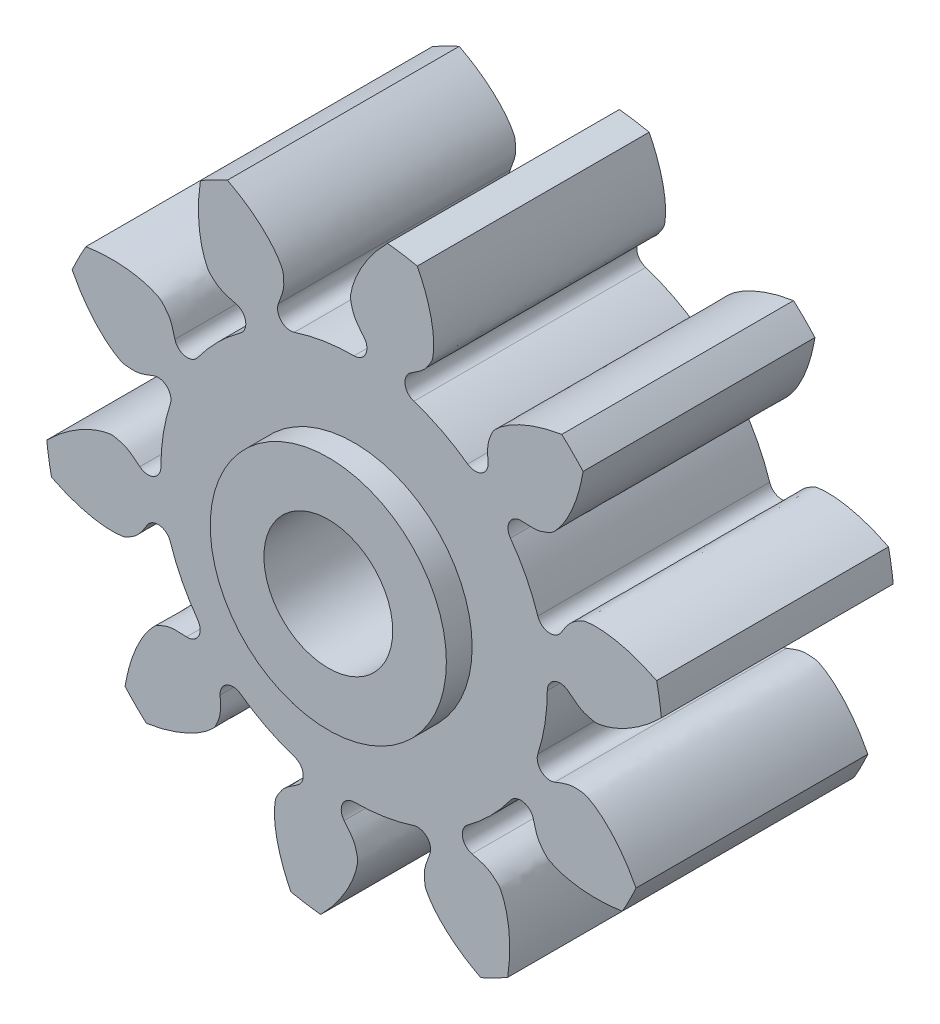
ISO-10303-21;
HEADER;
FILE_DESCRIPTION(('STEP AP214'),'2;1');
FILE_NAME('part.step','',(''),(''),'','','');
FILE_SCHEMA(('AUTOMOTIVE_DESIGN { 1 0 10303 214 1 1 1 1 }'));
ENDSEC;
DATA;
#1=APPLICATION_CONTEXT('core data for automotive mechanical design processes');
#2=APPLICATION_PROTOCOL_DEFINITION('international standard','automotive_design',2000,#1);
#3=PRODUCT_CONTEXT('',#1,'mechanical');
#4=PRODUCT('Part','Part','',(#3));
#5=PRODUCT_RELATED_PRODUCT_CATEGORY('part','',(#4));
#6=PRODUCT_DEFINITION_FORMATION('','',#4);
#7=PRODUCT_DEFINITION_CONTEXT('part definition',#1,'design');
#8=PRODUCT_DEFINITION('design','',#6,#7);
#9=PRODUCT_DEFINITION_SHAPE('','',#8);
#10=(LENGTH_UNIT() NAMED_UNIT(*) SI_UNIT(.MILLI.,.METRE.));
#11=(NAMED_UNIT(*) PLANE_ANGLE_UNIT() SI_UNIT($,.RADIAN.));
#12=(NAMED_UNIT(*) SI_UNIT($,.STERADIAN.) SOLID_ANGLE_UNIT());
#13=UNCERTAINTY_MEASURE_WITH_UNIT(LENGTH_MEASURE(1.E-05),#10,'distance_accuracy_value','');
#14=(GEOMETRIC_REPRESENTATION_CONTEXT(3) GLOBAL_UNCERTAINTY_ASSIGNED_CONTEXT((#13)) GLOBAL_UNIT_ASSIGNED_CONTEXT((#10,
#11,#12)) REPRESENTATION_CONTEXT('',''));
#15=CARTESIAN_POINT('',(0.,0.,0.));
#16=DIRECTION('',(0.,0.,1.));
#17=DIRECTION('',(1.,0.,0.));
#18=AXIS2_PLACEMENT_3D('',#15,#16,#17);
#19=CARTESIAN_POINT('',(0.,0.,2.7));
#20=DIRECTION('',(0.,0.,1.));
#21=DIRECTION('',(1.,0.,0.));
#22=AXIS2_PLACEMENT_3D('',#19,#20,#21);
#23=PLANE('',#22);
#24=CARTESIAN_POINT('',(1.78895364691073,-3.12404302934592,2.7));
#25=CARTESIAN_POINT('',(1.79699064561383,-3.06196223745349,2.7));
#26=CARTESIAN_POINT('',(1.81271346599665,-2.94051327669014,2.7));
#27=CARTESIAN_POINT('',(1.81477678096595,-2.76057899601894,2.7));
#28=CARTESIAN_POINT('',(1.80074993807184,-2.58942233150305,2.7));
#29=CARTESIAN_POINT('',(1.77463749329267,-2.46406615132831,2.7));
#30=CARTESIAN_POINT('',(1.74929301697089,-2.38178391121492,2.7));
#31=CARTESIAN_POINT('',(1.73296023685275,-2.33758096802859,2.7));
#32=CARTESIAN_POINT('',(1.71365565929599,-2.29560401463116,2.7));
#33=CARTESIAN_POINT('',(1.69248177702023,-2.25446042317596,2.7));
#34=CARTESIAN_POINT('',(1.65895168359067,-2.22252608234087,2.7));
#35=CARTESIAN_POINT('',(1.62398190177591,-2.19243856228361,2.7));
#36=CARTESIAN_POINT('',(1.49452086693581,-2.09222071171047,2.7));
#37=CARTESIAN_POINT('',(1.28101148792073,-2.09483964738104,2.7));
#38=CARTESIAN_POINT('',(1.1494102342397,-1.97988102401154,2.7));
#39=CARTESIAN_POINT('',(1.1180960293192,-1.9525268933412,2.7));
#40=B_SPLINE_CURVE_WITH_KNOTS('',3,(#24,#25,#26,#27,#28,#29,#30,#31,#32,#33,#34,#35,#36,#37,#38,
#39),.UNSPECIFIED.,.F.,.F.,(4,1,1,1,1,1,1,1,1,1,1,1,1,4),(0.,0.121390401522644,
0.237476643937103,0.348425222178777,0.454136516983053,0.485064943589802,0.515493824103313,
0.545436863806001,0.57490671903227,0.60437657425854,0.634319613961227,0.664748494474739,
0.92022770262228,1.),.UNSPECIFIED.);
#41=CARTESIAN_POINT('',(1.78895364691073,-3.12404302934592,2.7));
#42=VERTEX_POINT('',#41);
#43=CARTESIAN_POINT('',(1.37280784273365,-2.08653840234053,2.7));
#44=VERTEX_POINT('',#43);
#45=EDGE_CURVE('E1165',#42,#44,#40,.T.);
#46=ORIENTED_EDGE('',*,*,#45,.T.);
#47=CARTESIAN_POINT('',(1.41092887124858,-1.94146329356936,2.7));
#48=DIRECTION('',(0.,0.,1.));
#49=DIRECTION('',(1.,0.,0.));
#50=AXIS2_PLACEMENT_3D('',#47,#48,#49);
#51=CIRCLE('',#50,0.15);
#52=CARTESIAN_POINT('',(1.32274581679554,-1.82012183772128,2.7));
#53=VERTEX_POINT('',#52);
#54=EDGE_CURVE('E831',#44,#53,#51,.F.);
#55=ORIENTED_EDGE('',*,*,#54,.T.);
#56=CARTESIAN_POINT('',(0.,0.,2.7));
#57=DIRECTION('',(0.,0.,1.));
#58=DIRECTION('',(1.,0.,0.));
#59=AXIS2_PLACEMENT_3D('',#56,#57,#58);
#60=CIRCLE('',#59,2.25);
#61=CARTESIAN_POINT('',(1.81991114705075,-1.32303568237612,2.7));
#62=VERTEX_POINT('',#61);
#63=EDGE_CURVE('E1254',#53,#62,#60,.T.);
#64=ORIENTED_EDGE('',*,*,#63,.T.);
#65=CARTESIAN_POINT('',(1.94123855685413,-1.41123806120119,2.7));
#66=DIRECTION('',(0.,0.,1.));
#67=DIRECTION('',(1.,0.,0.));
#68=AXIS2_PLACEMENT_3D('',#65,#66,#67);
#69=CIRCLE('',#68,0.15);
#70=CARTESIAN_POINT('',(2.08631973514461,-1.37314013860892,2.7));
#71=VERTEX_POINT('',#70);
#72=EDGE_CURVE('E11',#62,#71,#69,.F.);
#73=ORIENTED_EDGE('',*,*,#72,.T.);
#74=CARTESIAN_POINT('',(1.95234879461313,-1.11840698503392,2.7));
#75=CARTESIAN_POINT('',(1.97969793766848,-1.14972554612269,2.7));
#76=CARTESIAN_POINT('',(2.09463560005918,-1.281345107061,2.7));
#77=CARTESIAN_POINT('',(2.09198265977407,-1.49485406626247,2.7));
#78=CARTESIAN_POINT('',(2.19217989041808,-1.62433106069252,2.7));
#79=CARTESIAN_POINT('',(2.22226184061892,-1.65930563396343,2.7));
#80=CARTESIAN_POINT('',(2.25419084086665,-1.69284081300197,2.7));
#81=CARTESIAN_POINT('',(2.2953310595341,-1.71402124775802,2.7));
#82=CARTESIAN_POINT('',(2.33730493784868,-1.73333251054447,2.7));
#83=CARTESIAN_POINT('',(2.38150527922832,-1.74967233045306,2.7));
#84=CARTESIAN_POINT('',(2.46378348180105,-1.77502991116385,2.7));
#85=CARTESIAN_POINT('',(2.58913550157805,-1.80116232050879,2.7));
#86=CARTESIAN_POINT('',(2.76028992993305,-1.81521642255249,2.7));
#87=CARTESIAN_POINT('',(2.94022453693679,-1.81318176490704,2.7));
#88=CARTESIAN_POINT('',(3.06167600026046,-1.79747828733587,2.7));
#89=CARTESIAN_POINT('',(3.12375807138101,-1.78945117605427,2.7));
#90=B_SPLINE_CURVE_WITH_KNOTS('',3,(#74,#75,#76,#77,#78,#79,#80,#81,#82,#83,#84,#85,#86,#87,#88,
#89),.UNSPECIFIED.,.F.,.F.,(4,1,1,1,1,1,1,1,1,1,1,1,1,4),(0.,0.0797722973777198,
0.335251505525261,0.365680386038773,0.39562342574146,0.42509328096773,0.454563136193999,
0.484506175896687,0.514935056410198,0.545863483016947,0.651574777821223,0.762523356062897,
0.878609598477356,1.),.UNSPECIFIED.);
#91=CARTESIAN_POINT('',(3.12375807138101,-1.78945117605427,2.7));
#92=VERTEX_POINT('',#91);
#93=EDGE_CURVE('E409',#71,#92,#90,.T.);
#94=ORIENTED_EDGE('',*,*,#93,.T.);
#95=CARTESIAN_POINT('',(0.,0.,2.7));
#96=DIRECTION('',(0.,0.,1.));
#97=DIRECTION('',(0.809016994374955,-0.587785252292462,0.));
#98=AXIS2_PLACEMENT_3D('',#95,#96,#97);
#99=CIRCLE('',#98,3.6);
#100=CARTESIAN_POINT('',(3.28356032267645,-1.47588333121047,2.7));
#101=VERTEX_POINT('',#100);
#102=EDGE_CURVE('E414',#92,#101,#99,.T.);
#103=ORIENTED_EDGE('',*,*,#102,.T.);
#104=CARTESIAN_POINT('',(3.28356032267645,-1.47588333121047,2.7));
#105=CARTESIAN_POINT('',(3.25357221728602,-1.42093488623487,2.7));
#106=CARTESIAN_POINT('',(3.19490633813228,-1.31343897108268,2.7));
#107=CARTESIAN_POINT('',(3.09081287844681,-1.16665629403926,2.7));
#108=CARTESIAN_POINT('',(2.97886156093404,-1.03643241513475,2.7));
#109=CARTESIAN_POINT('',(2.88405363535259,-0.950365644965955,2.7));
#110=CARTESIAN_POINT('',(2.81518523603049,-0.898695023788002,2.7));
#111=CARTESIAN_POINT('',(2.77598990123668,-0.872534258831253,2.7));
#112=CARTESIAN_POINT('',(2.73569873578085,-0.849921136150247,2.7));
#113=CARTESIAN_POINT('',(2.69438510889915,-0.829080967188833,2.7));
#114=CARTESIAN_POINT('',(2.64848815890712,-0.822954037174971,2.7));
#115=CARTESIAN_POINT('',(2.60251201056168,-0.819167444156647,2.7));
#116=CARTESIAN_POINT('',(2.43886925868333,-0.814184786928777,2.7));
#117=CARTESIAN_POINT('',(2.26767591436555,-0.941801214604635,2.7));
#118=CARTESIAN_POINT('',(2.09363728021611,-0.926151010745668,2.7));
#119=CARTESIAN_POINT('',(2.05222520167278,-0.922427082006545,2.7));
#120=B_SPLINE_CURVE_WITH_KNOTS('',3,(#104,#105,#106,#107,#108,#109,#110,#111,#112,#113,#114,
#115,#116,#117,#118,#119),.UNSPECIFIED.,.F.,.F.,(4,1,1,1,1,1,1,1,1,1,1,1,1,4),(0.,
0.121390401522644,0.237476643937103,0.348425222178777,0.454136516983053,0.485064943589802,
0.515493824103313,0.545436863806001,0.57490671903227,0.60437657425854,0.634319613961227,
0.664748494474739,0.92022770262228,1.),.UNSPECIFIED.);
#121=CARTESIAN_POINT('',(2.3370613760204,-0.881128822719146,2.7));
#122=VERTEX_POINT('',#121);
#123=EDGE_CURVE('E430',#101,#122,#120,.T.);
#124=ORIENTED_EDGE('',*,*,#123,.T.);
#125=CARTESIAN_POINT('',(2.28262892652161,-0.741353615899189,2.7));
#126=DIRECTION('',(0.,0.,1.));
#127=DIRECTION('',(1.,0.,0.));
#128=AXIS2_PLACEMENT_3D('',#125,#126,#127);
#129=CIRCLE('',#128,0.15);
#130=CARTESIAN_POINT('',(2.13996461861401,-0.69501901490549,2.7));
#131=VERTEX_POINT('',#130);
#132=EDGE_CURVE('E813',#122,#131,#129,.F.);
#133=ORIENTED_EDGE('',*,*,#132,.T.);
#134=CARTESIAN_POINT('',(2.24999990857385,-0.000641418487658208,2.7));
#135=VERTEX_POINT('',#134);
#136=EDGE_CURVE('E995',#131,#135,#60,.T.);
#137=ORIENTED_EDGE('',*,*,#136,.T.);
#138=CARTESIAN_POINT('',(2.39999990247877,-0.000684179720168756,2.7));
#139=DIRECTION('',(0.,0.,1.));
#140=DIRECTION('',(1.,0.,0.));
#141=AXIS2_PLACEMENT_3D('',#138,#139,#140);
#142=CIRCLE('',#141,0.15);
#143=CARTESIAN_POINT('',(2.494979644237,0.115414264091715,2.7));
#144=VERTEX_POINT('',#143);
#145=EDGE_CURVE('E971',#135,#144,#142,.F.);
#146=ORIENTED_EDGE('',*,*,#145,.T.);
#147=CARTESIAN_POINT('',(2.23686648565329,0.242751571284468,2.7));
#148=CARTESIAN_POINT('',(2.27740099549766,0.233489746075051,2.7));
#149=CARTESIAN_POINT('',(2.44775155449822,0.194565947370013,2.7));
#150=CARTESIAN_POINT('',(2.57110269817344,0.020274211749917,2.7));
#151=CARTESIAN_POINT('',(2.72826862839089,-0.0255804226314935,2.7));
#152=CARTESIAN_POINT('',(2.77316297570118,-0.0361937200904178,2.7));
#153=CARTESIAN_POINT('',(2.81870556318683,-0.0445568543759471,2.7));
#154=CARTESIAN_POINT('',(2.86443824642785,-0.0375105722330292,2.7));
#155=CARTESIAN_POINT('',(2.90974670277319,-0.0284620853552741,2.7));
#156=CARTESIAN_POINT('',(2.95510983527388,-0.0157009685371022,2.7));
#157=CARTESIAN_POINT('',(3.03657911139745,0.0121462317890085,2.7));
#158=CARTESIAN_POINT('',(3.1533512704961,0.0646847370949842,2.7));
#159=CARTESIAN_POINT('',(3.30007890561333,0.153916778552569,2.7));
#160=CARTESIAN_POINT('',(3.44445311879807,0.26132575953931,2.7));
#161=CARTESIAN_POINT('',(3.53347914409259,0.34541751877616,2.7));
#162=CARTESIAN_POINT('',(3.57898637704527,0.388402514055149,2.7));
#163=B_SPLINE_CURVE_WITH_KNOTS('',3,(#147,#148,#149,#150,#151,#152,#153,#154,#155,#156,#157,
#158,#159,#160,#161,#162),.UNSPECIFIED.,.F.,.F.,(4,1,1,1,1,1,1,1,1,1,1,1,1,4),(0.,
0.0797722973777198,0.335251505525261,0.365680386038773,0.39562342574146,0.42509328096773,
0.454563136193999,0.484506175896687,0.514935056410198,0.545863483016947,0.651574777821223,
0.762523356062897,0.878609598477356,1.),.UNSPECIFIED.);
#164=CARTESIAN_POINT('',(3.57898637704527,0.388402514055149,2.7));
#165=VERTEX_POINT('',#164);
#166=EDGE_CURVE('E698',#144,#165,#163,.T.);
#167=ORIENTED_EDGE('',*,*,#166,.T.);
#168=CARTESIAN_POINT('',(0.,0.,2.7));
#169=DIRECTION('',(0.,0.,1.));
#170=DIRECTION('',(1.,0.,0.));
#171=AXIS2_PLACEMENT_3D('',#168,#169,#170);
#172=CIRCLE('',#171,3.6);
#173=CARTESIAN_POINT('',(3.52395855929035,0.736013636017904,2.7));
#174=VERTEX_POINT('',#173);
#175=EDGE_CURVE('E703',#165,#174,#172,.T.);
#176=ORIENTED_EDGE('',*,*,#175,.T.);
#177=CARTESIAN_POINT('',(3.52395855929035,0.736013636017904,2.7));
#178=CARTESIAN_POINT('',(3.46739978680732,0.762841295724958,2.7));
#179=CARTESIAN_POINT('',(3.35675357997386,0.815324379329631,2.7));
#180=CARTESIAN_POINT('',(3.1862635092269,0.872889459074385,2.7));
#181=CARTESIAN_POINT('',(3.0191493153,0.912439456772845,2.7));
#182=CARTESIAN_POINT('',(2.89185931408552,0.926342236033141,2.7));
#183=CARTESIAN_POINT('',(2.80577237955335,0.927664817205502,2.7));
#184=CARTESIAN_POINT('',(2.75868577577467,0.925790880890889,2.7));
#185=CARTESIAN_POINT('',(2.71279787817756,0.920402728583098,2.7));
#186=CARTESIAN_POINT('',(2.66712490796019,0.912979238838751,2.7));
#187=CARTESIAN_POINT('',(2.62639217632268,0.890958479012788,2.7));
#188=CARTESIAN_POINT('',(2.58697098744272,0.866997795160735,2.7));
#189=CARTESIAN_POINT('',(2.45165248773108,0.774842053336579,2.7));
#190=CARTESIAN_POINT('',(2.38816521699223,0.570973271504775,2.7));
#191=CARTESIAN_POINT('',(2.23816604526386,0.481337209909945,2.7));
#192=CARTESIAN_POINT('',(2.20247409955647,0.46000852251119,2.7));
#193=B_SPLINE_CURVE_WITH_KNOTS('',3,(#177,#178,#179,#180,#181,#182,#183,#184,#185,#186,#187,
#188,#189,#190,#191,#192),.UNSPECIFIED.,.F.,.F.,(4,1,1,1,1,1,1,1,1,1,1,1,1,4),(0.,
0.121390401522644,0.237476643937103,0.348425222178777,0.454136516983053,0.485064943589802,
0.515493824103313,0.545436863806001,0.57490671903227,0.60437657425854,0.634319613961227,
0.664748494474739,0.92022770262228,1.),.UNSPECIFIED.);
#194=CARTESIAN_POINT('',(2.40863689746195,0.660842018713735,2.7));
#195=VERTEX_POINT('',#194);
#196=EDGE_CURVE('E1007',#174,#195,#193,.T.);
#197=ORIENTED_EDGE('',*,*,#196,.T.);
#198=CARTESIAN_POINT('',(2.28244231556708,0.74192794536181,2.7));
#199=DIRECTION('',(0.,0.,1.));
#200=DIRECTION('',(1.,0.,0.));
#201=AXIS2_PLACEMENT_3D('',#198,#199,#200);
#202=CIRCLE('',#201,0.15);
#203=CARTESIAN_POINT('',(2.13978967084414,0.695557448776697,2.7));
#204=VERTEX_POINT('',#203);
#205=EDGE_CURVE('E976',#195,#204,#202,.F.);
#206=ORIENTED_EDGE('',*,*,#205,.T.);
#207=CARTESIAN_POINT('',(1.82066517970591,1.3219978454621,2.7));
#208=VERTEX_POINT('',#207);
#209=EDGE_CURVE('E991',#204,#208,#60,.T.);
#210=ORIENTED_EDGE('',*,*,#209,.T.);
#211=CARTESIAN_POINT('',(1.94204285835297,1.41013103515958,2.7));
#212=DIRECTION('',(0.,0.,1.));
#213=DIRECTION('',(1.,0.,0.));
#214=AXIS2_PLACEMENT_3D('',#211,#212,#213);
#215=CIRCLE('',#214,0.15);
#216=CARTESIAN_POINT('',(1.95064213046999,1.55988434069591,2.7));
#217=VERTEX_POINT('',#216);
#218=EDGE_CURVE('E953',#208,#217,#215,.F.);
#219=ORIENTED_EDGE('',*,*,#218,.T.);
#220=CARTESIAN_POINT('',(1.66697720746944,1.51118727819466,2.7));
#221=CARTESIAN_POINT('',(1.7052142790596,1.52751989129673,2.7));
#222=CARTESIAN_POINT('',(1.86590961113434,1.59615942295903,2.7));
#223=CARTESIAN_POINT('',(2.06814889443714,1.52765842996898,2.7));
#224=CARTESIAN_POINT('',(2.22225148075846,1.58294106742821,2.7));
#225=CARTESIAN_POINT('',(2.2648101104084,1.60074296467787,2.7));
#226=CARTESIAN_POINT('',(2.30657056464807,1.62074630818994,2.7));
#227=CARTESIAN_POINT('',(2.33942738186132,1.65332786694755,2.7));
#228=CARTESIAN_POINT('',(2.3707641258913,1.68727988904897,2.7));
#229=CARTESIAN_POINT('',(2.39996287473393,1.72426762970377,2.7));
#230=CARTESIAN_POINT('',(2.44950472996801,1.79468292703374,2.7));
#231=CARTESIAN_POINT('',(2.51309403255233,1.90582442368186,2.7));
#232=CARTESIAN_POINT('',(2.57934990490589,2.06425900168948,2.7));
#233=CARTESIAN_POINT('',(2.63301768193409,2.23601572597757,2.7));
#234=CARTESIAN_POINT('',(2.65561335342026,2.3563755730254,2.7));
#235=CARTESIAN_POINT('',(2.66716353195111,2.41789964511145,2.7));
#236=B_SPLINE_CURVE_WITH_KNOTS('',3,(#220,#221,#222,#223,#224,#225,#226,#227,#228,#229,#230,
#231,#232,#233,#234,#235),.UNSPECIFIED.,.F.,.F.,(4,1,1,1,1,1,1,1,1,1,1,1,1,4),(0.,
0.0797722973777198,0.335251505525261,0.365680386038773,0.39562342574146,0.42509328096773,
0.454563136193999,0.484506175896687,0.514935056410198,0.545863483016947,0.651574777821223,
0.762523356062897,0.878609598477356,1.),.UNSPECIFIED.);
#237=CARTESIAN_POINT('',(2.66716353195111,2.41789964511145,2.7));
#238=VERTEX_POINT('',#237);
#239=EDGE_CURVE('E688',#217,#238,#236,.T.);
#240=ORIENTED_EDGE('',*,*,#239,.T.);
#241=CARTESIAN_POINT('',(0.,0.,2.7));
#242=DIRECTION('',(0.,0.,1.));
#243=DIRECTION('',(0.809016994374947,0.587785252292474,0.));
#244=AXIS2_PLACEMENT_3D('',#241,#242,#243);
#245=CIRCLE('',#244,3.6);
#246=CARTESIAN_POINT('',(2.41832440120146,2.66677841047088,2.7));
#247=VERTEX_POINT('',#246);
#248=EDGE_CURVE('E668',#238,#247,#245,.T.);
#249=ORIENTED_EDGE('',*,*,#248,.T.);
#250=CARTESIAN_POINT('',(2.41832440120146,2.66677841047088,2.7));
#251=CARTESIAN_POINT('',(2.35679849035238,2.65523803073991,2.7));
#252=CARTESIAN_POINT('',(2.23643504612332,2.63266152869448,2.7));
#253=CARTESIAN_POINT('',(2.06466977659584,2.57902110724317,2.7));
#254=CARTESIAN_POINT('',(1.90622464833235,2.51279046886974,2.7));
#255=CARTESIAN_POINT('',(1.79507302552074,2.4492188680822,2.7));
#256=CARTESIAN_POINT('',(1.72464983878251,2.399688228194,2.7));
#257=CARTESIAN_POINT('',(1.68765744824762,2.37049537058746,2.7));
#258=CARTESIAN_POINT('',(1.65370043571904,2.33916403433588,2.7));
#259=CARTESIAN_POINT('',(1.62111364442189,2.30631240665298,2.7));
#260=CARTESIAN_POINT('',(1.6011036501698,2.26455513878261,2.7));
#261=CARTESIAN_POINT('',(1.58329497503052,2.22199934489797,2.7));
#262=CARTESIAN_POINT('',(1.5279877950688,2.06790556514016,2.7));
#263=CARTESIAN_POINT('',(1.59645657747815,1.86565537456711,2.7));
#264=CARTESIAN_POINT('',(1.52779145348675,1.70497097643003,2.7));
#265=CARTESIAN_POINT('',(1.51145275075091,1.6667365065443,2.7));
#266=B_SPLINE_CURVE_WITH_KNOTS('',3,(#250,#251,#252,#253,#254,#255,#256,#257,#258,#259,#260,
#261,#262,#263,#264,#265),.UNSPECIFIED.,.F.,.F.,(4,1,1,1,1,1,1,1,1,1,1,1,1,4),(0.,
0.121390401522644,0.237476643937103,0.348425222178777,0.454136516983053,0.485064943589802,
0.515493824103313,0.545436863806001,0.57490671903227,0.60437657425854,0.634319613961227,
0.664748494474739,0.92022770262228,1.),.UNSPECIFIED.);
#267=CARTESIAN_POINT('',(1.56019499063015,1.95039367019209,2.7));
#268=VERTEX_POINT('',#267);
#269=EDGE_CURVE('E660',#247,#268,#266,.T.);
#270=ORIENTED_EDGE('',*,*,#269,.T.);
#271=CARTESIAN_POINT('',(1.41044031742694,1.941818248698,2.7));
#272=DIRECTION('',(0.,0.,1.));
#273=DIRECTION('',(1.,0.,0.));
#274=AXIS2_PLACEMENT_3D('',#271,#272,#273);
#275=CIRCLE('',#274,0.15);
#276=CARTESIAN_POINT('',(1.32228779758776,1.82045460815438,2.7));
#277=VERTEX_POINT('',#276);
#278=EDGE_CURVE('E957',#268,#277,#275,.F.);
#279=ORIENTED_EDGE('',*,*,#278,.T.);
#280=CARTESIAN_POINT('',(0.69589823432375,2.13967886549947,2.7));
#281=VERTEX_POINT('',#280);
#282=EDGE_CURVE('E1000',#277,#281,#60,.T.);
#283=ORIENTED_EDGE('',*,*,#282,.T.);
#284=CARTESIAN_POINT('',(0.742291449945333,2.28232412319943,2.7));
#285=DIRECTION('',(0.,0.,1.));
#286=DIRECTION('',(1.,0.,0.));
#287=AXIS2_PLACEMENT_3D('',#284,#285,#286);
#288=CIRCLE('',#287,0.15);
#289=CARTESIAN_POINT('',(0.661225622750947,2.40853161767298,2.7));
#290=VERTEX_POINT('',#289);
#291=EDGE_CURVE('E935',#281,#290,#288,.F.);
#292=ORIENTED_EDGE('',*,*,#291,.T.);
#293=CARTESIAN_POINT('',(0.460359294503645,2.20240080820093,2.7));
#294=CARTESIAN_POINT('',(0.481693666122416,2.23808935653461,2.7));
#295=CARTESIAN_POINT('',(0.571353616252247,2.38807425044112,2.7));
#296=CARTESIAN_POINT('',(0.775232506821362,2.45152905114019,2.7));
#297=CARTESIAN_POINT('',(0.867409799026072,2.58683287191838,2.7));
#298=CARTESIAN_POINT('',(0.891376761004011,2.62625024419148,2.7));
#299=CARTESIAN_POINT('',(0.913404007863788,2.66697946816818,2.7));
#300=CARTESIAN_POINT('',(0.920834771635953,2.71265125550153,2.7));
#301=CARTESIAN_POINT('',(0.926230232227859,2.75853829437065,2.7));
#302=CARTESIAN_POINT('',(0.928111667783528,2.80562459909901,2.7));
#303=CARTESIAN_POINT('',(0.926802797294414,2.89171174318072,2.7));
#304=CARTESIAN_POINT('',(0.912920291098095,3.01900395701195,2.7));
#305=CARTESIAN_POINT('',(0.873396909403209,3.18612444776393,2.7));
#306=CARTESIAN_POINT('',(0.815858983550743,3.35662368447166,2.7));
#307=CARTESIAN_POINT('',(0.763393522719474,3.46727824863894,2.7));
#308=CARTESIAN_POINT('',(0.736574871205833,3.52384129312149,2.7));
#309=B_SPLINE_CURVE_WITH_KNOTS('',3,(#293,#294,#295,#296,#297,#298,#299,#300,#301,#302,#303,
#304,#305,#306,#307,#308),.UNSPECIFIED.,.F.,.F.,(4,1,1,1,1,1,1,1,1,1,1,1,1,4),(0.,
0.0797722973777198,0.335251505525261,0.365680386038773,0.39562342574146,0.42509328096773,
0.454563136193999,0.484506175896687,0.514935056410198,0.545863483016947,0.651574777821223,
0.762523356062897,0.878609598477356,1.),.UNSPECIFIED.);
#310=CARTESIAN_POINT('',(0.736574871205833,3.52384129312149,2.7));
#311=VERTEX_POINT('',#310);
#312=EDGE_CURVE('E634',#290,#311,#309,.T.);
#313=ORIENTED_EDGE('',*,*,#312,.T.);
#314=CARTESIAN_POINT('',(0.,0.,2.7));
#315=DIRECTION('',(0.,0.,1.));
#316=DIRECTION('',(0.309016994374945,0.951056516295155,0.));
#317=AXIS2_PLACEMENT_3D('',#314,#315,#316);
#318=CIRCLE('',#317,3.6);
#319=CARTESIAN_POINT('',(0.388972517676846,3.5789244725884,2.7));
#320=VERTEX_POINT('',#319);
#321=EDGE_CURVE('E639',#311,#320,#318,.T.);
#322=ORIENTED_EDGE('',*,*,#321,.T.);
#323=CARTESIAN_POINT('',(0.388972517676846,3.5789244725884,2.7));
#324=CARTESIAN_POINT('',(0.345980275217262,3.53342408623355,2.7));
#325=CARTESIAN_POINT('',(0.261874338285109,3.44441145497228,2.7));
#326=CARTESIAN_POINT('',(0.154442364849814,3.30005435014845,2.7));
#327=CARTESIAN_POINT('',(0.0651869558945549,3.15334092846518,2.7));
#328=CARTESIAN_POINT('',(0.0126298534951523,3.03657713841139,2.7));
#329=CARTESIAN_POINT('',(-0.0152303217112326,2.9551122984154,2.7));
#330=CARTESIAN_POINT('',(-0.02799866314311,2.90975119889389,2.7));
#331=CARTESIAN_POINT('',(-0.0370543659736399,2.86444418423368,2.7));
#332=CARTESIAN_POINT('',(-0.044107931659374,2.81871262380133,2.7));
#333=CARTESIAN_POINT('',(-0.0357520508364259,2.77316870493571,2.7));
#334=CARTESIAN_POINT('',(-0.0251459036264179,2.72827266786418,2.7));
#335=CARTESIAN_POINT('',(0.020683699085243,2.57109943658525,2.7));
#336=CARTESIAN_POINT('',(0.194955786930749,2.44772053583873,2.7));
#337=CARTESIAN_POINT('',(0.233852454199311,2.27736377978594,2.7));
#338=CARTESIAN_POINT('',(0.243107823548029,2.23682779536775,2.7));
#339=B_SPLINE_CURVE_WITH_KNOTS('',3,(#323,#324,#325,#326,#327,#328,#329,#330,#331,#332,#333,
#334,#335,#336,#337,#338),.UNSPECIFIED.,.F.,.F.,(4,1,1,1,1,1,1,1,1,1,1,1,1,4),(0.,
0.121390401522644,0.237476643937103,0.348425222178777,0.454136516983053,0.485064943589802,
0.515493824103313,0.545436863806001,0.57490671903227,0.60437657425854,0.634319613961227,
0.664748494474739,0.92022770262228,1.),.UNSPECIFIED.);
#340=CARTESIAN_POINT('',(0.115811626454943,2.49496123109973,2.7));
#341=VERTEX_POINT('',#340);
#342=EDGE_CURVE('E1045',#320,#341,#339,.T.);
#343=ORIENTED_EDGE('',*,*,#342,.T.);
#344=CARTESIAN_POINT('',(-0.000301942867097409,2.39999998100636,2.7));
#345=DIRECTION('',(0.,0.,1.));
#346=DIRECTION('',(1.,0.,0.));
#347=AXIS2_PLACEMENT_3D('',#344,#345,#346);
#348=CIRCLE('',#347,0.15);
#349=CARTESIAN_POINT('',(-0.000283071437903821,2.24999998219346,2.7));
#350=VERTEX_POINT('',#349);
#351=EDGE_CURVE('E939',#341,#350,#348,.F.);
#352=ORIENTED_EDGE('',*,*,#351,.T.);
#353=CARTESIAN_POINT('',(-0.694678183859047,2.14007528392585,2.7));
#354=VERTEX_POINT('',#353);
#355=EDGE_CURVE('E1273',#350,#354,#60,.T.);
#356=ORIENTED_EDGE('',*,*,#355,.T.);
#357=CARTESIAN_POINT('',(-0.740990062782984,2.2827469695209,2.7));
#358=DIRECTION('',(0.,0.,1.));
#359=DIRECTION('',(1.,0.,0.));
#360=AXIS2_PLACEMENT_3D('',#357,#358,#359);
#361=CIRCLE('',#360,0.15);
#362=CARTESIAN_POINT('',(-0.880756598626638,2.33720167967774,2.7));
#363=VERTEX_POINT('',#362);
#364=EDGE_CURVE('E917',#354,#363,#361,.F.);
#365=ORIENTED_EDGE('',*,*,#364,.T.);
#366=CARTESIAN_POINT('',(-0.922100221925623,2.05237208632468,2.7));
#367=CARTESIAN_POINT('',(-0.925817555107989,2.09378475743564,2.7));
#368=CARTESIAN_POINT('',(-0.941440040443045,2.26782588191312,2.7));
#369=CARTESIAN_POINT('',(-0.813796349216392,2.43899889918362,2.7));
#370=CARTESIAN_POINT('',(-0.818752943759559,2.60264244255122,2.7));
#371=CARTESIAN_POINT('',(-0.82253221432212,2.64861919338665,2.7));
#372=CARTESIAN_POINT('',(-0.82865183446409,2.69451711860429,2.7));
#373=CARTESIAN_POINT('',(-0.849485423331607,2.735834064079,2.7));
#374=CARTESIAN_POINT('',(-0.872092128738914,2.77612883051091,2.7));
#375=CARTESIAN_POINT('',(-0.898246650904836,2.81532833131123,2.7));
#376=CARTESIAN_POINT('',(-0.94990630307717,2.88420495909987,2.7));
#377=CARTESIAN_POINT('',(-1.03595797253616,2.97902659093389,2.7));
#378=CARTESIAN_POINT('',(-1.16616401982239,3.09099864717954,2.7));
#379=CARTESIAN_POINT('',(-1.31293011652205,3.19511548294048,2.7));
#380=CARTESIAN_POINT('',(-1.42041668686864,3.25379848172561,2.7));
#381=CARTESIAN_POINT('',(-1.475360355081,3.28379533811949,2.7));
#382=B_SPLINE_CURVE_WITH_KNOTS('',3,(#366,#367,#368,#369,#370,#371,#372,#373,#374,#375,#376,
#377,#378,#379,#380,#381),.UNSPECIFIED.,.F.,.F.,(4,1,1,1,1,1,1,1,1,1,1,1,1,4),(0.,
0.0797722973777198,0.335251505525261,0.365680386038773,0.39562342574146,0.42509328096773,
0.454563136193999,0.484506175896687,0.514935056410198,0.545863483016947,0.651574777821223,
0.762523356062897,0.878609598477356,1.),.UNSPECIFIED.);
#383=CARTESIAN_POINT('',(-1.475360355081,3.28379533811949,2.7));
#384=VERTEX_POINT('',#383);
#385=EDGE_CURVE('E624',#363,#384,#382,.T.);
#386=ORIENTED_EDGE('',*,*,#385,.T.);
#387=CARTESIAN_POINT('',(0.,0.,2.7));
#388=DIRECTION('',(0.,0.,1.));
#389=DIRECTION('',(-0.309016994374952,0.951056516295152,0.));
#390=AXIS2_PLACEMENT_3D('',#387,#388,#389);
#391=CIRCLE('',#390,3.6);
#392=CARTESIAN_POINT('',(-1.7889536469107,3.12404302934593,2.7));
#393=VERTEX_POINT('',#392);
#394=EDGE_CURVE('E604',#384,#393,#391,.T.);
#395=ORIENTED_EDGE('',*,*,#394,.T.);
#396=CARTESIAN_POINT('',(-1.7889536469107,3.12404302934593,2.7));
#397=CARTESIAN_POINT('',(-1.7969906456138,3.0619622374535,2.7));
#398=CARTESIAN_POINT('',(-1.81271346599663,2.94051327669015,2.7));
#399=CARTESIAN_POINT('',(-1.81477678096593,2.76057899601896,2.7));
#400=CARTESIAN_POINT('',(-1.80074993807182,2.58942233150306,2.7));
#401=CARTESIAN_POINT('',(-1.77463749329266,2.46406615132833,2.7));
#402=CARTESIAN_POINT('',(-1.74929301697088,2.38178391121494,2.7));
#403=CARTESIAN_POINT('',(-1.73296023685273,2.33758096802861,2.7));
#404=CARTESIAN_POINT('',(-1.71365565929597,2.29560401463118,2.7));
#405=CARTESIAN_POINT('',(-1.69248177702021,2.25446042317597,2.7));
#406=CARTESIAN_POINT('',(-1.65895168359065,2.22252608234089,2.7));
#407=CARTESIAN_POINT('',(-1.6239819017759,2.19243856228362,2.7));
#408=CARTESIAN_POINT('',(-1.4945208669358,2.09222071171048,2.7));
#409=CARTESIAN_POINT('',(-1.28101148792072,2.09483964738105,2.7));
#410=CARTESIAN_POINT('',(-1.14941023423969,1.97988102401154,2.7));
#411=CARTESIAN_POINT('',(-1.11809602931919,1.95252689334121,2.7));
#412=B_SPLINE_CURVE_WITH_KNOTS('',3,(#396,#397,#398,#399,#400,#401,#402,#403,#404,#405,#406,
#407,#408,#409,#410,#411),.UNSPECIFIED.,.F.,.F.,(4,1,1,1,1,1,1,1,1,1,1,1,1,4),(0.,
0.121390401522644,0.237476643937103,0.348425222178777,0.454136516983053,0.485064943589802,
0.515493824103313,0.545436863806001,0.57490671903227,0.60437657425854,0.634319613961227,
0.664748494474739,0.92022770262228,1.),.UNSPECIFIED.);
#413=CARTESIAN_POINT('',(-1.37280784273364,2.08653840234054,2.7));
#414=VERTEX_POINT('',#413);
#415=EDGE_CURVE('E596',#393,#414,#412,.T.);
#416=ORIENTED_EDGE('',*,*,#415,.T.);
#417=CARTESIAN_POINT('',(-1.41092887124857,1.94146329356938,2.7));
#418=DIRECTION('',(0.,0.,1.));
#419=DIRECTION('',(1.,0.,0.));
#420=AXIS2_PLACEMENT_3D('',#417,#418,#419);
#421=CIRCLE('',#420,0.15);
#422=CARTESIAN_POINT('',(-1.32274581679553,1.82012183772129,2.7));
#423=VERTEX_POINT('',#422);
#424=EDGE_CURVE('E921',#414,#423,#421,.F.);
#425=ORIENTED_EDGE('',*,*,#424,.T.);
#426=CARTESIAN_POINT('',(-1.81991114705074,1.32303568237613,2.7));
#427=VERTEX_POINT('',#426);
#428=EDGE_CURVE('E1269',#423,#427,#60,.T.);
#429=ORIENTED_EDGE('',*,*,#428,.T.);
#430=CARTESIAN_POINT('',(-1.94123855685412,1.41123806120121,2.7));
#431=DIRECTION('',(0.,0.,1.));
#432=DIRECTION('',(1.,0.,0.));
#433=AXIS2_PLACEMENT_3D('',#430,#431,#432);
#434=CIRCLE('',#433,0.15);
#435=CARTESIAN_POINT('',(-2.0863197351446,1.37314013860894,2.7));
#436=VERTEX_POINT('',#435);
#437=EDGE_CURVE('E899',#427,#436,#434,.F.);
#438=ORIENTED_EDGE('',*,*,#437,.T.);
#439=CARTESIAN_POINT('',(-1.95234879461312,1.11840698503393,2.7));
#440=CARTESIAN_POINT('',(-1.97969793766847,1.1497255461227,2.7));
#441=CARTESIAN_POINT('',(-2.09463560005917,1.28134510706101,2.7));
#442=CARTESIAN_POINT('',(-2.09198265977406,1.49485406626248,2.7));
#443=CARTESIAN_POINT('',(-2.19217989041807,1.62433106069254,2.7));
#444=CARTESIAN_POINT('',(-2.22226184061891,1.65930563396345,2.7));
#445=CARTESIAN_POINT('',(-2.25419084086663,1.69284081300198,2.7));
#446=CARTESIAN_POINT('',(-2.29533105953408,1.71402124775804,2.7));
#447=CARTESIAN_POINT('',(-2.33730493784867,1.73333251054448,2.7));
#448=CARTESIAN_POINT('',(-2.38150527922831,1.74967233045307,2.7));
#449=CARTESIAN_POINT('',(-2.46378348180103,1.77502991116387,2.7));
#450=CARTESIAN_POINT('',(-2.58913550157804,1.80116232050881,2.7));
#451=CARTESIAN_POINT('',(-2.76028992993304,1.81521642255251,2.7));
#452=CARTESIAN_POINT('',(-2.94022453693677,1.81318176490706,2.7));
#453=CARTESIAN_POINT('',(-3.06167600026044,1.7974782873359,2.7));
#454=CARTESIAN_POINT('',(-3.123758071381,1.78945117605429,2.7));
#455=B_SPLINE_CURVE_WITH_KNOTS('',3,(#439,#440,#441,#442,#443,#444,#445,#446,#447,#448,#449,
#450,#451,#452,#453,#454),.UNSPECIFIED.,.F.,.F.,(4,1,1,1,1,1,1,1,1,1,1,1,1,4),(0.,
0.0797722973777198,0.335251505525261,0.365680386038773,0.39562342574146,0.42509328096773,
0.454563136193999,0.484506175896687,0.514935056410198,0.545863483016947,0.651574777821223,
0.762523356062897,0.878609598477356,1.),.UNSPECIFIED.);
#456=CARTESIAN_POINT('',(-3.123758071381,1.78945117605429,2.7));
#457=VERTEX_POINT('',#456);
#458=EDGE_CURVE('E570',#436,#457,#455,.T.);
#459=ORIENTED_EDGE('',*,*,#458,.T.);
#460=CARTESIAN_POINT('',(0.,0.,2.7));
#461=DIRECTION('',(0.,0.,1.));
#462=DIRECTION('',(-0.809016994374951,0.587785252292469,0.));
#463=AXIS2_PLACEMENT_3D('',#460,#461,#462);
#464=CIRCLE('',#463,3.6);
#465=CARTESIAN_POINT('',(-3.28356032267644,1.4758833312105,2.7));
#466=VERTEX_POINT('',#465);
#467=EDGE_CURVE('E575',#457,#466,#464,.T.);
#468=ORIENTED_EDGE('',*,*,#467,.T.);
#469=CARTESIAN_POINT('',(-3.28356032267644,1.4758833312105,2.7));
#470=CARTESIAN_POINT('',(-3.25357221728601,1.42093488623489,2.7));
#471=CARTESIAN_POINT('',(-3.19490633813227,1.3134389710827,2.7));
#472=CARTESIAN_POINT('',(-3.0908128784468,1.16665629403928,2.7));
#473=CARTESIAN_POINT('',(-2.97886156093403,1.03643241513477,2.7));
#474=CARTESIAN_POINT('',(-2.88405363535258,0.950365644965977,2.7));
#475=CARTESIAN_POINT('',(-2.81518523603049,0.898695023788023,2.7));
#476=CARTESIAN_POINT('',(-2.77598990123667,0.872534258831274,2.7));
#477=CARTESIAN_POINT('',(-2.73569873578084,0.849921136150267,2.7));
#478=CARTESIAN_POINT('',(-2.69438510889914,0.829080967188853,2.7));
#479=CARTESIAN_POINT('',(-2.64848815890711,0.822954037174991,2.7));
#480=CARTESIAN_POINT('',(-2.60251201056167,0.819167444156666,2.7));
#481=CARTESIAN_POINT('',(-2.43886925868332,0.814184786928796,2.7));
#482=CARTESIAN_POINT('',(-2.26767591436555,0.941801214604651,2.7));
#483=CARTESIAN_POINT('',(-2.0936372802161,0.926151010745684,2.7));
#484=CARTESIAN_POINT('',(-2.05222520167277,0.922427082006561,2.7));
#485=B_SPLINE_CURVE_WITH_KNOTS('',3,(#469,#470,#471,#472,#473,#474,#475,#476,#477,#478,#479,
#480,#481,#482,#483,#484),.UNSPECIFIED.,.F.,.F.,(4,1,1,1,1,1,1,1,1,1,1,1,1,4),(0.,
0.121390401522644,0.237476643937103,0.348425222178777,0.454136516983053,0.485064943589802,
0.515493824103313,0.545436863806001,0.57490671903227,0.60437657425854,0.634319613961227,
0.664748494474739,0.92022770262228,1.),.UNSPECIFIED.);
#486=CARTESIAN_POINT('',(-2.33706137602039,0.881128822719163,2.7));
#487=VERTEX_POINT('',#486);
#488=EDGE_CURVE('E1085',#466,#487,#485,.T.);
#489=ORIENTED_EDGE('',*,*,#488,.T.);
#490=CARTESIAN_POINT('',(-2.2826289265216,0.741353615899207,2.7));
#491=DIRECTION('',(0.,0.,1.));
#492=DIRECTION('',(1.,0.,0.));
#493=AXIS2_PLACEMENT_3D('',#490,#491,#492);
#494=CIRCLE('',#493,0.15);
#495=CARTESIAN_POINT('',(-2.139964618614,0.695019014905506,2.7));
#496=VERTEX_POINT('',#495);
#497=EDGE_CURVE('E903',#487,#496,#494,.F.);
#498=ORIENTED_EDGE('',*,*,#497,.T.);
#499=CARTESIAN_POINT('',(-2.24999990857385,0.000641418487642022,2.7));
#500=VERTEX_POINT('',#499);
#501=EDGE_CURVE('E1265',#496,#500,#60,.T.);
#502=ORIENTED_EDGE('',*,*,#501,.T.);
#503=CARTESIAN_POINT('',(-2.39999990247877,0.00068417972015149,2.7));
#504=DIRECTION('',(0.,0.,1.));
#505=DIRECTION('',(1.,0.,0.));
#506=AXIS2_PLACEMENT_3D('',#503,#504,#505);
#507=CIRCLE('',#506,0.15);
#508=CARTESIAN_POINT('',(-2.49497964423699,-0.115414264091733,2.7));
#509=VERTEX_POINT('',#508);
#510=EDGE_CURVE('E881',#500,#509,#507,.F.);
#511=ORIENTED_EDGE('',*,*,#510,.T.);
#512=CARTESIAN_POINT('',(-2.23686648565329,-0.242751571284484,2.7));
#513=CARTESIAN_POINT('',(-2.27740099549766,-0.233489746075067,2.7));
#514=CARTESIAN_POINT('',(-2.44775155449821,-0.19456594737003,2.7));
#515=CARTESIAN_POINT('',(-2.57110269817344,-0.020274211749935,2.7));
#516=CARTESIAN_POINT('',(-2.72826862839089,0.0255804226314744,2.7));
#517=CARTESIAN_POINT('',(-2.77316297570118,0.0361937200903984,2.7));
#518=CARTESIAN_POINT('',(-2.81870556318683,0.0445568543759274,2.7));
#519=CARTESIAN_POINT('',(-2.86443824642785,0.0375105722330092,2.7));
#520=CARTESIAN_POINT('',(-2.90974670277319,0.0284620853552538,2.7));
#521=CARTESIAN_POINT('',(-2.95510983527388,0.0157009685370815,2.7));
#522=CARTESIAN_POINT('',(-3.03657911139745,-0.0121462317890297,2.7));
#523=CARTESIAN_POINT('',(-3.1533512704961,-0.0646847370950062,2.7));
#524=CARTESIAN_POINT('',(-3.30007890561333,-0.153916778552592,2.7));
#525=CARTESIAN_POINT('',(-3.44445311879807,-0.261325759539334,2.7));
#526=CARTESIAN_POINT('',(-3.53347914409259,-0.345417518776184,2.7));
#527=CARTESIAN_POINT('',(-3.57898637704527,-0.388402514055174,2.7));
#528=B_SPLINE_CURVE_WITH_KNOTS('',3,(#512,#513,#514,#515,#516,#517,#518,#519,#520,#521,#522,
#523,#524,#525,#526,#527),.UNSPECIFIED.,.F.,.F.,(4,1,1,1,1,1,1,1,1,1,1,1,1,4),(0.,
0.0797722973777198,0.335251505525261,0.365680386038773,0.39562342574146,0.42509328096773,
0.454563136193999,0.484506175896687,0.514935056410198,0.545863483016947,0.651574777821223,
0.762523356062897,0.878609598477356,1.),.UNSPECIFIED.);
#529=CARTESIAN_POINT('',(-3.57898637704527,-0.388402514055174,2.7));
#530=VERTEX_POINT('',#529);
#531=EDGE_CURVE('E560',#509,#530,#528,.T.);
#532=ORIENTED_EDGE('',*,*,#531,.T.);
#533=CARTESIAN_POINT('',(0.,0.,2.7));
#534=DIRECTION('',(0.,0.,1.));
#535=DIRECTION('',(-1.,0.,0.));
#536=AXIS2_PLACEMENT_3D('',#533,#534,#535);
#537=CIRCLE('',#536,3.6);
#538=CARTESIAN_POINT('',(-3.52395855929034,-0.736013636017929,2.7));
#539=VERTEX_POINT('',#538);
#540=EDGE_CURVE('E540',#530,#539,#537,.T.);
#541=ORIENTED_EDGE('',*,*,#540,.T.);
#542=CARTESIAN_POINT('',(-3.52395855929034,-0.736013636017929,2.7));
#543=CARTESIAN_POINT('',(-3.46739978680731,-0.762841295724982,2.7));
#544=CARTESIAN_POINT('',(-3.35675357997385,-0.815324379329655,2.7));
#545=CARTESIAN_POINT('',(-3.18626350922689,-0.872889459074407,2.7));
#546=CARTESIAN_POINT('',(-3.0191493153,-0.912439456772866,2.7));
#547=CARTESIAN_POINT('',(-2.89185931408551,-0.926342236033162,2.7));
#548=CARTESIAN_POINT('',(-2.80577237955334,-0.927664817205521,2.7));
#549=CARTESIAN_POINT('',(-2.75868577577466,-0.925790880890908,2.7));
#550=CARTESIAN_POINT('',(-2.71279787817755,-0.920402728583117,2.7));
#551=CARTESIAN_POINT('',(-2.66712490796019,-0.912979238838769,2.7));
#552=CARTESIAN_POINT('',(-2.62639217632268,-0.890958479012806,2.7));
#553=CARTESIAN_POINT('',(-2.58697098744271,-0.866997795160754,2.7));
#554=CARTESIAN_POINT('',(-2.45165248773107,-0.774842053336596,2.7));
#555=CARTESIAN_POINT('',(-2.38816521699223,-0.570973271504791,2.7));
#556=CARTESIAN_POINT('',(-2.23816604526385,-0.481337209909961,2.7));
#557=CARTESIAN_POINT('',(-2.20247409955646,-0.460008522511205,2.7));
#558=B_SPLINE_CURVE_WITH_KNOTS('',3,(#542,#543,#544,#545,#546,#547,#548,#549,#550,#551,#552,
#553,#554,#555,#556,#557),.UNSPECIFIED.,.F.,.F.,(4,1,1,1,1,1,1,1,1,1,1,1,1,4),(0.,
0.121390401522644,0.237476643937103,0.348425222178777,0.454136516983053,0.485064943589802,
0.515493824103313,0.545436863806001,0.57490671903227,0.60437657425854,0.634319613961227,
0.664748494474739,0.92022770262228,1.),.UNSPECIFIED.);
#559=CARTESIAN_POINT('',(-2.40863689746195,-0.660842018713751,2.7));
#560=VERTEX_POINT('',#559);
#561=EDGE_CURVE('E532',#539,#560,#558,.T.);
#562=ORIENTED_EDGE('',*,*,#561,.T.);
#563=CARTESIAN_POINT('',(-2.28244231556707,-0.741927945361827,2.7));
#564=DIRECTION('',(0.,0.,1.));
#565=DIRECTION('',(1.,0.,0.));
#566=AXIS2_PLACEMENT_3D('',#563,#564,#565);
#567=CIRCLE('',#566,0.15);
#568=CARTESIAN_POINT('',(-2.13978967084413,-0.695557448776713,2.7));
#569=VERTEX_POINT('',#568);
#570=EDGE_CURVE('E885',#560,#569,#567,.F.);
#571=ORIENTED_EDGE('',*,*,#570,.T.);
#572=CARTESIAN_POINT('',(-1.8206651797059,-1.32199784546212,2.7));
#573=VERTEX_POINT('',#572);
#574=EDGE_CURVE('E1261',#569,#573,#60,.T.);
#575=ORIENTED_EDGE('',*,*,#574,.T.);
#576=CARTESIAN_POINT('',(-1.94204285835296,-1.41013103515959,2.7));
#577=DIRECTION('',(0.,0.,1.));
#578=DIRECTION('',(1.,0.,0.));
#579=AXIS2_PLACEMENT_3D('',#576,#577,#578);
#580=CIRCLE('',#579,0.15);
#581=CARTESIAN_POINT('',(-1.95064213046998,-1.55988434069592,2.7));
#582=VERTEX_POINT('',#581);
#583=EDGE_CURVE('E863',#573,#582,#580,.F.);
#584=ORIENTED_EDGE('',*,*,#583,.T.);
#585=CARTESIAN_POINT('',(-1.66697720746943,-1.51118727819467,2.7));
#586=CARTESIAN_POINT('',(-1.70521427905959,-1.52751989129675,2.7));
#587=CARTESIAN_POINT('',(-1.86590961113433,-1.59615942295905,2.7));
#588=CARTESIAN_POINT('',(-2.06814889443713,-1.52765842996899,2.7));
#589=CARTESIAN_POINT('',(-2.22225148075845,-1.58294106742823,2.7));
#590=CARTESIAN_POINT('',(-2.26481011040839,-1.60074296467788,2.7));
#591=CARTESIAN_POINT('',(-2.30657056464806,-1.62074630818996,2.7));
#592=CARTESIAN_POINT('',(-2.33942738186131,-1.65332786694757,2.7));
#593=CARTESIAN_POINT('',(-2.37076412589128,-1.68727988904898,2.7));
#594=CARTESIAN_POINT('',(-2.39996287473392,-1.72426762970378,2.7));
#595=CARTESIAN_POINT('',(-2.449504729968,-1.79468292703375,2.7));
#596=CARTESIAN_POINT('',(-2.51309403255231,-1.90582442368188,2.7));
#597=CARTESIAN_POINT('',(-2.57934990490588,-2.0642590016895,2.7));
#598=CARTESIAN_POINT('',(-2.63301768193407,-2.23601572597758,2.7));
#599=CARTESIAN_POINT('',(-2.65561335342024,-2.35637557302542,2.7));
#600=CARTESIAN_POINT('',(-2.66716353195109,-2.41789964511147,2.7));
#601=B_SPLINE_CURVE_WITH_KNOTS('',3,(#585,#586,#587,#588,#589,#590,#591,#592,#593,#594,#595,
#596,#597,#598,#599,#600),.UNSPECIFIED.,.F.,.F.,(4,1,1,1,1,1,1,1,1,1,1,1,1,4),(0.,
0.0797722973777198,0.335251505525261,0.365680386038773,0.39562342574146,0.42509328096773,
0.454563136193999,0.484506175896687,0.514935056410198,0.545863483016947,0.651574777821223,
0.762523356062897,0.878609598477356,1.),.UNSPECIFIED.);
#602=CARTESIAN_POINT('',(-2.66716353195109,-2.41789964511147,2.7));
#603=VERTEX_POINT('',#602);
#604=EDGE_CURVE('E506',#582,#603,#601,.T.);
#605=ORIENTED_EDGE('',*,*,#604,.T.);
#606=CARTESIAN_POINT('',(0.,0.,2.7));
#607=DIRECTION('',(0.,0.,1.));
#608=DIRECTION('',(-0.809016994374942,-0.58778525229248,0.));
#609=AXIS2_PLACEMENT_3D('',#606,#607,#608);
#610=CIRCLE('',#609,3.6);
#611=CARTESIAN_POINT('',(-2.41832440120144,-2.6667784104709,2.7));
#612=VERTEX_POINT('',#611);
#613=EDGE_CURVE('E511',#603,#612,#610,.T.);
#614=ORIENTED_EDGE('',*,*,#613,.T.);
#615=CARTESIAN_POINT('',(-2.41832440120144,-2.6667784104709,2.7));
#616=CARTESIAN_POINT('',(-2.35679849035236,-2.65523803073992,2.7));
#617=CARTESIAN_POINT('',(-2.2364350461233,-2.63266152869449,2.7));
#618=CARTESIAN_POINT('',(-2.06466977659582,-2.57902110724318,2.7));
#619=CARTESIAN_POINT('',(-1.90622464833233,-2.51279046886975,2.7));
#620=CARTESIAN_POINT('',(-1.79507302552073,-2.44921886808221,2.7));
#621=CARTESIAN_POINT('',(-1.72464983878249,-2.39968822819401,2.7));
#622=CARTESIAN_POINT('',(-1.6876574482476,-2.37049537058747,2.7));
#623=CARTESIAN_POINT('',(-1.65370043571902,-2.33916403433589,2.7));
#624=CARTESIAN_POINT('',(-1.62111364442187,-2.30631240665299,2.7));
#625=CARTESIAN_POINT('',(-1.60110365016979,-2.26455513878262,2.7));
#626=CARTESIAN_POINT('',(-1.58329497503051,-2.22199934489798,2.7));
#627=CARTESIAN_POINT('',(-1.52798779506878,-2.06790556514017,2.7));
#628=CARTESIAN_POINT('',(-1.59645657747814,-1.86565537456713,2.7));
#629=CARTESIAN_POINT('',(-1.52779145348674,-1.70497097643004,2.7));
#630=CARTESIAN_POINT('',(-1.5114527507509,-1.66673650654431,2.7));
#631=B_SPLINE_CURVE_WITH_KNOTS('',3,(#615,#616,#617,#618,#619,#620,#621,#622,#623,#624,#625,
#626,#627,#628,#629,#630),.UNSPECIFIED.,.F.,.F.,(4,1,1,1,1,1,1,1,1,1,1,1,1,4),(0.,
0.121390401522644,0.237476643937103,0.348425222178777,0.454136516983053,0.485064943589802,
0.515493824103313,0.545436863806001,0.57490671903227,0.60437657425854,0.634319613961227,
0.664748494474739,0.92022770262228,1.),.UNSPECIFIED.);
#632=CARTESIAN_POINT('',(-1.56019499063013,-1.95039367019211,2.7));
#633=VERTEX_POINT('',#632);
#634=EDGE_CURVE('E1125',#612,#633,#631,.T.);
#635=ORIENTED_EDGE('',*,*,#634,.T.);
#636=CARTESIAN_POINT('',(-1.41044031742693,-1.94181824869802,2.7));
#637=DIRECTION('',(0.,0.,1.));
#638=DIRECTION('',(1.,0.,0.));
#639=AXIS2_PLACEMENT_3D('',#636,#637,#638);
#640=CIRCLE('',#639,0.15);
#641=CARTESIAN_POINT('',(-1.32228779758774,-1.82045460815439,2.7));
#642=VERTEX_POINT('',#641);
#643=EDGE_CURVE('E867',#633,#642,#640,.F.);
#644=ORIENTED_EDGE('',*,*,#643,.T.);
#645=CARTESIAN_POINT('',(-0.695898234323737,-2.13967886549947,2.7));
#646=VERTEX_POINT('',#645);
#647=EDGE_CURVE('E1257',#642,#646,#60,.T.);
#648=ORIENTED_EDGE('',*,*,#647,.T.);
#649=CARTESIAN_POINT('',(-0.742291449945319,-2.28232412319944,2.7));
#650=DIRECTION('',(0.,0.,1.));
#651=DIRECTION('',(1.,0.,0.));
#652=AXIS2_PLACEMENT_3D('',#649,#650,#651);
#653=CIRCLE('',#652,0.15);
#654=CARTESIAN_POINT('',(-0.661225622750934,-2.40853161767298,2.7));
#655=VERTEX_POINT('',#654);
#656=EDGE_CURVE('E845',#646,#655,#653,.F.);
#657=ORIENTED_EDGE('',*,*,#656,.T.);
#658=CARTESIAN_POINT('',(-0.46035929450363,-2.20240080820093,2.7));
#659=CARTESIAN_POINT('',(-0.481693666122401,-2.23808935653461,2.7));
#660=CARTESIAN_POINT('',(-0.57135361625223,-2.38807425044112,2.7));
#661=CARTESIAN_POINT('',(-0.775232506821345,-2.45152905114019,2.7));
#662=CARTESIAN_POINT('',(-0.867409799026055,-2.58683287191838,2.7));
#663=CARTESIAN_POINT('',(-0.891376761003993,-2.62625024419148,2.7));
#664=CARTESIAN_POINT('',(-0.91340400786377,-2.66697946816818,2.7));
#665=CARTESIAN_POINT('',(-0.920834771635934,-2.71265125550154,2.7));
#666=CARTESIAN_POINT('',(-0.92623023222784,-2.75853829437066,2.7));
#667=CARTESIAN_POINT('',(-0.928111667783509,-2.80562459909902,2.7));
#668=CARTESIAN_POINT('',(-0.926802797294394,-2.89171174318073,2.7));
#669=CARTESIAN_POINT('',(-0.912920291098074,-3.01900395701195,2.7));
#670=CARTESIAN_POINT('',(-0.873396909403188,-3.18612444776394,2.7));
#671=CARTESIAN_POINT('',(-0.81585898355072,-3.35662368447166,2.7));
#672=CARTESIAN_POINT('',(-0.763393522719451,-3.46727824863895,2.7));
#673=CARTESIAN_POINT('',(-0.736574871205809,-3.52384129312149,2.7));
#674=B_SPLINE_CURVE_WITH_KNOTS('',3,(#658,#659,#660,#661,#662,#663,#664,#665,#666,#667,#668,
#669,#670,#671,#672,#673),.UNSPECIFIED.,.F.,.F.,(4,1,1,1,1,1,1,1,1,1,1,1,1,4),(0.,
0.0797722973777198,0.335251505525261,0.365680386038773,0.39562342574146,0.42509328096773,
0.454563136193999,0.484506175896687,0.514935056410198,0.545863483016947,0.651574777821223,
0.762523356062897,0.878609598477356,1.),.UNSPECIFIED.);
#675=CARTESIAN_POINT('',(-0.736574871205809,-3.52384129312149,2.7));
#676=VERTEX_POINT('',#675);
#677=EDGE_CURVE('E496',#655,#676,#674,.T.);
#678=ORIENTED_EDGE('',*,*,#677,.T.);
#679=CARTESIAN_POINT('',(0.,0.,2.7));
#680=DIRECTION('',(0.,0.,1.));
#681=DIRECTION('',(-0.309016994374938,-0.951056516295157,0.));
#682=AXIS2_PLACEMENT_3D('',#679,#680,#681);
#683=CIRCLE('',#682,3.6);
#684=CARTESIAN_POINT('',(-0.388972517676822,-3.5789244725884,2.7));
#685=VERTEX_POINT('',#684);
#686=EDGE_CURVE('E476',#676,#685,#683,.T.);
#687=ORIENTED_EDGE('',*,*,#686,.T.);
#688=CARTESIAN_POINT('',(-0.388972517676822,-3.5789244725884,2.7));
#689=CARTESIAN_POINT('',(-0.345980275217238,-3.53342408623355,2.7));
#690=CARTESIAN_POINT('',(-0.261874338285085,-3.44441145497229,2.7));
#691=CARTESIAN_POINT('',(-0.154442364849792,-3.30005435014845,2.7));
#692=CARTESIAN_POINT('',(-0.0651869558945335,-3.15334092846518,2.7));
#693=CARTESIAN_POINT('',(-0.0126298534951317,-3.03657713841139,2.7));
#694=CARTESIAN_POINT('',(0.0152303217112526,-2.9551122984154,2.7));
#695=CARTESIAN_POINT('',(0.0279986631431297,-2.90975119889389,2.7));
#696=CARTESIAN_POINT('',(0.0370543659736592,-2.86444418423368,2.7));
#697=CARTESIAN_POINT('',(0.0441079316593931,-2.81871262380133,2.7));
#698=CARTESIAN_POINT('',(0.0357520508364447,-2.7731687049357,2.7));
#699=CARTESIAN_POINT('',(0.0251459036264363,-2.72827266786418,2.7));
#700=CARTESIAN_POINT('',(-0.0206836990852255,-2.57109943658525,2.7));
#701=CARTESIAN_POINT('',(-0.194955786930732,-2.44772053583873,2.7));
#702=CARTESIAN_POINT('',(-0.233852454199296,-2.27736377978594,2.7));
#703=CARTESIAN_POINT('',(-0.243107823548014,-2.23682779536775,2.7));
#704=B_SPLINE_CURVE_WITH_KNOTS('',3,(#688,#689,#690,#691,#692,#693,#694,#695,#696,#697,#698,
#699,#700,#701,#702,#703),.UNSPECIFIED.,.F.,.F.,(4,1,1,1,1,1,1,1,1,1,1,1,1,4),(0.,
0.121390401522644,0.237476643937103,0.348425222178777,0.454136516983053,0.485064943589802,
0.515493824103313,0.545436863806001,0.57490671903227,0.60437657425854,0.634319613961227,
0.664748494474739,0.92022770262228,1.),.UNSPECIFIED.);
#705=CARTESIAN_POINT('',(-0.115811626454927,-2.49496123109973,2.7));
#706=VERTEX_POINT('',#705);
#707=EDGE_CURVE('E468',#685,#706,#704,.T.);
#708=ORIENTED_EDGE('',*,*,#707,.T.);
#709=CARTESIAN_POINT('',(0.000301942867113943,-2.39999998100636,2.7));
#710=DIRECTION('',(0.,0.,1.));
#711=DIRECTION('',(1.,0.,0.));
#712=AXIS2_PLACEMENT_3D('',#709,#710,#711);
#713=CIRCLE('',#712,0.15);
#714=CARTESIAN_POINT('',(0.000283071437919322,-2.24999998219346,2.7));
#715=VERTEX_POINT('',#714);
#716=EDGE_CURVE('E849',#706,#715,#713,.F.);
#717=ORIENTED_EDGE('',*,*,#716,.T.);
#718=CARTESIAN_POINT('',(0.694678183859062,-2.14007528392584,2.7));
#719=VERTEX_POINT('',#718);
#720=EDGE_CURVE('E1255',#715,#719,#60,.T.);
#721=ORIENTED_EDGE('',*,*,#720,.T.);
#722=CARTESIAN_POINT('',(0.740990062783,-2.2827469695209,2.7));
#723=DIRECTION('',(0.,0.,1.));
#724=DIRECTION('',(1.,0.,0.));
#725=AXIS2_PLACEMENT_3D('',#722,#723,#724);
#726=CIRCLE('',#725,0.15);
#727=CARTESIAN_POINT('',(0.880756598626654,-2.33720167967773,2.7));
#728=VERTEX_POINT('',#727);
#729=EDGE_CURVE('E827',#719,#728,#726,.F.);
#730=ORIENTED_EDGE('',*,*,#729,.T.);
#731=CARTESIAN_POINT('',(0.922100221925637,-2.05237208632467,2.7));
#732=CARTESIAN_POINT('',(0.925817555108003,-2.09378475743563,2.7));
#733=CARTESIAN_POINT('',(0.94144004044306,-2.26782588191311,2.7));
#734=CARTESIAN_POINT('',(0.813796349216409,-2.43899889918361,2.7));
#735=CARTESIAN_POINT('',(0.818752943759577,-2.60264244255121,2.7));
#736=CARTESIAN_POINT('',(0.822532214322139,-2.64861919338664,2.7));
#737=CARTESIAN_POINT('',(0.828651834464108,-2.69451711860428,2.7));
#738=CARTESIAN_POINT('',(0.849485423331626,-2.73583406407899,2.7));
#739=CARTESIAN_POINT('',(0.872092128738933,-2.7761288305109,2.7));
#740=CARTESIAN_POINT('',(0.898246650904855,-2.81532833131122,2.7));
#741=CARTESIAN_POINT('',(0.949906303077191,-2.88420495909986,2.7));
#742=CARTESIAN_POINT('',(1.03595797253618,-2.97902659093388,2.7));
#743=CARTESIAN_POINT('',(1.16616401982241,-3.09099864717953,2.7));
#744=CARTESIAN_POINT('',(1.31293011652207,-3.19511548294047,2.7));
#745=CARTESIAN_POINT('',(1.42041668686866,-3.2537984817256,2.7));
#746=CARTESIAN_POINT('',(1.47536035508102,-3.28379533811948,2.7));
#747=B_SPLINE_CURVE_WITH_KNOTS('',3,(#731,#732,#733,#734,#735,#736,#737,#738,#739,#740,#741,
#742,#743,#744,#745,#746),.UNSPECIFIED.,.F.,.F.,(4,1,1,1,1,1,1,1,1,1,1,1,1,4),(0.,
0.0797722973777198,0.335251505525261,0.365680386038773,0.39562342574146,0.42509328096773,
0.454563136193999,0.484506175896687,0.514935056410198,0.545863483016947,0.651574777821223,
0.762523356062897,0.878609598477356,1.),.UNSPECIFIED.);
#748=CARTESIAN_POINT('',(1.47536035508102,-3.28379533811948,2.7));
#749=VERTEX_POINT('',#748);
#750=EDGE_CURVE('E442',#728,#749,#747,.T.);
#751=ORIENTED_EDGE('',*,*,#750,.T.);
#752=CARTESIAN_POINT('',(0.,0.,2.7));
#753=DIRECTION('',(0.,0.,1.));
#754=DIRECTION('',(0.309016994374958,-0.95105651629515,0.));
#755=AXIS2_PLACEMENT_3D('',#752,#753,#754);
#756=CIRCLE('',#755,3.6);
#757=EDGE_CURVE('E447',#749,#42,#756,.T.);
#758=ORIENTED_EDGE('',*,*,#757,.T.);
#759=EDGE_LOOP('',(#46,#55,#64,#73,#94,#103,#124,#133,#137,#146,#167,#176,#197,#206,#210,#219,
#240,#249,#270,#279,#283,#292,#313,#322,#343,#352,#356,#365,#386,#395,#416,#425,#429,#438,#459,
#468,#489,#498,#502,#511,#532,#541,#562,#571,#575,#584,#605,#614,#635,#644,#648,#657,#678,#687,
#708,#717,#721,#730,#751,#758));
#760=FACE_BOUND('',#759,.T.);
#761=CARTESIAN_POINT('',(0.,0.,2.7));
#762=DIRECTION('',(0.,0.,1.));
#763=DIRECTION('',(1.,0.,0.));
#764=AXIS2_PLACEMENT_3D('',#761,#762,#763);
#765=CIRCLE('',#764,1.375);
#766=CARTESIAN_POINT('',(1.37500000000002,0.,2.7));
#767=VERTEX_POINT('',#766);
#768=EDGE_CURVE('E1234',#767,#767,#765,.T.);
#769=ORIENTED_EDGE('',*,*,#768,.F.);
#770=EDGE_LOOP('',(#769));
#771=FACE_BOUND('',#770,.T.);
#772=ADVANCED_FACE('F33',(#760,#771),#23,.T.);
#773=CARTESIAN_POINT('',(0.,0.,2.7));
#774=DIRECTION('',(0.,0.,-1.));
#775=DIRECTION('',(-1.,0.,0.));
#776=AXIS2_PLACEMENT_3D('',#773,#774,#775);
#777=CYLINDRICAL_SURFACE('',#776,2.25);
#778=CARTESIAN_POINT('',(0.,0.,0.));
#779=DIRECTION('',(0.,0.,1.));
#780=DIRECTION('',(1.,0.,0.));
#781=AXIS2_PLACEMENT_3D('',#778,#779,#780);
#782=CIRCLE('',#781,2.25);
#783=CARTESIAN_POINT('',(1.32274581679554,-1.82012183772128,0.));
#784=VERTEX_POINT('',#783);
#785=CARTESIAN_POINT('',(1.81991114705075,-1.32303568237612,0.));
#786=VERTEX_POINT('',#785);
#787=EDGE_CURVE('E1330',#784,#786,#782,.T.);
#788=ORIENTED_EDGE('',*,*,#787,.T.);
#789=DIRECTION('',(0.,0.,-1.));
#790=VECTOR('',#789,1.);
#791=CARTESIAN_POINT('',(1.81991114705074,-1.32303568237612,2.7));
#792=LINE('',#791,#790);
#793=EDGE_CURVE('E54',#786,#62,#792,.F.);
#794=ORIENTED_EDGE('',*,*,#793,.T.);
#795=ORIENTED_EDGE('',*,*,#63,.F.);
#796=DIRECTION('',(0.,0.,-1.));
#797=VECTOR('',#796,1.);
#798=CARTESIAN_POINT('',(1.32274581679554,-1.82012183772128,2.7));
#799=LINE('',#798,#797);
#800=EDGE_CURVE('E842',#53,#784,#799,.T.);
#801=ORIENTED_EDGE('',*,*,#800,.T.);
#802=EDGE_LOOP('',(#788,#794,#795,#801));
#803=FACE_BOUND('',#802,.T.);
#804=ADVANCED_FACE('F720',(#803),#777,.T.);
#805=ORIENTED_EDGE('',*,*,#136,.F.);
#806=DIRECTION('',(0.,0.,-1.));
#807=VECTOR('',#806,1.);
#808=CARTESIAN_POINT('',(2.13996461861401,-0.69501901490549,2.7));
#809=LINE('',#808,#807);
#810=CARTESIAN_POINT('',(2.13996461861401,-0.69501901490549,0.));
#811=VERTEX_POINT('',#810);
#812=EDGE_CURVE('E816',#131,#811,#809,.T.);
#813=ORIENTED_EDGE('',*,*,#812,.T.);
#814=CARTESIAN_POINT('',(2.24999990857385,-0.000641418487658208,0.));
#815=VERTEX_POINT('',#814);
#816=EDGE_CURVE('E997',#811,#815,#782,.T.);
#817=ORIENTED_EDGE('',*,*,#816,.T.);
#818=DIRECTION('',(0.,0.,-1.));
#819=VECTOR('',#818,1.);
#820=CARTESIAN_POINT('',(2.24999990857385,-0.000641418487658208,2.7));
#821=LINE('',#820,#819);
#822=EDGE_CURVE('E988',#815,#135,#821,.F.);
#823=ORIENTED_EDGE('',*,*,#822,.T.);
#824=EDGE_LOOP('',(#805,#813,#817,#823));
#825=FACE_BOUND('',#824,.T.);
#826=ADVANCED_FACE('F1251',(#825),#777,.T.);
#827=CARTESIAN_POINT('',(0.000283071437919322,-2.24999998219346,0.));
#828=VERTEX_POINT('',#827);
#829=CARTESIAN_POINT('',(0.694678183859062,-2.14007528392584,0.));
#830=VERTEX_POINT('',#829);
#831=EDGE_CURVE('E1325',#828,#830,#782,.T.);
#832=ORIENTED_EDGE('',*,*,#831,.T.);
#833=DIRECTION('',(0.,0.,-1.));
#834=VECTOR('',#833,1.);
#835=CARTESIAN_POINT('',(0.694678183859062,-2.14007528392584,2.7));
#836=LINE('',#835,#834);
#837=EDGE_CURVE('E835',#830,#719,#836,.F.);
#838=ORIENTED_EDGE('',*,*,#837,.T.);
#839=ORIENTED_EDGE('',*,*,#720,.F.);
#840=DIRECTION('',(0.,0.,-1.));
#841=VECTOR('',#840,1.);
#842=CARTESIAN_POINT('',(0.000283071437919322,-2.24999998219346,2.7));
#843=LINE('',#842,#841);
#844=EDGE_CURVE('E860',#715,#828,#843,.T.);
#845=ORIENTED_EDGE('',*,*,#844,.T.);
#846=EDGE_LOOP('',(#832,#838,#839,#845));
#847=FACE_BOUND('',#846,.T.);
#848=ADVANCED_FACE('F1347',(#847),#777,.T.);
#849=CARTESIAN_POINT('',(-1.32228779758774,-1.82045460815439,0.));
#850=VERTEX_POINT('',#849);
#851=CARTESIAN_POINT('',(-0.695898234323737,-2.13967886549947,0.));
#852=VERTEX_POINT('',#851);
#853=EDGE_CURVE('E1320',#850,#852,#782,.T.);
#854=ORIENTED_EDGE('',*,*,#853,.T.);
#855=DIRECTION('',(0.,0.,-1.));
#856=VECTOR('',#855,1.);
#857=CARTESIAN_POINT('',(-0.695898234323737,-2.13967886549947,2.7));
#858=LINE('',#857,#856);
#859=EDGE_CURVE('E853',#852,#646,#858,.F.);
#860=ORIENTED_EDGE('',*,*,#859,.T.);
#861=ORIENTED_EDGE('',*,*,#647,.F.);
#862=DIRECTION('',(0.,0.,-1.));
#863=VECTOR('',#862,1.);
#864=CARTESIAN_POINT('',(-1.32228779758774,-1.82045460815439,2.7));
#865=LINE('',#864,#863);
#866=EDGE_CURVE('E878',#642,#850,#865,.T.);
#867=ORIENTED_EDGE('',*,*,#866,.T.);
#868=EDGE_LOOP('',(#854,#860,#861,#867));
#869=FACE_BOUND('',#868,.T.);
#870=ADVANCED_FACE('F1361',(#869),#777,.T.);
#871=CARTESIAN_POINT('',(-2.13978967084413,-0.695557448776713,0.));
#872=VERTEX_POINT('',#871);
#873=CARTESIAN_POINT('',(-1.8206651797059,-1.32199784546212,0.));
#874=VERTEX_POINT('',#873);
#875=EDGE_CURVE('E1315',#872,#874,#782,.T.);
#876=ORIENTED_EDGE('',*,*,#875,.T.);
#877=DIRECTION('',(0.,0.,-1.));
#878=VECTOR('',#877,1.);
#879=CARTESIAN_POINT('',(-1.8206651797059,-1.32199784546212,2.7));
#880=LINE('',#879,#878);
#881=EDGE_CURVE('E871',#874,#573,#880,.F.);
#882=ORIENTED_EDGE('',*,*,#881,.T.);
#883=ORIENTED_EDGE('',*,*,#574,.F.);
#884=DIRECTION('',(0.,0.,-1.));
#885=VECTOR('',#884,1.);
#886=CARTESIAN_POINT('',(-2.13978967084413,-0.695557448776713,2.7));
#887=LINE('',#886,#885);
#888=EDGE_CURVE('E896',#569,#872,#887,.T.);
#889=ORIENTED_EDGE('',*,*,#888,.T.);
#890=EDGE_LOOP('',(#876,#882,#883,#889));
#891=FACE_BOUND('',#890,.T.);
#892=ADVANCED_FACE('F1375',(#891),#777,.T.);
#893=CARTESIAN_POINT('',(-2.139964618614,0.695019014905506,0.));
#894=VERTEX_POINT('',#893);
#895=CARTESIAN_POINT('',(-2.24999990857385,0.000641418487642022,0.));
#896=VERTEX_POINT('',#895);
#897=EDGE_CURVE('E1310',#894,#896,#782,.T.);
#898=ORIENTED_EDGE('',*,*,#897,.T.);
#899=DIRECTION('',(0.,0.,-1.));
#900=VECTOR('',#899,1.);
#901=CARTESIAN_POINT('',(-2.24999990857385,0.000641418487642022,2.7));
#902=LINE('',#901,#900);
#903=EDGE_CURVE('E889',#896,#500,#902,.F.);
#904=ORIENTED_EDGE('',*,*,#903,.T.);
#905=ORIENTED_EDGE('',*,*,#501,.F.);
#906=DIRECTION('',(0.,0.,-1.));
#907=VECTOR('',#906,1.);
#908=CARTESIAN_POINT('',(-2.139964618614,0.695019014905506,2.7));
#909=LINE('',#908,#907);
#910=EDGE_CURVE('E914',#496,#894,#909,.T.);
#911=ORIENTED_EDGE('',*,*,#910,.T.);
#912=EDGE_LOOP('',(#898,#904,#905,#911));
#913=FACE_BOUND('',#912,.T.);
#914=ADVANCED_FACE('F1389',(#913),#777,.T.);
#915=CARTESIAN_POINT('',(-1.32274581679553,1.82012183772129,0.));
#916=VERTEX_POINT('',#915);
#917=CARTESIAN_POINT('',(-1.81991114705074,1.32303568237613,0.));
#918=VERTEX_POINT('',#917);
#919=EDGE_CURVE('E1308',#916,#918,#782,.T.);
#920=ORIENTED_EDGE('',*,*,#919,.T.);
#921=DIRECTION('',(0.,0.,-1.));
#922=VECTOR('',#921,1.);
#923=CARTESIAN_POINT('',(-1.81991114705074,1.32303568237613,2.7));
#924=LINE('',#923,#922);
#925=EDGE_CURVE('E907',#918,#427,#924,.F.);
#926=ORIENTED_EDGE('',*,*,#925,.T.);
#927=ORIENTED_EDGE('',*,*,#428,.F.);
#928=DIRECTION('',(0.,0.,-1.));
#929=VECTOR('',#928,1.);
#930=CARTESIAN_POINT('',(-1.32274581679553,1.82012183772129,2.7));
#931=LINE('',#930,#929);
#932=EDGE_CURVE('E932',#423,#916,#931,.T.);
#933=ORIENTED_EDGE('',*,*,#932,.T.);
#934=EDGE_LOOP('',(#920,#926,#927,#933));
#935=FACE_BOUND('',#934,.T.);
#936=ADVANCED_FACE('F1403',(#935),#777,.T.);
#937=CARTESIAN_POINT('',(-0.000283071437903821,2.24999998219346,0.));
#938=VERTEX_POINT('',#937);
#939=CARTESIAN_POINT('',(-0.694678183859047,2.14007528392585,0.));
#940=VERTEX_POINT('',#939);
#941=EDGE_CURVE('E1305',#938,#940,#782,.T.);
#942=ORIENTED_EDGE('',*,*,#941,.T.);
#943=DIRECTION('',(0.,0.,-1.));
#944=VECTOR('',#943,1.);
#945=CARTESIAN_POINT('',(-0.694678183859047,2.14007528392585,2.7));
#946=LINE('',#945,#944);
#947=EDGE_CURVE('E925',#940,#354,#946,.F.);
#948=ORIENTED_EDGE('',*,*,#947,.T.);
#949=ORIENTED_EDGE('',*,*,#355,.F.);
#950=DIRECTION('',(0.,0.,-1.));
#951=VECTOR('',#950,1.);
#952=CARTESIAN_POINT('',(-0.000283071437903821,2.24999998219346,2.7));
#953=LINE('',#952,#951);
#954=EDGE_CURVE('E950',#350,#938,#953,.T.);
#955=ORIENTED_EDGE('',*,*,#954,.T.);
#956=EDGE_LOOP('',(#942,#948,#949,#955));
#957=FACE_BOUND('',#956,.T.);
#958=ADVANCED_FACE('F1304',(#957),#777,.T.);
#959=CARTESIAN_POINT('',(1.32228779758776,1.82045460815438,0.));
#960=VERTEX_POINT('',#959);
#961=CARTESIAN_POINT('',(0.69589823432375,2.13967886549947,0.));
#962=VERTEX_POINT('',#961);
#963=EDGE_CURVE('E996',#960,#962,#782,.T.);
#964=ORIENTED_EDGE('',*,*,#963,.T.);
#965=DIRECTION('',(0.,0.,-1.));
#966=VECTOR('',#965,1.);
#967=CARTESIAN_POINT('',(0.69589823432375,2.13967886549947,2.7));
#968=LINE('',#967,#966);
#969=EDGE_CURVE('E943',#962,#281,#968,.F.);
#970=ORIENTED_EDGE('',*,*,#969,.T.);
#971=ORIENTED_EDGE('',*,*,#282,.F.);
#972=DIRECTION('',(0.,0.,-1.));
#973=VECTOR('',#972,1.);
#974=CARTESIAN_POINT('',(1.32228779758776,1.82045460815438,2.7));
#975=LINE('',#974,#973);
#976=EDGE_CURVE('E968',#277,#960,#975,.T.);
#977=ORIENTED_EDGE('',*,*,#976,.T.);
#978=EDGE_LOOP('',(#964,#970,#971,#977));
#979=FACE_BOUND('',#978,.T.);
#980=ADVANCED_FACE('F726',(#979),#777,.T.);
#981=CARTESIAN_POINT('',(2.13978967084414,0.695557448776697,0.));
#982=VERTEX_POINT('',#981);
#983=CARTESIAN_POINT('',(1.82066517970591,1.3219978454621,0.));
#984=VERTEX_POINT('',#983);
#985=EDGE_CURVE('E992',#982,#984,#782,.T.);
#986=ORIENTED_EDGE('',*,*,#985,.T.);
#987=DIRECTION('',(0.,0.,-1.));
#988=VECTOR('',#987,1.);
#989=CARTESIAN_POINT('',(1.82066517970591,1.3219978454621,2.7));
#990=LINE('',#989,#988);
#991=EDGE_CURVE('E961',#984,#208,#990,.F.);
#992=ORIENTED_EDGE('',*,*,#991,.T.);
#993=ORIENTED_EDGE('',*,*,#209,.F.);
#994=DIRECTION('',(0.,0.,-1.));
#995=VECTOR('',#994,1.);
#996=CARTESIAN_POINT('',(2.13978967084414,0.695557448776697,2.7));
#997=LINE('',#996,#995);
#998=EDGE_CURVE('E985',#204,#982,#997,.T.);
#999=ORIENTED_EDGE('',*,*,#998,.T.);
#1000=EDGE_LOOP('',(#986,#992,#993,#999));
#1001=FACE_BOUND('',#1000,.T.);
#1002=ADVANCED_FACE('F723',(#1001),#777,.T.);
#1003=CARTESIAN_POINT('',(0.,0.,0.));
#1004=DIRECTION('',(0.,0.,1.));
#1005=DIRECTION('',(1.,0.,0.));
#1006=AXIS2_PLACEMENT_3D('',#1003,#1004,#1005);
#1007=PLANE('',#1006);
#1008=ORIENTED_EDGE('',*,*,#816,.F.);
#1009=CARTESIAN_POINT('',(2.28262892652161,-0.741353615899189,0.));
#1010=DIRECTION('',(0.,0.,1.));
#1011=DIRECTION('',(1.,0.,0.));
#1012=AXIS2_PLACEMENT_3D('',#1009,#1010,#1011);
#1013=CIRCLE('',#1012,0.15);
#1014=CARTESIAN_POINT('',(2.3370613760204,-0.881128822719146,0.));
#1015=VERTEX_POINT('',#1014);
#1016=EDGE_CURVE('E818',#811,#1015,#1013,.T.);
#1017=ORIENTED_EDGE('',*,*,#1016,.T.);
#1018=CARTESIAN_POINT('',(3.28356032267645,-1.47588333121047,0.));
#1019=CARTESIAN_POINT('',(3.25357221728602,-1.42093488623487,0.));
#1020=CARTESIAN_POINT('',(3.19490633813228,-1.31343897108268,0.));
#1021=CARTESIAN_POINT('',(3.09081287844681,-1.16665629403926,0.));
#1022=CARTESIAN_POINT('',(2.97886156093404,-1.03643241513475,0.));
#1023=CARTESIAN_POINT('',(2.88405363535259,-0.950365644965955,0.));
#1024=CARTESIAN_POINT('',(2.81518523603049,-0.898695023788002,0.));
#1025=CARTESIAN_POINT('',(2.77598990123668,-0.872534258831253,0.));
#1026=CARTESIAN_POINT('',(2.73569873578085,-0.849921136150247,0.));
#1027=CARTESIAN_POINT('',(2.69438510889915,-0.829080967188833,0.));
#1028=CARTESIAN_POINT('',(2.64848815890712,-0.822954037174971,0.));
#1029=CARTESIAN_POINT('',(2.60251201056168,-0.819167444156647,0.));
#1030=CARTESIAN_POINT('',(2.43886925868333,-0.814184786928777,0.));
#1031=CARTESIAN_POINT('',(2.26767591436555,-0.941801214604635,0.));
#1032=CARTESIAN_POINT('',(2.09363728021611,-0.926151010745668,0.));
#1033=CARTESIAN_POINT('',(2.05222520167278,-0.922427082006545,0.));
#1034=B_SPLINE_CURVE_WITH_KNOTS('',3,(#1018,#1019,#1020,#1021,#1022,#1023,#1024,#1025,#1026,
#1027,#1028,#1029,#1030,#1031,#1032,#1033),.UNSPECIFIED.,.F.,.F.,(4,1,1,1,1,1,1,1,1,1,1,1,1,4),
(0.,0.121390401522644,0.237476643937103,0.348425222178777,0.454136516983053,0.485064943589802,
0.515493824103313,0.545436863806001,0.57490671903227,0.60437657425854,0.634319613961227,
0.664748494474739,0.92022770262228,1.),.UNSPECIFIED.);
#1035=CARTESIAN_POINT('',(3.28356032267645,-1.47588333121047,0.));
#1036=VERTEX_POINT('',#1035);
#1037=EDGE_CURVE('E421',#1036,#1015,#1034,.T.);
#1038=ORIENTED_EDGE('',*,*,#1037,.F.);
#1039=CARTESIAN_POINT('',(0.,0.,0.));
#1040=DIRECTION('',(0.,0.,1.));
#1041=DIRECTION('',(0.809016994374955,-0.587785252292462,0.));
#1042=AXIS2_PLACEMENT_3D('',#1039,#1040,#1041);
#1043=CIRCLE('',#1042,3.6);
#1044=CARTESIAN_POINT('',(3.12375807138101,-1.78945117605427,0.));
#1045=VERTEX_POINT('',#1044);
#1046=EDGE_CURVE('E1240',#1045,#1036,#1043,.T.);
#1047=ORIENTED_EDGE('',*,*,#1046,.F.);
#1048=CARTESIAN_POINT('',(1.95234879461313,-1.11840698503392,0.));
#1049=CARTESIAN_POINT('',(1.97969793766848,-1.14972554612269,0.));
#1050=CARTESIAN_POINT('',(2.09463560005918,-1.281345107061,0.));
#1051=CARTESIAN_POINT('',(2.09198265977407,-1.49485406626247,0.));
#1052=CARTESIAN_POINT('',(2.19217989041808,-1.62433106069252,0.));
#1053=CARTESIAN_POINT('',(2.22226184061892,-1.65930563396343,0.));
#1054=CARTESIAN_POINT('',(2.25419084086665,-1.69284081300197,0.));
#1055=CARTESIAN_POINT('',(2.2953310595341,-1.71402124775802,0.));
#1056=CARTESIAN_POINT('',(2.33730493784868,-1.73333251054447,0.));
#1057=CARTESIAN_POINT('',(2.38150527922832,-1.74967233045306,0.));
#1058=CARTESIAN_POINT('',(2.46378348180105,-1.77502991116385,0.));
#1059=CARTESIAN_POINT('',(2.58913550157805,-1.80116232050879,0.));
#1060=CARTESIAN_POINT('',(2.76028992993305,-1.81521642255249,0.));
#1061=CARTESIAN_POINT('',(2.94022453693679,-1.81318176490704,0.));
#1062=CARTESIAN_POINT('',(3.06167600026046,-1.79747828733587,0.));
#1063=CARTESIAN_POINT('',(3.12375807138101,-1.78945117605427,0.));
#1064=B_SPLINE_CURVE_WITH_KNOTS('',3,(#1048,#1049,#1050,#1051,#1052,#1053,#1054,#1055,#1056,
#1057,#1058,#1059,#1060,#1061,#1062,#1063),.UNSPECIFIED.,.F.,.F.,(4,1,1,1,1,1,1,1,1,1,1,1,1,4),
(0.,0.0797722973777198,0.335251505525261,0.365680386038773,0.39562342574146,0.42509328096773,
0.454563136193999,0.484506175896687,0.514935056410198,0.545863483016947,0.651574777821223,
0.762523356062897,0.878609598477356,1.),.UNSPECIFIED.);
#1065=CARTESIAN_POINT('',(2.08631973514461,-1.37314013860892,0.));
#1066=VERTEX_POINT('',#1065);
#1067=EDGE_CURVE('E433',#1066,#1045,#1064,.T.);
#1068=ORIENTED_EDGE('',*,*,#1067,.F.);
#1069=CARTESIAN_POINT('',(1.94123855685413,-1.41123806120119,0.));
#1070=DIRECTION('',(0.,0.,1.));
#1071=DIRECTION('',(1.,0.,0.));
#1072=AXIS2_PLACEMENT_3D('',#1069,#1070,#1071);
#1073=CIRCLE('',#1072,0.15);
#1074=EDGE_CURVE('E41',#1066,#786,#1073,.T.);
#1075=ORIENTED_EDGE('',*,*,#1074,.T.);
#1076=ORIENTED_EDGE('',*,*,#787,.F.);
#1077=CARTESIAN_POINT('',(1.41092887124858,-1.94146329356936,0.));
#1078=DIRECTION('',(0.,0.,1.));
#1079=DIRECTION('',(1.,0.,0.));
#1080=AXIS2_PLACEMENT_3D('',#1077,#1078,#1079);
#1081=CIRCLE('',#1080,0.15);
#1082=CARTESIAN_POINT('',(1.37280784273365,-2.08653840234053,0.));
#1083=VERTEX_POINT('',#1082);
#1084=EDGE_CURVE('E833',#784,#1083,#1081,.T.);
#1085=ORIENTED_EDGE('',*,*,#1084,.T.);
#1086=CARTESIAN_POINT('',(1.78895364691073,-3.12404302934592,0.));
#1087=CARTESIAN_POINT('',(1.79699064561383,-3.06196223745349,0.));
#1088=CARTESIAN_POINT('',(1.81271346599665,-2.94051327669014,0.));
#1089=CARTESIAN_POINT('',(1.81477678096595,-2.76057899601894,0.));
#1090=CARTESIAN_POINT('',(1.80074993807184,-2.58942233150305,0.));
#1091=CARTESIAN_POINT('',(1.77463749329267,-2.46406615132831,0.));
#1092=CARTESIAN_POINT('',(1.74929301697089,-2.38178391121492,0.));
#1093=CARTESIAN_POINT('',(1.73296023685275,-2.33758096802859,0.));
#1094=CARTESIAN_POINT('',(1.71365565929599,-2.29560401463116,0.));
#1095=CARTESIAN_POINT('',(1.69248177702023,-2.25446042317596,0.));
#1096=CARTESIAN_POINT('',(1.65895168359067,-2.22252608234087,0.));
#1097=CARTESIAN_POINT('',(1.62398190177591,-2.19243856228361,0.));
#1098=CARTESIAN_POINT('',(1.49452086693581,-2.09222071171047,0.));
#1099=CARTESIAN_POINT('',(1.28101148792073,-2.09483964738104,0.));
#1100=CARTESIAN_POINT('',(1.1494102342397,-1.97988102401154,0.));
#1101=CARTESIAN_POINT('',(1.1180960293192,-1.9525268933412,0.));
#1102=B_SPLINE_CURVE_WITH_KNOTS('',3,(#1086,#1087,#1088,#1089,#1090,#1091,#1092,#1093,#1094,
#1095,#1096,#1097,#1098,#1099,#1100,#1101),.UNSPECIFIED.,.F.,.F.,(4,1,1,1,1,1,1,1,1,1,1,1,1,4),
(0.,0.121390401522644,0.237476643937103,0.348425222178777,0.454136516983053,0.485064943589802,
0.515493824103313,0.545436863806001,0.57490671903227,0.60437657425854,0.634319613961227,
0.664748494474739,0.92022770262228,1.),.UNSPECIFIED.);
#1103=CARTESIAN_POINT('',(1.78895364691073,-3.12404302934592,0.));
#1104=VERTEX_POINT('',#1103);
#1105=EDGE_CURVE('E448',#1104,#1083,#1102,.T.);
#1106=ORIENTED_EDGE('',*,*,#1105,.F.);
#1107=CARTESIAN_POINT('',(0.,0.,0.));
#1108=DIRECTION('',(0.,0.,1.));
#1109=DIRECTION('',(0.309016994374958,-0.95105651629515,0.));
#1110=AXIS2_PLACEMENT_3D('',#1107,#1108,#1109);
#1111=CIRCLE('',#1110,3.6);
#1112=CARTESIAN_POINT('',(1.47536035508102,-3.28379533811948,0.));
#1113=VERTEX_POINT('',#1112);
#1114=EDGE_CURVE('E437',#1113,#1104,#1111,.T.);
#1115=ORIENTED_EDGE('',*,*,#1114,.F.);
#1116=CARTESIAN_POINT('',(0.922100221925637,-2.05237208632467,0.));
#1117=CARTESIAN_POINT('',(0.925817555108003,-2.09378475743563,0.));
#1118=CARTESIAN_POINT('',(0.94144004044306,-2.26782588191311,0.));
#1119=CARTESIAN_POINT('',(0.813796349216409,-2.43899889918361,0.));
#1120=CARTESIAN_POINT('',(0.818752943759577,-2.60264244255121,0.));
#1121=CARTESIAN_POINT('',(0.822532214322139,-2.64861919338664,0.));
#1122=CARTESIAN_POINT('',(0.828651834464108,-2.69451711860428,0.));
#1123=CARTESIAN_POINT('',(0.849485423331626,-2.73583406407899,0.));
#1124=CARTESIAN_POINT('',(0.872092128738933,-2.7761288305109,0.));
#1125=CARTESIAN_POINT('',(0.898246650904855,-2.81532833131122,0.));
#1126=CARTESIAN_POINT('',(0.949906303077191,-2.88420495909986,0.));
#1127=CARTESIAN_POINT('',(1.03595797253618,-2.97902659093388,0.));
#1128=CARTESIAN_POINT('',(1.16616401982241,-3.09099864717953,0.));
#1129=CARTESIAN_POINT('',(1.31293011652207,-3.19511548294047,0.));
#1130=CARTESIAN_POINT('',(1.42041668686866,-3.2537984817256,0.));
#1131=CARTESIAN_POINT('',(1.47536035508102,-3.28379533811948,0.));
#1132=B_SPLINE_CURVE_WITH_KNOTS('',3,(#1116,#1117,#1118,#1119,#1120,#1121,#1122,#1123,#1124,
#1125,#1126,#1127,#1128,#1129,#1130,#1131),.UNSPECIFIED.,.F.,.F.,(4,1,1,1,1,1,1,1,1,1,1,1,1,4),
(0.,0.0797722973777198,0.335251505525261,0.365680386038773,0.39562342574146,0.42509328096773,
0.454563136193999,0.484506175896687,0.514935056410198,0.545863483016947,0.651574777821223,
0.762523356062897,0.878609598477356,1.),.UNSPECIFIED.);
#1133=CARTESIAN_POINT('',(0.880756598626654,-2.33720167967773,0.));
#1134=VERTEX_POINT('',#1133);
#1135=EDGE_CURVE('E435',#1134,#1113,#1132,.T.);
#1136=ORIENTED_EDGE('',*,*,#1135,.F.);
#1137=CARTESIAN_POINT('',(0.740990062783,-2.2827469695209,0.));
#1138=DIRECTION('',(0.,0.,1.));
#1139=DIRECTION('',(1.,0.,0.));
#1140=AXIS2_PLACEMENT_3D('',#1137,#1138,#1139);
#1141=CIRCLE('',#1140,0.15);
#1142=EDGE_CURVE('E829',#1134,#830,#1141,.T.);
#1143=ORIENTED_EDGE('',*,*,#1142,.T.);
#1144=ORIENTED_EDGE('',*,*,#831,.F.);
#1145=CARTESIAN_POINT('',(0.000301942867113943,-2.39999998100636,0.));
#1146=DIRECTION('',(0.,0.,1.));
#1147=DIRECTION('',(1.,0.,0.));
#1148=AXIS2_PLACEMENT_3D('',#1145,#1146,#1147);
#1149=CIRCLE('',#1148,0.15);
#1150=CARTESIAN_POINT('',(-0.115811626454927,-2.49496123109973,0.));
#1151=VERTEX_POINT('',#1150);
#1152=EDGE_CURVE('E851',#828,#1151,#1149,.T.);
#1153=ORIENTED_EDGE('',*,*,#1152,.T.);
#1154=CARTESIAN_POINT('',(-0.388972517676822,-3.5789244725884,0.));
#1155=CARTESIAN_POINT('',(-0.345980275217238,-3.53342408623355,0.));
#1156=CARTESIAN_POINT('',(-0.261874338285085,-3.44441145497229,0.));
#1157=CARTESIAN_POINT('',(-0.154442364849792,-3.30005435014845,0.));
#1158=CARTESIAN_POINT('',(-0.0651869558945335,-3.15334092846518,0.));
#1159=CARTESIAN_POINT('',(-0.0126298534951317,-3.03657713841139,0.));
#1160=CARTESIAN_POINT('',(0.0152303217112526,-2.9551122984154,0.));
#1161=CARTESIAN_POINT('',(0.0279986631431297,-2.90975119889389,0.));
#1162=CARTESIAN_POINT('',(0.0370543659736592,-2.86444418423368,0.));
#1163=CARTESIAN_POINT('',(0.0441079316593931,-2.81871262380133,0.));
#1164=CARTESIAN_POINT('',(0.0357520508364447,-2.7731687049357,0.));
#1165=CARTESIAN_POINT('',(0.0251459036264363,-2.72827266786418,0.));
#1166=CARTESIAN_POINT('',(-0.0206836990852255,-2.57109943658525,0.));
#1167=CARTESIAN_POINT('',(-0.194955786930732,-2.44772053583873,0.));
#1168=CARTESIAN_POINT('',(-0.233852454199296,-2.27736377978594,0.));
#1169=CARTESIAN_POINT('',(-0.243107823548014,-2.23682779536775,0.));
#1170=B_SPLINE_CURVE_WITH_KNOTS('',3,(#1154,#1155,#1156,#1157,#1158,#1159,#1160,#1161,#1162,
#1163,#1164,#1165,#1166,#1167,#1168,#1169),.UNSPECIFIED.,.F.,.F.,(4,1,1,1,1,1,1,1,1,1,1,1,1,4),
(0.,0.121390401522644,0.237476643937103,0.348425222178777,0.454136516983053,0.485064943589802,
0.515493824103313,0.545436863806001,0.57490671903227,0.60437657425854,0.634319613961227,
0.664748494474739,0.92022770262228,1.),.UNSPECIFIED.);
#1171=CARTESIAN_POINT('',(-0.388972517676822,-3.5789244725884,0.));
#1172=VERTEX_POINT('',#1171);
#1173=EDGE_CURVE('E491',#1172,#1151,#1170,.T.);
#1174=ORIENTED_EDGE('',*,*,#1173,.F.);
#1175=CARTESIAN_POINT('',(0.,0.,0.));
#1176=DIRECTION('',(0.,0.,1.));
#1177=DIRECTION('',(-0.309016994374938,-0.951056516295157,0.));
#1178=AXIS2_PLACEMENT_3D('',#1175,#1176,#1177);
#1179=CIRCLE('',#1178,3.6);
#1180=CARTESIAN_POINT('',(-0.736574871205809,-3.52384129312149,0.));
#1181=VERTEX_POINT('',#1180);
#1182=EDGE_CURVE('E485',#1181,#1172,#1179,.T.);
#1183=ORIENTED_EDGE('',*,*,#1182,.F.);
#1184=CARTESIAN_POINT('',(-0.46035929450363,-2.20240080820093,0.));
#1185=CARTESIAN_POINT('',(-0.481693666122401,-2.23808935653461,0.));
#1186=CARTESIAN_POINT('',(-0.57135361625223,-2.38807425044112,0.));
#1187=CARTESIAN_POINT('',(-0.775232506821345,-2.45152905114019,0.));
#1188=CARTESIAN_POINT('',(-0.867409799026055,-2.58683287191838,0.));
#1189=CARTESIAN_POINT('',(-0.891376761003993,-2.62625024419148,0.));
#1190=CARTESIAN_POINT('',(-0.91340400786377,-2.66697946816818,0.));
#1191=CARTESIAN_POINT('',(-0.920834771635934,-2.71265125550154,0.));
#1192=CARTESIAN_POINT('',(-0.92623023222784,-2.75853829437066,0.));
#1193=CARTESIAN_POINT('',(-0.928111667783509,-2.80562459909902,0.));
#1194=CARTESIAN_POINT('',(-0.926802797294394,-2.89171174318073,0.));
#1195=CARTESIAN_POINT('',(-0.912920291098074,-3.01900395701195,0.));
#1196=CARTESIAN_POINT('',(-0.873396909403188,-3.18612444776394,0.));
#1197=CARTESIAN_POINT('',(-0.81585898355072,-3.35662368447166,0.));
#1198=CARTESIAN_POINT('',(-0.763393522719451,-3.46727824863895,0.));
#1199=CARTESIAN_POINT('',(-0.736574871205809,-3.52384129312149,0.));
#1200=B_SPLINE_CURVE_WITH_KNOTS('',3,(#1184,#1185,#1186,#1187,#1188,#1189,#1190,#1191,#1192,
#1193,#1194,#1195,#1196,#1197,#1198,#1199),.UNSPECIFIED.,.F.,.F.,(4,1,1,1,1,1,1,1,1,1,1,1,1,4),
(0.,0.0797722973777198,0.335251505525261,0.365680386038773,0.39562342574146,0.42509328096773,
0.454563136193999,0.484506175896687,0.514935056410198,0.545863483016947,0.651574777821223,
0.762523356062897,0.878609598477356,1.),.UNSPECIFIED.);
#1201=CARTESIAN_POINT('',(-0.661225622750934,-2.40853161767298,0.));
#1202=VERTEX_POINT('',#1201);
#1203=EDGE_CURVE('E478',#1202,#1181,#1200,.T.);
#1204=ORIENTED_EDGE('',*,*,#1203,.F.);
#1205=CARTESIAN_POINT('',(-0.742291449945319,-2.28232412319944,0.));
#1206=DIRECTION('',(0.,0.,1.));
#1207=DIRECTION('',(1.,0.,0.));
#1208=AXIS2_PLACEMENT_3D('',#1205,#1206,#1207);
#1209=CIRCLE('',#1208,0.15);
#1210=EDGE_CURVE('E847',#1202,#852,#1209,.T.);
#1211=ORIENTED_EDGE('',*,*,#1210,.T.);
#1212=ORIENTED_EDGE('',*,*,#853,.F.);
#1213=CARTESIAN_POINT('',(-1.41044031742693,-1.94181824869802,0.));
#1214=DIRECTION('',(0.,0.,1.));
#1215=DIRECTION('',(1.,0.,0.));
#1216=AXIS2_PLACEMENT_3D('',#1213,#1214,#1215);
#1217=CIRCLE('',#1216,0.15);
#1218=CARTESIAN_POINT('',(-1.56019499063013,-1.95039367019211,0.));
#1219=VERTEX_POINT('',#1218);
#1220=EDGE_CURVE('E869',#850,#1219,#1217,.T.);
#1221=ORIENTED_EDGE('',*,*,#1220,.T.);
#1222=CARTESIAN_POINT('',(-2.41832440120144,-2.6667784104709,0.));
#1223=CARTESIAN_POINT('',(-2.35679849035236,-2.65523803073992,0.));
#1224=CARTESIAN_POINT('',(-2.2364350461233,-2.63266152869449,0.));
#1225=CARTESIAN_POINT('',(-2.06466977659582,-2.57902110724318,0.));
#1226=CARTESIAN_POINT('',(-1.90622464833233,-2.51279046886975,0.));
#1227=CARTESIAN_POINT('',(-1.79507302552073,-2.44921886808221,0.));
#1228=CARTESIAN_POINT('',(-1.72464983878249,-2.39968822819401,0.));
#1229=CARTESIAN_POINT('',(-1.6876574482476,-2.37049537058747,0.));
#1230=CARTESIAN_POINT('',(-1.65370043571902,-2.33916403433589,0.));
#1231=CARTESIAN_POINT('',(-1.62111364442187,-2.30631240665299,0.));
#1232=CARTESIAN_POINT('',(-1.60110365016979,-2.26455513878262,0.));
#1233=CARTESIAN_POINT('',(-1.58329497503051,-2.22199934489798,0.));
#1234=CARTESIAN_POINT('',(-1.52798779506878,-2.06790556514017,0.));
#1235=CARTESIAN_POINT('',(-1.59645657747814,-1.86565537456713,0.));
#1236=CARTESIAN_POINT('',(-1.52779145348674,-1.70497097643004,0.));
#1237=CARTESIAN_POINT('',(-1.5114527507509,-1.66673650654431,0.));
#1238=B_SPLINE_CURVE_WITH_KNOTS('',3,(#1222,#1223,#1224,#1225,#1226,#1227,#1228,#1229,#1230,
#1231,#1232,#1233,#1234,#1235,#1236,#1237),.UNSPECIFIED.,.F.,.F.,(4,1,1,1,1,1,1,1,1,1,1,1,1,4),
(0.,0.121390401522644,0.237476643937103,0.348425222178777,0.454136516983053,0.485064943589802,
0.515493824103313,0.545436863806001,0.57490671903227,0.60437657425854,0.634319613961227,
0.664748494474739,0.92022770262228,1.),.UNSPECIFIED.);
#1239=CARTESIAN_POINT('',(-2.41832440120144,-2.6667784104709,0.));
#1240=VERTEX_POINT('',#1239);
#1241=EDGE_CURVE('E512',#1240,#1219,#1238,.T.);
#1242=ORIENTED_EDGE('',*,*,#1241,.F.);
#1243=CARTESIAN_POINT('',(0.,0.,0.));
#1244=DIRECTION('',(0.,0.,1.));
#1245=DIRECTION('',(-0.809016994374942,-0.58778525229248,0.));
#1246=AXIS2_PLACEMENT_3D('',#1243,#1244,#1245);
#1247=CIRCLE('',#1246,3.6);
#1248=CARTESIAN_POINT('',(-2.66716353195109,-2.41789964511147,0.));
#1249=VERTEX_POINT('',#1248);
#1250=EDGE_CURVE('E1130',#1249,#1240,#1247,.T.);
#1251=ORIENTED_EDGE('',*,*,#1250,.F.);
#1252=CARTESIAN_POINT('',(-1.66697720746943,-1.51118727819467,0.));
#1253=CARTESIAN_POINT('',(-1.70521427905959,-1.52751989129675,0.));
#1254=CARTESIAN_POINT('',(-1.86590961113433,-1.59615942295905,0.));
#1255=CARTESIAN_POINT('',(-2.06814889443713,-1.52765842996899,0.));
#1256=CARTESIAN_POINT('',(-2.22225148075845,-1.58294106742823,0.));
#1257=CARTESIAN_POINT('',(-2.26481011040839,-1.60074296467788,0.));
#1258=CARTESIAN_POINT('',(-2.30657056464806,-1.62074630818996,0.));
#1259=CARTESIAN_POINT('',(-2.33942738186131,-1.65332786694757,0.));
#1260=CARTESIAN_POINT('',(-2.37076412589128,-1.68727988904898,0.));
#1261=CARTESIAN_POINT('',(-2.39996287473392,-1.72426762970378,0.));
#1262=CARTESIAN_POINT('',(-2.449504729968,-1.79468292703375,0.));
#1263=CARTESIAN_POINT('',(-2.51309403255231,-1.90582442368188,0.));
#1264=CARTESIAN_POINT('',(-2.57934990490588,-2.0642590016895,0.));
#1265=CARTESIAN_POINT('',(-2.63301768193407,-2.23601572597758,0.));
#1266=CARTESIAN_POINT('',(-2.65561335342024,-2.35637557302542,0.));
#1267=CARTESIAN_POINT('',(-2.66716353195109,-2.41789964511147,0.));
#1268=B_SPLINE_CURVE_WITH_KNOTS('',3,(#1252,#1253,#1254,#1255,#1256,#1257,#1258,#1259,#1260,
#1261,#1262,#1263,#1264,#1265,#1266,#1267),.UNSPECIFIED.,.F.,.F.,(4,1,1,1,1,1,1,1,1,1,1,1,1,4),
(0.,0.0797722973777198,0.335251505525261,0.365680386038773,0.39562342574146,0.42509328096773,
0.454563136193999,0.484506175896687,0.514935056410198,0.545863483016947,0.651574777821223,
0.762523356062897,0.878609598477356,1.),.UNSPECIFIED.);
#1269=CARTESIAN_POINT('',(-1.95064213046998,-1.55988434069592,0.));
#1270=VERTEX_POINT('',#1269);
#1271=EDGE_CURVE('E505',#1270,#1249,#1268,.T.);
#1272=ORIENTED_EDGE('',*,*,#1271,.F.);
#1273=CARTESIAN_POINT('',(-1.94204285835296,-1.41013103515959,0.));
#1274=DIRECTION('',(0.,0.,1.));
#1275=DIRECTION('',(1.,0.,0.));
#1276=AXIS2_PLACEMENT_3D('',#1273,#1274,#1275);
#1277=CIRCLE('',#1276,0.15);
#1278=EDGE_CURVE('E865',#1270,#874,#1277,.T.);
#1279=ORIENTED_EDGE('',*,*,#1278,.T.);
#1280=ORIENTED_EDGE('',*,*,#875,.F.);
#1281=CARTESIAN_POINT('',(-2.28244231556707,-0.741927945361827,0.));
#1282=DIRECTION('',(0.,0.,1.));
#1283=DIRECTION('',(1.,0.,0.));
#1284=AXIS2_PLACEMENT_3D('',#1281,#1282,#1283);
#1285=CIRCLE('',#1284,0.15);
#1286=CARTESIAN_POINT('',(-2.40863689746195,-0.660842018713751,0.));
#1287=VERTEX_POINT('',#1286);
#1288=EDGE_CURVE('E887',#872,#1287,#1285,.T.);
#1289=ORIENTED_EDGE('',*,*,#1288,.T.);
#1290=CARTESIAN_POINT('',(-3.52395855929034,-0.736013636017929,0.));
#1291=CARTESIAN_POINT('',(-3.46739978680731,-0.762841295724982,0.));
#1292=CARTESIAN_POINT('',(-3.35675357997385,-0.815324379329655,0.));
#1293=CARTESIAN_POINT('',(-3.18626350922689,-0.872889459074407,0.));
#1294=CARTESIAN_POINT('',(-3.0191493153,-0.912439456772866,0.));
#1295=CARTESIAN_POINT('',(-2.89185931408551,-0.926342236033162,0.));
#1296=CARTESIAN_POINT('',(-2.80577237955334,-0.927664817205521,0.));
#1297=CARTESIAN_POINT('',(-2.75868577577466,-0.925790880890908,0.));
#1298=CARTESIAN_POINT('',(-2.71279787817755,-0.920402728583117,0.));
#1299=CARTESIAN_POINT('',(-2.66712490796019,-0.912979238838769,0.));
#1300=CARTESIAN_POINT('',(-2.62639217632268,-0.890958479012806,0.));
#1301=CARTESIAN_POINT('',(-2.58697098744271,-0.866997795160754,0.));
#1302=CARTESIAN_POINT('',(-2.45165248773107,-0.774842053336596,0.));
#1303=CARTESIAN_POINT('',(-2.38816521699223,-0.570973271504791,0.));
#1304=CARTESIAN_POINT('',(-2.23816604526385,-0.481337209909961,0.));
#1305=CARTESIAN_POINT('',(-2.20247409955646,-0.460008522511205,0.));
#1306=B_SPLINE_CURVE_WITH_KNOTS('',3,(#1290,#1291,#1292,#1293,#1294,#1295,#1296,#1297,#1298,
#1299,#1300,#1301,#1302,#1303,#1304,#1305),.UNSPECIFIED.,.F.,.F.,(4,1,1,1,1,1,1,1,1,1,1,1,1,4),
(0.,0.121390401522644,0.237476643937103,0.348425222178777,0.454136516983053,0.485064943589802,
0.515493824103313,0.545436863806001,0.57490671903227,0.60437657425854,0.634319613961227,
0.664748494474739,0.92022770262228,1.),.UNSPECIFIED.);
#1307=CARTESIAN_POINT('',(-3.52395855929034,-0.736013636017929,0.));
#1308=VERTEX_POINT('',#1307);
#1309=EDGE_CURVE('E555',#1308,#1287,#1306,.T.);
#1310=ORIENTED_EDGE('',*,*,#1309,.F.);
#1311=CARTESIAN_POINT('',(0.,0.,0.));
#1312=DIRECTION('',(0.,0.,1.));
#1313=DIRECTION('',(-1.,0.,0.));
#1314=AXIS2_PLACEMENT_3D('',#1311,#1312,#1313);
#1315=CIRCLE('',#1314,3.6);
#1316=CARTESIAN_POINT('',(-3.57898637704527,-0.388402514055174,0.));
#1317=VERTEX_POINT('',#1316);
#1318=EDGE_CURVE('E549',#1317,#1308,#1315,.T.);
#1319=ORIENTED_EDGE('',*,*,#1318,.F.);
#1320=CARTESIAN_POINT('',(-2.23686648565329,-0.242751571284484,0.));
#1321=CARTESIAN_POINT('',(-2.27740099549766,-0.233489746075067,0.));
#1322=CARTESIAN_POINT('',(-2.44775155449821,-0.19456594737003,0.));
#1323=CARTESIAN_POINT('',(-2.57110269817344,-0.020274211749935,0.));
#1324=CARTESIAN_POINT('',(-2.72826862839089,0.0255804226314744,0.));
#1325=CARTESIAN_POINT('',(-2.77316297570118,0.0361937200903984,0.));
#1326=CARTESIAN_POINT('',(-2.81870556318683,0.0445568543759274,0.));
#1327=CARTESIAN_POINT('',(-2.86443824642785,0.0375105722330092,0.));
#1328=CARTESIAN_POINT('',(-2.90974670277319,0.0284620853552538,0.));
#1329=CARTESIAN_POINT('',(-2.95510983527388,0.0157009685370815,0.));
#1330=CARTESIAN_POINT('',(-3.03657911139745,-0.0121462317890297,0.));
#1331=CARTESIAN_POINT('',(-3.1533512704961,-0.0646847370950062,0.));
#1332=CARTESIAN_POINT('',(-3.30007890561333,-0.153916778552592,0.));
#1333=CARTESIAN_POINT('',(-3.44445311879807,-0.261325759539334,0.));
#1334=CARTESIAN_POINT('',(-3.53347914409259,-0.345417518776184,0.));
#1335=CARTESIAN_POINT('',(-3.57898637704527,-0.388402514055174,0.));
#1336=B_SPLINE_CURVE_WITH_KNOTS('',3,(#1320,#1321,#1322,#1323,#1324,#1325,#1326,#1327,#1328,
#1329,#1330,#1331,#1332,#1333,#1334,#1335),.UNSPECIFIED.,.F.,.F.,(4,1,1,1,1,1,1,1,1,1,1,1,1,4),
(0.,0.0797722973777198,0.335251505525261,0.365680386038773,0.39562342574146,0.42509328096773,
0.454563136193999,0.484506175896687,0.514935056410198,0.545863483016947,0.651574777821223,
0.762523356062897,0.878609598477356,1.),.UNSPECIFIED.);
#1337=CARTESIAN_POINT('',(-2.49497964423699,-0.115414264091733,0.));
#1338=VERTEX_POINT('',#1337);
#1339=EDGE_CURVE('E542',#1338,#1317,#1336,.T.);
#1340=ORIENTED_EDGE('',*,*,#1339,.F.);
#1341=CARTESIAN_POINT('',(-2.39999990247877,0.00068417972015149,0.));
#1342=DIRECTION('',(0.,0.,1.));
#1343=DIRECTION('',(1.,0.,0.));
#1344=AXIS2_PLACEMENT_3D('',#1341,#1342,#1343);
#1345=CIRCLE('',#1344,0.15);
#1346=EDGE_CURVE('E883',#1338,#896,#1345,.T.);
#1347=ORIENTED_EDGE('',*,*,#1346,.T.);
#1348=ORIENTED_EDGE('',*,*,#897,.F.);
#1349=CARTESIAN_POINT('',(-2.2826289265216,0.741353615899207,0.));
#1350=DIRECTION('',(0.,0.,1.));
#1351=DIRECTION('',(1.,0.,0.));
#1352=AXIS2_PLACEMENT_3D('',#1349,#1350,#1351);
#1353=CIRCLE('',#1352,0.15);
#1354=CARTESIAN_POINT('',(-2.33706137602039,0.881128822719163,0.));
#1355=VERTEX_POINT('',#1354);
#1356=EDGE_CURVE('E905',#894,#1355,#1353,.T.);
#1357=ORIENTED_EDGE('',*,*,#1356,.T.);
#1358=CARTESIAN_POINT('',(-3.28356032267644,1.4758833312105,0.));
#1359=CARTESIAN_POINT('',(-3.25357221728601,1.42093488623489,0.));
#1360=CARTESIAN_POINT('',(-3.19490633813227,1.3134389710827,0.));
#1361=CARTESIAN_POINT('',(-3.0908128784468,1.16665629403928,0.));
#1362=CARTESIAN_POINT('',(-2.97886156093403,1.03643241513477,0.));
#1363=CARTESIAN_POINT('',(-2.88405363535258,0.950365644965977,0.));
#1364=CARTESIAN_POINT('',(-2.81518523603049,0.898695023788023,0.));
#1365=CARTESIAN_POINT('',(-2.77598990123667,0.872534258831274,0.));
#1366=CARTESIAN_POINT('',(-2.73569873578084,0.849921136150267,0.));
#1367=CARTESIAN_POINT('',(-2.69438510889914,0.829080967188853,0.));
#1368=CARTESIAN_POINT('',(-2.64848815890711,0.822954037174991,0.));
#1369=CARTESIAN_POINT('',(-2.60251201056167,0.819167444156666,0.));
#1370=CARTESIAN_POINT('',(-2.43886925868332,0.814184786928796,0.));
#1371=CARTESIAN_POINT('',(-2.26767591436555,0.941801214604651,0.));
#1372=CARTESIAN_POINT('',(-2.0936372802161,0.926151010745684,0.));
#1373=CARTESIAN_POINT('',(-2.05222520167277,0.922427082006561,0.));
#1374=B_SPLINE_CURVE_WITH_KNOTS('',3,(#1358,#1359,#1360,#1361,#1362,#1363,#1364,#1365,#1366,
#1367,#1368,#1369,#1370,#1371,#1372,#1373),.UNSPECIFIED.,.F.,.F.,(4,1,1,1,1,1,1,1,1,1,1,1,1,4),
(0.,0.121390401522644,0.237476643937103,0.348425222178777,0.454136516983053,0.485064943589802,
0.515493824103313,0.545436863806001,0.57490671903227,0.60437657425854,0.634319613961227,
0.664748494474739,0.92022770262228,1.),.UNSPECIFIED.);
#1375=CARTESIAN_POINT('',(-3.28356032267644,1.4758833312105,0.));
#1376=VERTEX_POINT('',#1375);
#1377=EDGE_CURVE('E576',#1376,#1355,#1374,.T.);
#1378=ORIENTED_EDGE('',*,*,#1377,.F.);
#1379=CARTESIAN_POINT('',(0.,0.,0.));
#1380=DIRECTION('',(0.,0.,1.));
#1381=DIRECTION('',(-0.809016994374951,0.587785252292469,0.));
#1382=AXIS2_PLACEMENT_3D('',#1379,#1380,#1381);
#1383=CIRCLE('',#1382,3.6);
#1384=CARTESIAN_POINT('',(-3.123758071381,1.78945117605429,0.));
#1385=VERTEX_POINT('',#1384);
#1386=EDGE_CURVE('E1090',#1385,#1376,#1383,.T.);
#1387=ORIENTED_EDGE('',*,*,#1386,.F.);
#1388=CARTESIAN_POINT('',(-1.95234879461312,1.11840698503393,0.));
#1389=CARTESIAN_POINT('',(-1.97969793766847,1.1497255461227,0.));
#1390=CARTESIAN_POINT('',(-2.09463560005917,1.28134510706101,0.));
#1391=CARTESIAN_POINT('',(-2.09198265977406,1.49485406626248,0.));
#1392=CARTESIAN_POINT('',(-2.19217989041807,1.62433106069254,0.));
#1393=CARTESIAN_POINT('',(-2.22226184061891,1.65930563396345,0.));
#1394=CARTESIAN_POINT('',(-2.25419084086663,1.69284081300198,0.));
#1395=CARTESIAN_POINT('',(-2.29533105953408,1.71402124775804,0.));
#1396=CARTESIAN_POINT('',(-2.33730493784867,1.73333251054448,0.));
#1397=CARTESIAN_POINT('',(-2.38150527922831,1.74967233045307,0.));
#1398=CARTESIAN_POINT('',(-2.46378348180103,1.77502991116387,0.));
#1399=CARTESIAN_POINT('',(-2.58913550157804,1.80116232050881,0.));
#1400=CARTESIAN_POINT('',(-2.76028992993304,1.81521642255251,0.));
#1401=CARTESIAN_POINT('',(-2.94022453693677,1.81318176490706,0.));
#1402=CARTESIAN_POINT('',(-3.06167600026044,1.7974782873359,0.));
#1403=CARTESIAN_POINT('',(-3.123758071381,1.78945117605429,0.));
#1404=B_SPLINE_CURVE_WITH_KNOTS('',3,(#1388,#1389,#1390,#1391,#1392,#1393,#1394,#1395,#1396,
#1397,#1398,#1399,#1400,#1401,#1402,#1403),.UNSPECIFIED.,.F.,.F.,(4,1,1,1,1,1,1,1,1,1,1,1,1,4),
(0.,0.0797722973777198,0.335251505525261,0.365680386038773,0.39562342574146,0.42509328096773,
0.454563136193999,0.484506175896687,0.514935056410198,0.545863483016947,0.651574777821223,
0.762523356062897,0.878609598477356,1.),.UNSPECIFIED.);
#1405=CARTESIAN_POINT('',(-2.0863197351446,1.37314013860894,0.));
#1406=VERTEX_POINT('',#1405);
#1407=EDGE_CURVE('E569',#1406,#1385,#1404,.T.);
#1408=ORIENTED_EDGE('',*,*,#1407,.F.);
#1409=CARTESIAN_POINT('',(-1.94123855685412,1.41123806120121,0.));
#1410=DIRECTION('',(0.,0.,1.));
#1411=DIRECTION('',(1.,0.,0.));
#1412=AXIS2_PLACEMENT_3D('',#1409,#1410,#1411);
#1413=CIRCLE('',#1412,0.15);
#1414=EDGE_CURVE('E901',#1406,#918,#1413,.T.);
#1415=ORIENTED_EDGE('',*,*,#1414,.T.);
#1416=ORIENTED_EDGE('',*,*,#919,.F.);
#1417=CARTESIAN_POINT('',(-1.41092887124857,1.94146329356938,0.));
#1418=DIRECTION('',(0.,0.,1.));
#1419=DIRECTION('',(1.,0.,0.));
#1420=AXIS2_PLACEMENT_3D('',#1417,#1418,#1419);
#1421=CIRCLE('',#1420,0.15);
#1422=CARTESIAN_POINT('',(-1.37280784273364,2.08653840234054,0.));
#1423=VERTEX_POINT('',#1422);
#1424=EDGE_CURVE('E923',#916,#1423,#1421,.T.);
#1425=ORIENTED_EDGE('',*,*,#1424,.T.);
#1426=CARTESIAN_POINT('',(-1.7889536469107,3.12404302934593,0.));
#1427=CARTESIAN_POINT('',(-1.7969906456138,3.0619622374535,0.));
#1428=CARTESIAN_POINT('',(-1.81271346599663,2.94051327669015,0.));
#1429=CARTESIAN_POINT('',(-1.81477678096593,2.76057899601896,0.));
#1430=CARTESIAN_POINT('',(-1.80074993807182,2.58942233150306,0.));
#1431=CARTESIAN_POINT('',(-1.77463749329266,2.46406615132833,0.));
#1432=CARTESIAN_POINT('',(-1.74929301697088,2.38178391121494,0.));
#1433=CARTESIAN_POINT('',(-1.73296023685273,2.33758096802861,0.));
#1434=CARTESIAN_POINT('',(-1.71365565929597,2.29560401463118,0.));
#1435=CARTESIAN_POINT('',(-1.69248177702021,2.25446042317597,0.));
#1436=CARTESIAN_POINT('',(-1.65895168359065,2.22252608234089,0.));
#1437=CARTESIAN_POINT('',(-1.6239819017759,2.19243856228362,0.));
#1438=CARTESIAN_POINT('',(-1.4945208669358,2.09222071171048,0.));
#1439=CARTESIAN_POINT('',(-1.28101148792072,2.09483964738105,0.));
#1440=CARTESIAN_POINT('',(-1.14941023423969,1.97988102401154,0.));
#1441=CARTESIAN_POINT('',(-1.11809602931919,1.95252689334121,0.));
#1442=B_SPLINE_CURVE_WITH_KNOTS('',3,(#1426,#1427,#1428,#1429,#1430,#1431,#1432,#1433,#1434,
#1435,#1436,#1437,#1438,#1439,#1440,#1441),.UNSPECIFIED.,.F.,.F.,(4,1,1,1,1,1,1,1,1,1,1,1,1,4),
(0.,0.121390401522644,0.237476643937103,0.348425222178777,0.454136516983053,0.485064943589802,
0.515493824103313,0.545436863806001,0.57490671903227,0.60437657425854,0.634319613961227,
0.664748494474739,0.92022770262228,1.),.UNSPECIFIED.);
#1443=CARTESIAN_POINT('',(-1.7889536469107,3.12404302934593,0.));
#1444=VERTEX_POINT('',#1443);
#1445=EDGE_CURVE('E619',#1444,#1423,#1442,.T.);
#1446=ORIENTED_EDGE('',*,*,#1445,.F.);
#1447=CARTESIAN_POINT('',(0.,0.,0.));
#1448=DIRECTION('',(0.,0.,1.));
#1449=DIRECTION('',(-0.309016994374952,0.951056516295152,0.));
#1450=AXIS2_PLACEMENT_3D('',#1447,#1448,#1449);
#1451=CIRCLE('',#1450,3.6);
#1452=CARTESIAN_POINT('',(-1.475360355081,3.28379533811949,0.));
#1453=VERTEX_POINT('',#1452);
#1454=EDGE_CURVE('E613',#1453,#1444,#1451,.T.);
#1455=ORIENTED_EDGE('',*,*,#1454,.F.);
#1456=CARTESIAN_POINT('',(-0.922100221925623,2.05237208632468,0.));
#1457=CARTESIAN_POINT('',(-0.925817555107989,2.09378475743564,0.));
#1458=CARTESIAN_POINT('',(-0.941440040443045,2.26782588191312,0.));
#1459=CARTESIAN_POINT('',(-0.813796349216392,2.43899889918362,0.));
#1460=CARTESIAN_POINT('',(-0.818752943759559,2.60264244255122,0.));
#1461=CARTESIAN_POINT('',(-0.82253221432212,2.64861919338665,0.));
#1462=CARTESIAN_POINT('',(-0.82865183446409,2.69451711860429,0.));
#1463=CARTESIAN_POINT('',(-0.849485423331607,2.735834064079,0.));
#1464=CARTESIAN_POINT('',(-0.872092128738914,2.77612883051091,0.));
#1465=CARTESIAN_POINT('',(-0.898246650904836,2.81532833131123,0.));
#1466=CARTESIAN_POINT('',(-0.94990630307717,2.88420495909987,0.));
#1467=CARTESIAN_POINT('',(-1.03595797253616,2.97902659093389,0.));
#1468=CARTESIAN_POINT('',(-1.16616401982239,3.09099864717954,0.));
#1469=CARTESIAN_POINT('',(-1.31293011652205,3.19511548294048,0.));
#1470=CARTESIAN_POINT('',(-1.42041668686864,3.25379848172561,0.));
#1471=CARTESIAN_POINT('',(-1.475360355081,3.28379533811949,0.));
#1472=B_SPLINE_CURVE_WITH_KNOTS('',3,(#1456,#1457,#1458,#1459,#1460,#1461,#1462,#1463,#1464,
#1465,#1466,#1467,#1468,#1469,#1470,#1471),.UNSPECIFIED.,.F.,.F.,(4,1,1,1,1,1,1,1,1,1,1,1,1,4),
(0.,0.0797722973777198,0.335251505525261,0.365680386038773,0.39562342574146,0.42509328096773,
0.454563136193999,0.484506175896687,0.514935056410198,0.545863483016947,0.651574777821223,
0.762523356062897,0.878609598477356,1.),.UNSPECIFIED.);
#1473=CARTESIAN_POINT('',(-0.880756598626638,2.33720167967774,0.));
#1474=VERTEX_POINT('',#1473);
#1475=EDGE_CURVE('E606',#1474,#1453,#1472,.T.);
#1476=ORIENTED_EDGE('',*,*,#1475,.F.);
#1477=CARTESIAN_POINT('',(-0.740990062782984,2.2827469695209,0.));
#1478=DIRECTION('',(0.,0.,1.));
#1479=DIRECTION('',(1.,0.,0.));
#1480=AXIS2_PLACEMENT_3D('',#1477,#1478,#1479);
#1481=CIRCLE('',#1480,0.15);
#1482=EDGE_CURVE('E919',#1474,#940,#1481,.T.);
#1483=ORIENTED_EDGE('',*,*,#1482,.T.);
#1484=ORIENTED_EDGE('',*,*,#941,.F.);
#1485=CARTESIAN_POINT('',(-0.000301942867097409,2.39999998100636,0.));
#1486=DIRECTION('',(0.,0.,1.));
#1487=DIRECTION('',(1.,0.,0.));
#1488=AXIS2_PLACEMENT_3D('',#1485,#1486,#1487);
#1489=CIRCLE('',#1488,0.15);
#1490=CARTESIAN_POINT('',(0.115811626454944,2.49496123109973,0.));
#1491=VERTEX_POINT('',#1490);
#1492=EDGE_CURVE('E941',#938,#1491,#1489,.T.);
#1493=ORIENTED_EDGE('',*,*,#1492,.T.);
#1494=CARTESIAN_POINT('',(0.388972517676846,3.5789244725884,0.));
#1495=CARTESIAN_POINT('',(0.345980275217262,3.53342408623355,0.));
#1496=CARTESIAN_POINT('',(0.261874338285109,3.44441145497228,0.));
#1497=CARTESIAN_POINT('',(0.154442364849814,3.30005435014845,0.));
#1498=CARTESIAN_POINT('',(0.0651869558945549,3.15334092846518,0.));
#1499=CARTESIAN_POINT('',(0.0126298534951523,3.03657713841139,0.));
#1500=CARTESIAN_POINT('',(-0.0152303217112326,2.9551122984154,0.));
#1501=CARTESIAN_POINT('',(-0.02799866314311,2.90975119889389,0.));
#1502=CARTESIAN_POINT('',(-0.0370543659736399,2.86444418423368,0.));
#1503=CARTESIAN_POINT('',(-0.044107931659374,2.81871262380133,0.));
#1504=CARTESIAN_POINT('',(-0.0357520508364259,2.77316870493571,0.));
#1505=CARTESIAN_POINT('',(-0.0251459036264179,2.72827266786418,0.));
#1506=CARTESIAN_POINT('',(0.020683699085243,2.57109943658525,0.));
#1507=CARTESIAN_POINT('',(0.194955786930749,2.44772053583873,0.));
#1508=CARTESIAN_POINT('',(0.233852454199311,2.27736377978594,0.));
#1509=CARTESIAN_POINT('',(0.243107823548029,2.23682779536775,0.));
#1510=B_SPLINE_CURVE_WITH_KNOTS('',3,(#1494,#1495,#1496,#1497,#1498,#1499,#1500,#1501,#1502,
#1503,#1504,#1505,#1506,#1507,#1508,#1509),.UNSPECIFIED.,.F.,.F.,(4,1,1,1,1,1,1,1,1,1,1,1,1,4),
(0.,0.121390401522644,0.237476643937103,0.348425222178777,0.454136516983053,0.485064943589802,
0.515493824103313,0.545436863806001,0.57490671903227,0.60437657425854,0.634319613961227,
0.664748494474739,0.92022770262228,1.),.UNSPECIFIED.);
#1511=CARTESIAN_POINT('',(0.388972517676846,3.5789244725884,0.));
#1512=VERTEX_POINT('',#1511);
#1513=EDGE_CURVE('E640',#1512,#1491,#1510,.T.);
#1514=ORIENTED_EDGE('',*,*,#1513,.F.);
#1515=CARTESIAN_POINT('',(0.,0.,0.));
#1516=DIRECTION('',(0.,0.,1.));
#1517=DIRECTION('',(0.309016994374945,0.951056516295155,0.));
#1518=AXIS2_PLACEMENT_3D('',#1515,#1516,#1517);
#1519=CIRCLE('',#1518,3.6);
#1520=CARTESIAN_POINT('',(0.736574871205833,3.52384129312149,0.));
#1521=VERTEX_POINT('',#1520);
#1522=EDGE_CURVE('E1050',#1521,#1512,#1519,.T.);
#1523=ORIENTED_EDGE('',*,*,#1522,.F.);
#1524=CARTESIAN_POINT('',(0.460359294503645,2.20240080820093,0.));
#1525=CARTESIAN_POINT('',(0.481693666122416,2.23808935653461,0.));
#1526=CARTESIAN_POINT('',(0.571353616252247,2.38807425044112,0.));
#1527=CARTESIAN_POINT('',(0.775232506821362,2.45152905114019,0.));
#1528=CARTESIAN_POINT('',(0.867409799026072,2.58683287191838,0.));
#1529=CARTESIAN_POINT('',(0.891376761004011,2.62625024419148,0.));
#1530=CARTESIAN_POINT('',(0.913404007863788,2.66697946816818,0.));
#1531=CARTESIAN_POINT('',(0.920834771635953,2.71265125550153,0.));
#1532=CARTESIAN_POINT('',(0.926230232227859,2.75853829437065,0.));
#1533=CARTESIAN_POINT('',(0.928111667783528,2.80562459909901,0.));
#1534=CARTESIAN_POINT('',(0.926802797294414,2.89171174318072,0.));
#1535=CARTESIAN_POINT('',(0.912920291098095,3.01900395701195,0.));
#1536=CARTESIAN_POINT('',(0.873396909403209,3.18612444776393,0.));
#1537=CARTESIAN_POINT('',(0.815858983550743,3.35662368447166,0.));
#1538=CARTESIAN_POINT('',(0.763393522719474,3.46727824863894,0.));
#1539=CARTESIAN_POINT('',(0.736574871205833,3.52384129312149,0.));
#1540=B_SPLINE_CURVE_WITH_KNOTS('',3,(#1524,#1525,#1526,#1527,#1528,#1529,#1530,#1531,#1532,
#1533,#1534,#1535,#1536,#1537,#1538,#1539),.UNSPECIFIED.,.F.,.F.,(4,1,1,1,1,1,1,1,1,1,1,1,1,4),
(0.,0.0797722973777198,0.335251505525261,0.365680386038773,0.39562342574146,0.42509328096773,
0.454563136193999,0.484506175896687,0.514935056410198,0.545863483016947,0.651574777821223,
0.762523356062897,0.878609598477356,1.),.UNSPECIFIED.);
#1541=CARTESIAN_POINT('',(0.661225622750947,2.40853161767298,0.));
#1542=VERTEX_POINT('',#1541);
#1543=EDGE_CURVE('E633',#1542,#1521,#1540,.T.);
#1544=ORIENTED_EDGE('',*,*,#1543,.F.);
#1545=CARTESIAN_POINT('',(0.742291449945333,2.28232412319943,0.));
#1546=DIRECTION('',(0.,0.,1.));
#1547=DIRECTION('',(1.,0.,0.));
#1548=AXIS2_PLACEMENT_3D('',#1545,#1546,#1547);
#1549=CIRCLE('',#1548,0.15);
#1550=EDGE_CURVE('E937',#1542,#962,#1549,.T.);
#1551=ORIENTED_EDGE('',*,*,#1550,.T.);
#1552=ORIENTED_EDGE('',*,*,#963,.F.);
#1553=CARTESIAN_POINT('',(1.41044031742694,1.941818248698,0.));
#1554=DIRECTION('',(0.,0.,1.));
#1555=DIRECTION('',(1.,0.,0.));
#1556=AXIS2_PLACEMENT_3D('',#1553,#1554,#1555);
#1557=CIRCLE('',#1556,0.15);
#1558=CARTESIAN_POINT('',(1.56019499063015,1.95039367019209,0.));
#1559=VERTEX_POINT('',#1558);
#1560=EDGE_CURVE('E959',#960,#1559,#1557,.T.);
#1561=ORIENTED_EDGE('',*,*,#1560,.T.);
#1562=CARTESIAN_POINT('',(2.41832440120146,2.66677841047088,0.));
#1563=CARTESIAN_POINT('',(2.35679849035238,2.65523803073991,0.));
#1564=CARTESIAN_POINT('',(2.23643504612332,2.63266152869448,0.));
#1565=CARTESIAN_POINT('',(2.06466977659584,2.57902110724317,0.));
#1566=CARTESIAN_POINT('',(1.90622464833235,2.51279046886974,0.));
#1567=CARTESIAN_POINT('',(1.79507302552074,2.4492188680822,0.));
#1568=CARTESIAN_POINT('',(1.72464983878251,2.399688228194,0.));
#1569=CARTESIAN_POINT('',(1.68765744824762,2.37049537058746,0.));
#1570=CARTESIAN_POINT('',(1.65370043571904,2.33916403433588,0.));
#1571=CARTESIAN_POINT('',(1.62111364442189,2.30631240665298,0.));
#1572=CARTESIAN_POINT('',(1.6011036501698,2.26455513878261,0.));
#1573=CARTESIAN_POINT('',(1.58329497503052,2.22199934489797,0.));
#1574=CARTESIAN_POINT('',(1.5279877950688,2.06790556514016,0.));
#1575=CARTESIAN_POINT('',(1.59645657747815,1.86565537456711,0.));
#1576=CARTESIAN_POINT('',(1.52779145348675,1.70497097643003,0.));
#1577=CARTESIAN_POINT('',(1.51145275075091,1.6667365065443,0.));
#1578=B_SPLINE_CURVE_WITH_KNOTS('',3,(#1562,#1563,#1564,#1565,#1566,#1567,#1568,#1569,#1570,
#1571,#1572,#1573,#1574,#1575,#1576,#1577),.UNSPECIFIED.,.F.,.F.,(4,1,1,1,1,1,1,1,1,1,1,1,1,4),
(0.,0.121390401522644,0.237476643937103,0.348425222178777,0.454136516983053,0.485064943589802,
0.515493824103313,0.545436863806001,0.57490671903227,0.60437657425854,0.634319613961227,
0.664748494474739,0.92022770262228,1.),.UNSPECIFIED.);
#1579=CARTESIAN_POINT('',(2.41832440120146,2.66677841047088,0.));
#1580=VERTEX_POINT('',#1579);
#1581=EDGE_CURVE('E683',#1580,#1559,#1578,.T.);
#1582=ORIENTED_EDGE('',*,*,#1581,.F.);
#1583=CARTESIAN_POINT('',(0.,0.,0.));
#1584=DIRECTION('',(0.,0.,1.));
#1585=DIRECTION('',(0.809016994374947,0.587785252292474,0.));
#1586=AXIS2_PLACEMENT_3D('',#1583,#1584,#1585);
#1587=CIRCLE('',#1586,3.6);
#1588=CARTESIAN_POINT('',(2.66716353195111,2.41789964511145,0.));
#1589=VERTEX_POINT('',#1588);
#1590=EDGE_CURVE('E677',#1589,#1580,#1587,.T.);
#1591=ORIENTED_EDGE('',*,*,#1590,.F.);
#1592=CARTESIAN_POINT('',(1.66697720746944,1.51118727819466,0.));
#1593=CARTESIAN_POINT('',(1.7052142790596,1.52751989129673,0.));
#1594=CARTESIAN_POINT('',(1.86590961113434,1.59615942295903,0.));
#1595=CARTESIAN_POINT('',(2.06814889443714,1.52765842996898,0.));
#1596=CARTESIAN_POINT('',(2.22225148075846,1.58294106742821,0.));
#1597=CARTESIAN_POINT('',(2.2648101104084,1.60074296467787,0.));
#1598=CARTESIAN_POINT('',(2.30657056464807,1.62074630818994,0.));
#1599=CARTESIAN_POINT('',(2.33942738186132,1.65332786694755,0.));
#1600=CARTESIAN_POINT('',(2.3707641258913,1.68727988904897,0.));
#1601=CARTESIAN_POINT('',(2.39996287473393,1.72426762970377,0.));
#1602=CARTESIAN_POINT('',(2.44950472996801,1.79468292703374,0.));
#1603=CARTESIAN_POINT('',(2.51309403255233,1.90582442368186,0.));
#1604=CARTESIAN_POINT('',(2.57934990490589,2.06425900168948,0.));
#1605=CARTESIAN_POINT('',(2.63301768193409,2.23601572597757,0.));
#1606=CARTESIAN_POINT('',(2.65561335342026,2.3563755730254,0.));
#1607=CARTESIAN_POINT('',(2.66716353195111,2.41789964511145,0.));
#1608=B_SPLINE_CURVE_WITH_KNOTS('',3,(#1592,#1593,#1594,#1595,#1596,#1597,#1598,#1599,#1600,
#1601,#1602,#1603,#1604,#1605,#1606,#1607),.UNSPECIFIED.,.F.,.F.,(4,1,1,1,1,1,1,1,1,1,1,1,1,4),
(0.,0.0797722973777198,0.335251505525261,0.365680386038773,0.39562342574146,0.42509328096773,
0.454563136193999,0.484506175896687,0.514935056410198,0.545863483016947,0.651574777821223,
0.762523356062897,0.878609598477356,1.),.UNSPECIFIED.);
#1609=CARTESIAN_POINT('',(1.95064213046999,1.55988434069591,0.));
#1610=VERTEX_POINT('',#1609);
#1611=EDGE_CURVE('E670',#1610,#1589,#1608,.T.);
#1612=ORIENTED_EDGE('',*,*,#1611,.F.);
#1613=CARTESIAN_POINT('',(1.94204285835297,1.41013103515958,0.));
#1614=DIRECTION('',(0.,0.,1.));
#1615=DIRECTION('',(1.,0.,0.));
#1616=AXIS2_PLACEMENT_3D('',#1613,#1614,#1615);
#1617=CIRCLE('',#1616,0.15);
#1618=EDGE_CURVE('E955',#1610,#984,#1617,.T.);
#1619=ORIENTED_EDGE('',*,*,#1618,.T.);
#1620=ORIENTED_EDGE('',*,*,#985,.F.);
#1621=CARTESIAN_POINT('',(2.28244231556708,0.74192794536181,0.));
#1622=DIRECTION('',(0.,0.,1.));
#1623=DIRECTION('',(1.,0.,0.));
#1624=AXIS2_PLACEMENT_3D('',#1621,#1622,#1623);
#1625=CIRCLE('',#1624,0.15);
#1626=CARTESIAN_POINT('',(2.40863689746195,0.660842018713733,0.));
#1627=VERTEX_POINT('',#1626);
#1628=EDGE_CURVE('E978',#982,#1627,#1625,.T.);
#1629=ORIENTED_EDGE('',*,*,#1628,.T.);
#1630=CARTESIAN_POINT('',(3.52395855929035,0.736013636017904,0.));
#1631=CARTESIAN_POINT('',(3.46739978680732,0.762841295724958,0.));
#1632=CARTESIAN_POINT('',(3.35675357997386,0.815324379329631,0.));
#1633=CARTESIAN_POINT('',(3.1862635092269,0.872889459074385,0.));
#1634=CARTESIAN_POINT('',(3.0191493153,0.912439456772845,0.));
#1635=CARTESIAN_POINT('',(2.89185931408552,0.926342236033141,0.));
#1636=CARTESIAN_POINT('',(2.80577237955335,0.927664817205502,0.));
#1637=CARTESIAN_POINT('',(2.75868577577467,0.925790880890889,0.));
#1638=CARTESIAN_POINT('',(2.71279787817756,0.920402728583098,0.));
#1639=CARTESIAN_POINT('',(2.66712490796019,0.912979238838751,0.));
#1640=CARTESIAN_POINT('',(2.62639217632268,0.890958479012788,0.));
#1641=CARTESIAN_POINT('',(2.58697098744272,0.866997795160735,0.));
#1642=CARTESIAN_POINT('',(2.45165248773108,0.774842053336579,0.));
#1643=CARTESIAN_POINT('',(2.38816521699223,0.570973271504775,0.));
#1644=CARTESIAN_POINT('',(2.23816604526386,0.481337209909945,0.));
#1645=CARTESIAN_POINT('',(2.20247409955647,0.46000852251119,0.));
#1646=B_SPLINE_CURVE_WITH_KNOTS('',3,(#1630,#1631,#1632,#1633,#1634,#1635,#1636,#1637,#1638,
#1639,#1640,#1641,#1642,#1643,#1644,#1645),.UNSPECIFIED.,.F.,.F.,(4,1,1,1,1,1,1,1,1,1,1,1,1,4),
(0.,0.121390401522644,0.237476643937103,0.348425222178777,0.454136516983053,0.485064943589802,
0.515493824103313,0.545436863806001,0.57490671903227,0.60437657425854,0.634319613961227,
0.664748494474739,0.92022770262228,1.),.UNSPECIFIED.);
#1647=CARTESIAN_POINT('',(3.52395855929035,0.736013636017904,0.));
#1648=VERTEX_POINT('',#1647);
#1649=EDGE_CURVE('E704',#1648,#1627,#1646,.T.);
#1650=ORIENTED_EDGE('',*,*,#1649,.F.);
#1651=CARTESIAN_POINT('',(0.,0.,0.));
#1652=DIRECTION('',(0.,0.,1.));
#1653=DIRECTION('',(1.,0.,0.));
#1654=AXIS2_PLACEMENT_3D('',#1651,#1652,#1653);
#1655=CIRCLE('',#1654,3.6);
#1656=CARTESIAN_POINT('',(3.57898637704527,0.388402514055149,0.));
#1657=VERTEX_POINT('',#1656);
#1658=EDGE_CURVE('E1012',#1657,#1648,#1655,.T.);
#1659=ORIENTED_EDGE('',*,*,#1658,.F.);
#1660=CARTESIAN_POINT('',(2.23686648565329,0.242751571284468,0.));
#1661=CARTESIAN_POINT('',(2.27740099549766,0.233489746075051,0.));
#1662=CARTESIAN_POINT('',(2.44775155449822,0.194565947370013,0.));
#1663=CARTESIAN_POINT('',(2.57110269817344,0.020274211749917,0.));
#1664=CARTESIAN_POINT('',(2.72826862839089,-0.0255804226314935,0.));
#1665=CARTESIAN_POINT('',(2.77316297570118,-0.0361937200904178,0.));
#1666=CARTESIAN_POINT('',(2.81870556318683,-0.0445568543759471,0.));
#1667=CARTESIAN_POINT('',(2.86443824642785,-0.0375105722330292,0.));
#1668=CARTESIAN_POINT('',(2.90974670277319,-0.0284620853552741,0.));
#1669=CARTESIAN_POINT('',(2.95510983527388,-0.0157009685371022,0.));
#1670=CARTESIAN_POINT('',(3.03657911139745,0.0121462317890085,0.));
#1671=CARTESIAN_POINT('',(3.1533512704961,0.0646847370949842,0.));
#1672=CARTESIAN_POINT('',(3.30007890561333,0.153916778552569,0.));
#1673=CARTESIAN_POINT('',(3.44445311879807,0.26132575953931,0.));
#1674=CARTESIAN_POINT('',(3.53347914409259,0.34541751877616,0.));
#1675=CARTESIAN_POINT('',(3.57898637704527,0.388402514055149,0.));
#1676=B_SPLINE_CURVE_WITH_KNOTS('',3,(#1660,#1661,#1662,#1663,#1664,#1665,#1666,#1667,#1668,
#1669,#1670,#1671,#1672,#1673,#1674,#1675),.UNSPECIFIED.,.F.,.F.,(4,1,1,1,1,1,1,1,1,1,1,1,1,4),
(0.,0.0797722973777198,0.335251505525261,0.365680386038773,0.39562342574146,0.42509328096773,
0.454563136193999,0.484506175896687,0.514935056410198,0.545863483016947,0.651574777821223,
0.762523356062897,0.878609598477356,1.),.UNSPECIFIED.);
#1677=CARTESIAN_POINT('',(2.494979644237,0.115414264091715,0.));
#1678=VERTEX_POINT('',#1677);
#1679=EDGE_CURVE('E697',#1678,#1657,#1676,.T.);
#1680=ORIENTED_EDGE('',*,*,#1679,.F.);
#1681=CARTESIAN_POINT('',(2.39999990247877,-0.000684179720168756,0.));
#1682=DIRECTION('',(0.,0.,1.));
#1683=DIRECTION('',(1.,0.,0.));
#1684=AXIS2_PLACEMENT_3D('',#1681,#1682,#1683);
#1685=CIRCLE('',#1684,0.15);
#1686=EDGE_CURVE('E973',#1678,#815,#1685,.T.);
#1687=ORIENTED_EDGE('',*,*,#1686,.T.);
#1688=EDGE_LOOP('',(#1008,#1017,#1038,#1047,#1068,#1075,#1076,#1085,#1106,#1115,#1136,#1143,
#1144,#1153,#1174,#1183,#1204,#1211,#1212,#1221,#1242,#1251,#1272,#1279,#1280,#1289,#1310,#1319,
#1340,#1347,#1348,#1357,#1378,#1387,#1408,#1415,#1416,#1425,#1446,#1455,#1476,#1483,#1484,#1493,
#1514,#1523,#1544,#1551,#1552,#1561,#1582,#1591,#1612,#1619,#1620,#1629,#1650,#1659,#1680,#1687));
#1689=FACE_BOUND('',#1688,.T.);
#1690=CARTESIAN_POINT('',(0.,0.,0.));
#1691=DIRECTION('',(0.,0.,1.));
#1692=DIRECTION('',(1.,0.,0.));
#1693=AXIS2_PLACEMENT_3D('',#1690,#1691,#1692);
#1694=CIRCLE('',#1693,0.75);
#1695=CARTESIAN_POINT('',(0.750000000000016,0.,0.));
#1696=VERTEX_POINT('',#1695);
#1697=EDGE_CURVE('E1195',#1696,#1696,#1694,.F.);
#1698=ORIENTED_EDGE('',*,*,#1697,.F.);
#1699=EDGE_LOOP('',(#1698));
#1700=FACE_BOUND('',#1699,.T.);
#1701=ADVANCED_FACE('F715',(#1689,#1700),#1007,.F.);
#1702=DIRECTION('',(0.,0.,-1.));
#1703=VECTOR('',#1702,1.);
#1704=SURFACE_OF_LINEAR_EXTRUSION('',#163,#1703);
#1705=ORIENTED_EDGE('',*,*,#166,.F.);
#1706=DIRECTION('',(0.,0.,-1.));
#1707=VECTOR('',#1706,1.);
#1708=CARTESIAN_POINT('',(2.49497964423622,0.115414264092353,2.7));
#1709=LINE('',#1708,#1707);
#1710=EDGE_CURVE('E980',#144,#1678,#1709,.T.);
#1711=ORIENTED_EDGE('',*,*,#1710,.T.);
#1712=ORIENTED_EDGE('',*,*,#1679,.T.);
#1713=DIRECTION('',(0.,0.,-1.));
#1714=VECTOR('',#1713,1.);
#1715=CARTESIAN_POINT('',(3.57898637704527,0.388402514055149,2.7));
#1716=LINE('',#1715,#1714);
#1717=EDGE_CURVE('E1001',#165,#1657,#1716,.T.);
#1718=ORIENTED_EDGE('',*,*,#1717,.F.);
#1719=EDGE_LOOP('',(#1705,#1711,#1712,#1718));
#1720=FACE_BOUND('',#1719,.T.);
#1721=ADVANCED_FACE('F710',(#1720),#1704,.F.);
#1722=CARTESIAN_POINT('',(0.,0.,2.7));
#1723=DIRECTION('',(0.,0.,-1.));
#1724=DIRECTION('',(-1.,0.,0.));
#1725=AXIS2_PLACEMENT_3D('',#1722,#1723,#1724);
#1726=CYLINDRICAL_SURFACE('',#1725,3.6);
#1727=ORIENTED_EDGE('',*,*,#1658,.T.);
#1728=DIRECTION('',(0.,0.,-1.));
#1729=VECTOR('',#1728,1.);
#1730=CARTESIAN_POINT('',(3.52395855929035,0.736013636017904,2.7));
#1731=LINE('',#1730,#1729);
#1732=EDGE_CURVE('E1004',#174,#1648,#1731,.T.);
#1733=ORIENTED_EDGE('',*,*,#1732,.F.);
#1734=ORIENTED_EDGE('',*,*,#175,.F.);
#1735=ORIENTED_EDGE('',*,*,#1717,.T.);
#1736=EDGE_LOOP('',(#1727,#1733,#1734,#1735));
#1737=FACE_BOUND('',#1736,.T.);
#1738=ADVANCED_FACE('F714',(#1737),#1726,.T.);
#1739=DIRECTION('',(0.,0.,-1.));
#1740=VECTOR('',#1739,1.);
#1741=SURFACE_OF_LINEAR_EXTRUSION('',#193,#1740);
#1742=ORIENTED_EDGE('',*,*,#1649,.T.);
#1743=DIRECTION('',(0.,0.,-1.));
#1744=VECTOR('',#1743,1.);
#1745=CARTESIAN_POINT('',(2.40863689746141,0.660842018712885,0.));
#1746=LINE('',#1745,#1744);
#1747=EDGE_CURVE('E983',#1627,#195,#1746,.F.);
#1748=ORIENTED_EDGE('',*,*,#1747,.T.);
#1749=ORIENTED_EDGE('',*,*,#196,.F.);
#1750=ORIENTED_EDGE('',*,*,#1732,.T.);
#1751=EDGE_LOOP('',(#1742,#1748,#1749,#1750));
#1752=FACE_BOUND('',#1751,.T.);
#1753=ADVANCED_FACE('F732',(#1752),#1741,.F.);
#1754=CARTESIAN_POINT('',(2.28244231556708,0.74192794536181,1.35));
#1755=DIRECTION('',(0.,0.,-1.));
#1756=DIRECTION('',(-1.,0.,0.));
#1757=AXIS2_PLACEMENT_3D('',#1754,#1755,#1756);
#1758=CYLINDRICAL_SURFACE('',#1757,0.15);
#1759=ORIENTED_EDGE('',*,*,#205,.F.);
#1760=ORIENTED_EDGE('',*,*,#1747,.F.);
#1761=ORIENTED_EDGE('',*,*,#1628,.F.);
#1762=ORIENTED_EDGE('',*,*,#998,.F.);
#1763=EDGE_LOOP('',(#1759,#1760,#1761,#1762));
#1764=FACE_BOUND('',#1763,.T.);
#1765=ADVANCED_FACE('F728',(#1764),#1758,.F.);
#1766=CARTESIAN_POINT('',(2.39999990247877,-0.000684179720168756,1.35));
#1767=DIRECTION('',(0.,0.,-1.));
#1768=DIRECTION('',(-1.,0.,0.));
#1769=AXIS2_PLACEMENT_3D('',#1766,#1767,#1768);
#1770=CYLINDRICAL_SURFACE('',#1769,0.15);
#1771=ORIENTED_EDGE('',*,*,#145,.F.);
#1772=ORIENTED_EDGE('',*,*,#822,.F.);
#1773=ORIENTED_EDGE('',*,*,#1686,.F.);
#1774=ORIENTED_EDGE('',*,*,#1710,.F.);
#1775=EDGE_LOOP('',(#1771,#1772,#1773,#1774));
#1776=FACE_BOUND('',#1775,.T.);
#1777=ADVANCED_FACE('F731',(#1776),#1770,.F.);
#1778=DIRECTION('',(0.,0.,-1.));
#1779=VECTOR('',#1778,1.);
#1780=SURFACE_OF_LINEAR_EXTRUSION('',#236,#1779);
#1781=ORIENTED_EDGE('',*,*,#239,.F.);
#1782=DIRECTION('',(0.,0.,-1.));
#1783=VECTOR('',#1782,1.);
#1784=CARTESIAN_POINT('',(1.95064213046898,1.55988434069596,2.7));
#1785=LINE('',#1784,#1783);
#1786=EDGE_CURVE('E963',#217,#1610,#1785,.T.);
#1787=ORIENTED_EDGE('',*,*,#1786,.T.);
#1788=ORIENTED_EDGE('',*,*,#1611,.T.);
#1789=DIRECTION('',(0.,0.,-1.));
#1790=VECTOR('',#1789,1.);
#1791=CARTESIAN_POINT('',(2.66716353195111,2.41789964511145,2.7));
#1792=LINE('',#1791,#1790);
#1793=EDGE_CURVE('E694',#238,#1589,#1792,.T.);
#1794=ORIENTED_EDGE('',*,*,#1793,.F.);
#1795=EDGE_LOOP('',(#1781,#1787,#1788,#1794));
#1796=FACE_BOUND('',#1795,.T.);
#1797=ADVANCED_FACE('F736',(#1796),#1780,.F.);
#1798=CARTESIAN_POINT('',(0.,0.,2.7));
#1799=DIRECTION('',(0.,0.,-1.));
#1800=DIRECTION('',(-1.,0.,0.));
#1801=AXIS2_PLACEMENT_3D('',#1798,#1799,#1800);
#1802=CYLINDRICAL_SURFACE('',#1801,3.6);
#1803=ORIENTED_EDGE('',*,*,#1590,.T.);
#1804=DIRECTION('',(0.,0.,-1.));
#1805=VECTOR('',#1804,1.);
#1806=CARTESIAN_POINT('',(2.41832440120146,2.66677841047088,2.7));
#1807=LINE('',#1806,#1805);
#1808=EDGE_CURVE('E667',#247,#1580,#1807,.T.);
#1809=ORIENTED_EDGE('',*,*,#1808,.F.);
#1810=ORIENTED_EDGE('',*,*,#248,.F.);
#1811=ORIENTED_EDGE('',*,*,#1793,.T.);
#1812=EDGE_LOOP('',(#1803,#1809,#1810,#1811));
#1813=FACE_BOUND('',#1812,.T.);
#1814=ADVANCED_FACE('F657',(#1813),#1802,.T.);
#1815=DIRECTION('',(0.,0.,-1.));
#1816=VECTOR('',#1815,1.);
#1817=SURFACE_OF_LINEAR_EXTRUSION('',#266,#1816);
#1818=ORIENTED_EDGE('',*,*,#1581,.T.);
#1819=DIRECTION('',(0.,0.,-1.));
#1820=VECTOR('',#1819,1.);
#1821=CARTESIAN_POINT('',(1.56019499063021,1.95039367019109,0.));
#1822=LINE('',#1821,#1820);
#1823=EDGE_CURVE('E966',#1559,#268,#1822,.F.);
#1824=ORIENTED_EDGE('',*,*,#1823,.T.);
#1825=ORIENTED_EDGE('',*,*,#269,.F.);
#1826=ORIENTED_EDGE('',*,*,#1808,.T.);
#1827=EDGE_LOOP('',(#1818,#1824,#1825,#1826));
#1828=FACE_BOUND('',#1827,.T.);
#1829=ADVANCED_FACE('F651',(#1828),#1817,.F.);
#1830=DIRECTION('',(0.,0.,-1.));
#1831=VECTOR('',#1830,1.);
#1832=SURFACE_OF_LINEAR_EXTRUSION('',#309,#1831);
#1833=ORIENTED_EDGE('',*,*,#312,.F.);
#1834=DIRECTION('',(0.,0.,-1.));
#1835=VECTOR('',#1834,1.);
#1836=CARTESIAN_POINT('',(0.6612256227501,2.40853161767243,2.7));
#1837=LINE('',#1836,#1835);
#1838=EDGE_CURVE('E945',#290,#1542,#1837,.T.);
#1839=ORIENTED_EDGE('',*,*,#1838,.T.);
#1840=ORIENTED_EDGE('',*,*,#1543,.T.);
#1841=DIRECTION('',(0.,0.,-1.));
#1842=VECTOR('',#1841,1.);
#1843=CARTESIAN_POINT('',(0.736574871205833,3.52384129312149,2.7));
#1844=LINE('',#1843,#1842);
#1845=EDGE_CURVE('E678',#311,#1521,#1844,.T.);
#1846=ORIENTED_EDGE('',*,*,#1845,.F.);
#1847=EDGE_LOOP('',(#1833,#1839,#1840,#1846));
#1848=FACE_BOUND('',#1847,.T.);
#1849=ADVANCED_FACE('F646',(#1848),#1832,.F.);
#1850=CARTESIAN_POINT('',(0.,0.,2.7));
#1851=DIRECTION('',(0.,0.,-1.));
#1852=DIRECTION('',(-1.,0.,0.));
#1853=AXIS2_PLACEMENT_3D('',#1850,#1851,#1852);
#1854=CYLINDRICAL_SURFACE('',#1853,3.6);
#1855=ORIENTED_EDGE('',*,*,#1522,.T.);
#1856=DIRECTION('',(0.,0.,-1.));
#1857=VECTOR('',#1856,1.);
#1858=CARTESIAN_POINT('',(0.388972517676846,3.5789244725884,2.7));
#1859=LINE('',#1858,#1857);
#1860=EDGE_CURVE('E1042',#320,#1512,#1859,.T.);
#1861=ORIENTED_EDGE('',*,*,#1860,.F.);
#1862=ORIENTED_EDGE('',*,*,#321,.F.);
#1863=ORIENTED_EDGE('',*,*,#1845,.T.);
#1864=EDGE_LOOP('',(#1855,#1861,#1862,#1863));
#1865=FACE_BOUND('',#1864,.T.);
#1866=ADVANCED_FACE('F650',(#1865),#1854,.T.);
#1867=DIRECTION('',(0.,0.,-1.));
#1868=VECTOR('',#1867,1.);
#1869=SURFACE_OF_LINEAR_EXTRUSION('',#339,#1868);
#1870=ORIENTED_EDGE('',*,*,#1513,.T.);
#1871=DIRECTION('',(0.,0.,-1.));
#1872=VECTOR('',#1871,1.);
#1873=CARTESIAN_POINT('',(0.115811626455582,2.49496123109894,0.));
#1874=LINE('',#1873,#1872);
#1875=EDGE_CURVE('E948',#1491,#341,#1874,.F.);
#1876=ORIENTED_EDGE('',*,*,#1875,.T.);
#1877=ORIENTED_EDGE('',*,*,#342,.F.);
#1878=ORIENTED_EDGE('',*,*,#1860,.T.);
#1879=EDGE_LOOP('',(#1870,#1876,#1877,#1878));
#1880=FACE_BOUND('',#1879,.T.);
#1881=ADVANCED_FACE('F1067',(#1880),#1869,.F.);
#1882=DIRECTION('',(0.,0.,-1.));
#1883=VECTOR('',#1882,1.);
#1884=SURFACE_OF_LINEAR_EXTRUSION('',#382,#1883);
#1885=ORIENTED_EDGE('',*,*,#385,.F.);
#1886=DIRECTION('',(0.,0.,-1.));
#1887=VECTOR('',#1886,1.);
#1888=CARTESIAN_POINT('',(-0.880756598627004,2.3372016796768,2.7));
#1889=LINE('',#1888,#1887);
#1890=EDGE_CURVE('E927',#363,#1474,#1889,.T.);
#1891=ORIENTED_EDGE('',*,*,#1890,.T.);
#1892=ORIENTED_EDGE('',*,*,#1475,.T.);
#1893=DIRECTION('',(0.,0.,-1.));
#1894=VECTOR('',#1893,1.);
#1895=CARTESIAN_POINT('',(-1.475360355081,3.28379533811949,2.7));
#1896=LINE('',#1895,#1894);
#1897=EDGE_CURVE('E630',#384,#1453,#1896,.T.);
#1898=ORIENTED_EDGE('',*,*,#1897,.F.);
#1899=EDGE_LOOP('',(#1885,#1891,#1892,#1898));
#1900=FACE_BOUND('',#1899,.T.);
#1901=ADVANCED_FACE('F1069',(#1900),#1884,.F.);
#1902=CARTESIAN_POINT('',(0.,0.,2.7));
#1903=DIRECTION('',(0.,0.,-1.));
#1904=DIRECTION('',(-1.,0.,0.));
#1905=AXIS2_PLACEMENT_3D('',#1902,#1903,#1904);
#1906=CYLINDRICAL_SURFACE('',#1905,3.6);
#1907=ORIENTED_EDGE('',*,*,#1454,.T.);
#1908=DIRECTION('',(0.,0.,-1.));
#1909=VECTOR('',#1908,1.);
#1910=CARTESIAN_POINT('',(-1.7889536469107,3.12404302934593,2.7));
#1911=LINE('',#1910,#1909);
#1912=EDGE_CURVE('E603',#393,#1444,#1911,.T.);
#1913=ORIENTED_EDGE('',*,*,#1912,.F.);
#1914=ORIENTED_EDGE('',*,*,#394,.F.);
#1915=ORIENTED_EDGE('',*,*,#1897,.T.);
#1916=EDGE_LOOP('',(#1907,#1913,#1914,#1915));
#1917=FACE_BOUND('',#1916,.T.);
#1918=ADVANCED_FACE('F593',(#1917),#1906,.T.);
#1919=DIRECTION('',(0.,0.,-1.));
#1920=VECTOR('',#1919,1.);
#1921=SURFACE_OF_LINEAR_EXTRUSION('',#412,#1920);
#1922=ORIENTED_EDGE('',*,*,#1445,.T.);
#1923=DIRECTION('',(0.,0.,-1.));
#1924=VECTOR('',#1923,1.);
#1925=CARTESIAN_POINT('',(-1.37280784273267,2.08653840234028,0.));
#1926=LINE('',#1925,#1924);
#1927=EDGE_CURVE('E930',#1423,#414,#1926,.F.);
#1928=ORIENTED_EDGE('',*,*,#1927,.T.);
#1929=ORIENTED_EDGE('',*,*,#415,.F.);
#1930=ORIENTED_EDGE('',*,*,#1912,.T.);
#1931=EDGE_LOOP('',(#1922,#1928,#1929,#1930));
#1932=FACE_BOUND('',#1931,.T.);
#1933=ADVANCED_FACE('F587',(#1932),#1921,.F.);
#1934=DIRECTION('',(0.,0.,-1.));
#1935=VECTOR('',#1934,1.);
#1936=SURFACE_OF_LINEAR_EXTRUSION('',#455,#1935);
#1937=ORIENTED_EDGE('',*,*,#458,.F.);
#1938=DIRECTION('',(0.,0.,-1.));
#1939=VECTOR('',#1938,1.);
#1940=CARTESIAN_POINT('',(-2.08631973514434,1.37314013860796,2.7));
#1941=LINE('',#1940,#1939);
#1942=EDGE_CURVE('E909',#436,#1406,#1941,.T.);
#1943=ORIENTED_EDGE('',*,*,#1942,.T.);
#1944=ORIENTED_EDGE('',*,*,#1407,.T.);
#1945=DIRECTION('',(0.,0.,-1.));
#1946=VECTOR('',#1945,1.);
#1947=CARTESIAN_POINT('',(-3.123758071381,1.78945117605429,2.7));
#1948=LINE('',#1947,#1946);
#1949=EDGE_CURVE('E614',#457,#1385,#1948,.T.);
#1950=ORIENTED_EDGE('',*,*,#1949,.F.);
#1951=EDGE_LOOP('',(#1937,#1943,#1944,#1950));
#1952=FACE_BOUND('',#1951,.T.);
#1953=ADVANCED_FACE('F582',(#1952),#1936,.F.);
#1954=CARTESIAN_POINT('',(0.,0.,2.7));
#1955=DIRECTION('',(0.,0.,-1.));
#1956=DIRECTION('',(-1.,0.,0.));
#1957=AXIS2_PLACEMENT_3D('',#1954,#1955,#1956);
#1958=CYLINDRICAL_SURFACE('',#1957,3.6);
#1959=ORIENTED_EDGE('',*,*,#1386,.T.);
#1960=DIRECTION('',(0.,0.,-1.));
#1961=VECTOR('',#1960,1.);
#1962=CARTESIAN_POINT('',(-3.28356032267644,1.4758833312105,2.7));
#1963=LINE('',#1962,#1961);
#1964=EDGE_CURVE('E1082',#466,#1376,#1963,.T.);
#1965=ORIENTED_EDGE('',*,*,#1964,.F.);
#1966=ORIENTED_EDGE('',*,*,#467,.F.);
#1967=ORIENTED_EDGE('',*,*,#1949,.T.);
#1968=EDGE_LOOP('',(#1959,#1965,#1966,#1967));
#1969=FACE_BOUND('',#1968,.T.);
#1970=ADVANCED_FACE('F586',(#1969),#1958,.T.);
#1971=DIRECTION('',(0.,0.,-1.));
#1972=VECTOR('',#1971,1.);
#1973=SURFACE_OF_LINEAR_EXTRUSION('',#485,#1972);
#1974=ORIENTED_EDGE('',*,*,#1377,.T.);
#1975=DIRECTION('',(0.,0.,-1.));
#1976=VECTOR('',#1975,1.);
#1977=CARTESIAN_POINT('',(-2.33706137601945,0.88112882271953,0.));
#1978=LINE('',#1977,#1976);
#1979=EDGE_CURVE('E912',#1355,#487,#1978,.F.);
#1980=ORIENTED_EDGE('',*,*,#1979,.T.);
#1981=ORIENTED_EDGE('',*,*,#488,.F.);
#1982=ORIENTED_EDGE('',*,*,#1964,.T.);
#1983=EDGE_LOOP('',(#1974,#1980,#1981,#1982));
#1984=FACE_BOUND('',#1983,.T.);
#1985=ADVANCED_FACE('F1107',(#1984),#1973,.F.);
#1986=DIRECTION('',(0.,0.,-1.));
#1987=VECTOR('',#1986,1.);
#1988=SURFACE_OF_LINEAR_EXTRUSION('',#528,#1987);
#1989=ORIENTED_EDGE('',*,*,#531,.F.);
#1990=DIRECTION('',(0.,0.,-1.));
#1991=VECTOR('',#1990,1.);
#1992=CARTESIAN_POINT('',(-2.49497964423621,-0.115414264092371,2.7));
#1993=LINE('',#1992,#1991);
#1994=EDGE_CURVE('E891',#509,#1338,#1993,.T.);
#1995=ORIENTED_EDGE('',*,*,#1994,.T.);
#1996=ORIENTED_EDGE('',*,*,#1339,.T.);
#1997=DIRECTION('',(0.,0.,-1.));
#1998=VECTOR('',#1997,1.);
#1999=CARTESIAN_POINT('',(-3.57898637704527,-0.388402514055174,2.7));
#2000=LINE('',#1999,#1998);
#2001=EDGE_CURVE('E566',#530,#1317,#2000,.T.);
#2002=ORIENTED_EDGE('',*,*,#2001,.F.);
#2003=EDGE_LOOP('',(#1989,#1995,#1996,#2002));
#2004=FACE_BOUND('',#2003,.T.);
#2005=ADVANCED_FACE('F1109',(#2004),#1988,.F.);
#2006=CARTESIAN_POINT('',(0.,0.,2.7));
#2007=DIRECTION('',(0.,0.,-1.));
#2008=DIRECTION('',(-1.,0.,0.));
#2009=AXIS2_PLACEMENT_3D('',#2006,#2007,#2008);
#2010=CYLINDRICAL_SURFACE('',#2009,3.6);
#2011=ORIENTED_EDGE('',*,*,#1318,.T.);
#2012=DIRECTION('',(0.,0.,-1.));
#2013=VECTOR('',#2012,1.);
#2014=CARTESIAN_POINT('',(-3.52395855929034,-0.736013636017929,2.7));
#2015=LINE('',#2014,#2013);
#2016=EDGE_CURVE('E539',#539,#1308,#2015,.T.);
#2017=ORIENTED_EDGE('',*,*,#2016,.F.);
#2018=ORIENTED_EDGE('',*,*,#540,.F.);
#2019=ORIENTED_EDGE('',*,*,#2001,.T.);
#2020=EDGE_LOOP('',(#2011,#2017,#2018,#2019));
#2021=FACE_BOUND('',#2020,.T.);
#2022=ADVANCED_FACE('F529',(#2021),#2010,.T.);
#2023=DIRECTION('',(0.,0.,-1.));
#2024=VECTOR('',#2023,1.);
#2025=SURFACE_OF_LINEAR_EXTRUSION('',#558,#2024);
#2026=ORIENTED_EDGE('',*,*,#1309,.T.);
#2027=DIRECTION('',(0.,0.,-1.));
#2028=VECTOR('',#2027,1.);
#2029=CARTESIAN_POINT('',(-2.40863689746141,-0.660842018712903,0.));
#2030=LINE('',#2029,#2028);
#2031=EDGE_CURVE('E894',#1287,#560,#2030,.F.);
#2032=ORIENTED_EDGE('',*,*,#2031,.T.);
#2033=ORIENTED_EDGE('',*,*,#561,.F.);
#2034=ORIENTED_EDGE('',*,*,#2016,.T.);
#2035=EDGE_LOOP('',(#2026,#2032,#2033,#2034));
#2036=FACE_BOUND('',#2035,.T.);
#2037=ADVANCED_FACE('F523',(#2036),#2025,.F.);
#2038=DIRECTION('',(0.,0.,-1.));
#2039=VECTOR('',#2038,1.);
#2040=SURFACE_OF_LINEAR_EXTRUSION('',#601,#2039);
#2041=ORIENTED_EDGE('',*,*,#604,.F.);
#2042=DIRECTION('',(0.,0.,-1.));
#2043=VECTOR('',#2042,1.);
#2044=CARTESIAN_POINT('',(-1.95064213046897,-1.55988434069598,2.7));
#2045=LINE('',#2044,#2043);
#2046=EDGE_CURVE('E873',#582,#1270,#2045,.T.);
#2047=ORIENTED_EDGE('',*,*,#2046,.T.);
#2048=ORIENTED_EDGE('',*,*,#1271,.T.);
#2049=DIRECTION('',(0.,0.,-1.));
#2050=VECTOR('',#2049,1.);
#2051=CARTESIAN_POINT('',(-2.66716353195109,-2.41789964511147,2.7));
#2052=LINE('',#2051,#2050);
#2053=EDGE_CURVE('E550',#603,#1249,#2052,.T.);
#2054=ORIENTED_EDGE('',*,*,#2053,.F.);
#2055=EDGE_LOOP('',(#2041,#2047,#2048,#2054));
#2056=FACE_BOUND('',#2055,.T.);
#2057=ADVANCED_FACE('F518',(#2056),#2040,.F.);
#2058=CARTESIAN_POINT('',(0.,0.,2.7));
#2059=DIRECTION('',(0.,0.,-1.));
#2060=DIRECTION('',(-1.,0.,0.));
#2061=AXIS2_PLACEMENT_3D('',#2058,#2059,#2060);
#2062=CYLINDRICAL_SURFACE('',#2061,3.6);
#2063=ORIENTED_EDGE('',*,*,#1250,.T.);
#2064=DIRECTION('',(0.,0.,-1.));
#2065=VECTOR('',#2064,1.);
#2066=CARTESIAN_POINT('',(-2.41832440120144,-2.6667784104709,2.7));
#2067=LINE('',#2066,#2065);
#2068=EDGE_CURVE('E1122',#612,#1240,#2067,.T.);
#2069=ORIENTED_EDGE('',*,*,#2068,.F.);
#2070=ORIENTED_EDGE('',*,*,#613,.F.);
#2071=ORIENTED_EDGE('',*,*,#2053,.T.);
#2072=EDGE_LOOP('',(#2063,#2069,#2070,#2071));
#2073=FACE_BOUND('',#2072,.T.);
#2074=ADVANCED_FACE('F522',(#2073),#2062,.T.);
#2075=DIRECTION('',(0.,0.,-1.));
#2076=VECTOR('',#2075,1.);
#2077=SURFACE_OF_LINEAR_EXTRUSION('',#631,#2076);
#2078=ORIENTED_EDGE('',*,*,#1241,.T.);
#2079=DIRECTION('',(0.,0.,-1.));
#2080=VECTOR('',#2079,1.);
#2081=CARTESIAN_POINT('',(-1.56019499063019,-1.9503936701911,0.));
#2082=LINE('',#2081,#2080);
#2083=EDGE_CURVE('E876',#1219,#633,#2082,.F.);
#2084=ORIENTED_EDGE('',*,*,#2083,.T.);
#2085=ORIENTED_EDGE('',*,*,#634,.F.);
#2086=ORIENTED_EDGE('',*,*,#2068,.T.);
#2087=EDGE_LOOP('',(#2078,#2084,#2085,#2086));
#2088=FACE_BOUND('',#2087,.T.);
#2089=ADVANCED_FACE('F1147',(#2088),#2077,.F.);
#2090=DIRECTION('',(0.,0.,-1.));
#2091=VECTOR('',#2090,1.);
#2092=SURFACE_OF_LINEAR_EXTRUSION('',#674,#2091);
#2093=ORIENTED_EDGE('',*,*,#677,.F.);
#2094=DIRECTION('',(0.,0.,-1.));
#2095=VECTOR('',#2094,1.);
#2096=CARTESIAN_POINT('',(-0.661225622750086,-2.40853161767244,2.7));
#2097=LINE('',#2096,#2095);
#2098=EDGE_CURVE('E855',#655,#1202,#2097,.T.);
#2099=ORIENTED_EDGE('',*,*,#2098,.T.);
#2100=ORIENTED_EDGE('',*,*,#1203,.T.);
#2101=DIRECTION('',(0.,0.,-1.));
#2102=VECTOR('',#2101,1.);
#2103=CARTESIAN_POINT('',(-0.736574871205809,-3.52384129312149,2.7));
#2104=LINE('',#2103,#2102);
#2105=EDGE_CURVE('E502',#676,#1181,#2104,.T.);
#2106=ORIENTED_EDGE('',*,*,#2105,.F.);
#2107=EDGE_LOOP('',(#2093,#2099,#2100,#2106));
#2108=FACE_BOUND('',#2107,.T.);
#2109=ADVANCED_FACE('F1149',(#2108),#2092,.F.);
#2110=CARTESIAN_POINT('',(0.,0.,2.7));
#2111=DIRECTION('',(0.,0.,-1.));
#2112=DIRECTION('',(-1.,0.,0.));
#2113=AXIS2_PLACEMENT_3D('',#2110,#2111,#2112);
#2114=CYLINDRICAL_SURFACE('',#2113,3.6);
#2115=ORIENTED_EDGE('',*,*,#1182,.T.);
#2116=DIRECTION('',(0.,0.,-1.));
#2117=VECTOR('',#2116,1.);
#2118=CARTESIAN_POINT('',(-0.388972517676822,-3.5789244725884,2.7));
#2119=LINE('',#2118,#2117);
#2120=EDGE_CURVE('E475',#685,#1172,#2119,.T.);
#2121=ORIENTED_EDGE('',*,*,#2120,.F.);
#2122=ORIENTED_EDGE('',*,*,#686,.F.);
#2123=ORIENTED_EDGE('',*,*,#2105,.T.);
#2124=EDGE_LOOP('',(#2115,#2121,#2122,#2123));
#2125=FACE_BOUND('',#2124,.T.);
#2126=ADVANCED_FACE('F465',(#2125),#2114,.T.);
#2127=DIRECTION('',(0.,0.,-1.));
#2128=VECTOR('',#2127,1.);
#2129=SURFACE_OF_LINEAR_EXTRUSION('',#704,#2128);
#2130=ORIENTED_EDGE('',*,*,#1173,.T.);
#2131=DIRECTION('',(0.,0.,-1.));
#2132=VECTOR('',#2131,1.);
#2133=CARTESIAN_POINT('',(-0.115811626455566,-2.49496123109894,0.));
#2134=LINE('',#2133,#2132);
#2135=EDGE_CURVE('E858',#1151,#706,#2134,.F.);
#2136=ORIENTED_EDGE('',*,*,#2135,.T.);
#2137=ORIENTED_EDGE('',*,*,#707,.F.);
#2138=ORIENTED_EDGE('',*,*,#2120,.T.);
#2139=EDGE_LOOP('',(#2130,#2136,#2137,#2138));
#2140=FACE_BOUND('',#2139,.T.);
#2141=ADVANCED_FACE('F459',(#2140),#2129,.F.);
#2142=DIRECTION('',(0.,0.,-1.));
#2143=VECTOR('',#2142,1.);
#2144=SURFACE_OF_LINEAR_EXTRUSION('',#747,#2143);
#2145=ORIENTED_EDGE('',*,*,#750,.F.);
#2146=DIRECTION('',(0.,0.,-1.));
#2147=VECTOR('',#2146,1.);
#2148=CARTESIAN_POINT('',(0.88075659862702,-2.33720167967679,2.7));
#2149=LINE('',#2148,#2147);
#2150=EDGE_CURVE('E837',#728,#1134,#2149,.T.);
#2151=ORIENTED_EDGE('',*,*,#2150,.T.);
#2152=ORIENTED_EDGE('',*,*,#1135,.T.);
#2153=DIRECTION('',(0.,0.,-1.));
#2154=VECTOR('',#2153,1.);
#2155=CARTESIAN_POINT('',(1.47536035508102,-3.28379533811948,2.7));
#2156=LINE('',#2155,#2154);
#2157=EDGE_CURVE('E486',#749,#1113,#2156,.T.);
#2158=ORIENTED_EDGE('',*,*,#2157,.F.);
#2159=EDGE_LOOP('',(#2145,#2151,#2152,#2158));
#2160=FACE_BOUND('',#2159,.T.);
#2161=ADVANCED_FACE('F454',(#2160),#2144,.F.);
#2162=CARTESIAN_POINT('',(0.,0.,2.7));
#2163=DIRECTION('',(0.,0.,-1.));
#2164=DIRECTION('',(-1.,0.,0.));
#2165=AXIS2_PLACEMENT_3D('',#2162,#2163,#2164);
#2166=CYLINDRICAL_SURFACE('',#2165,3.6);
#2167=ORIENTED_EDGE('',*,*,#1114,.T.);
#2168=DIRECTION('',(0.,0.,-1.));
#2169=VECTOR('',#2168,1.);
#2170=CARTESIAN_POINT('',(1.78895364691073,-3.12404302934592,2.7));
#2171=LINE('',#2170,#2169);
#2172=EDGE_CURVE('E1162',#42,#1104,#2171,.T.);
#2173=ORIENTED_EDGE('',*,*,#2172,.F.);
#2174=ORIENTED_EDGE('',*,*,#757,.F.);
#2175=ORIENTED_EDGE('',*,*,#2157,.T.);
#2176=EDGE_LOOP('',(#2167,#2173,#2174,#2175));
#2177=FACE_BOUND('',#2176,.T.);
#2178=ADVANCED_FACE('F458',(#2177),#2166,.T.);
#2179=DIRECTION('',(0.,0.,-1.));
#2180=VECTOR('',#2179,1.);
#2181=SURFACE_OF_LINEAR_EXTRUSION('',#40,#2180);
#2182=ORIENTED_EDGE('',*,*,#1105,.T.);
#2183=DIRECTION('',(0.,0.,-1.));
#2184=VECTOR('',#2183,1.);
#2185=CARTESIAN_POINT('',(1.37280784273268,-2.08653840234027,0.));
#2186=LINE('',#2185,#2184);
#2187=EDGE_CURVE('E840',#1083,#44,#2186,.F.);
#2188=ORIENTED_EDGE('',*,*,#2187,.T.);
#2189=ORIENTED_EDGE('',*,*,#45,.F.);
#2190=ORIENTED_EDGE('',*,*,#2172,.T.);
#2191=EDGE_LOOP('',(#2182,#2188,#2189,#2190));
#2192=FACE_BOUND('',#2191,.T.);
#2193=ADVANCED_FACE('F1184',(#2192),#2181,.F.);
#2194=DIRECTION('',(0.,0.,-1.));
#2195=VECTOR('',#2194,1.);
#2196=SURFACE_OF_LINEAR_EXTRUSION('',#90,#2195);
#2197=ORIENTED_EDGE('',*,*,#93,.F.);
#2198=DIRECTION('',(0.,0.,-1.));
#2199=VECTOR('',#2198,1.);
#2200=CARTESIAN_POINT('',(2.08631973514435,-1.37314013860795,2.7));
#2201=LINE('',#2200,#2199);
#2202=EDGE_CURVE('E823',#71,#1066,#2201,.T.);
#2203=ORIENTED_EDGE('',*,*,#2202,.T.);
#2204=ORIENTED_EDGE('',*,*,#1067,.T.);
#2205=DIRECTION('',(0.,0.,-1.));
#2206=VECTOR('',#2205,1.);
#2207=CARTESIAN_POINT('',(3.12375807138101,-1.78945117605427,2.7));
#2208=LINE('',#2207,#2206);
#2209=EDGE_CURVE('E426',#92,#1045,#2208,.T.);
#2210=ORIENTED_EDGE('',*,*,#2209,.F.);
#2211=EDGE_LOOP('',(#2197,#2203,#2204,#2210));
#2212=FACE_BOUND('',#2211,.T.);
#2213=ADVANCED_FACE('F432',(#2212),#2196,.F.);
#2214=CARTESIAN_POINT('',(0.,0.,2.7));
#2215=DIRECTION('',(0.,0.,-1.));
#2216=DIRECTION('',(-1.,0.,0.));
#2217=AXIS2_PLACEMENT_3D('',#2214,#2215,#2216);
#2218=CYLINDRICAL_SURFACE('',#2217,3.6);
#2219=ORIENTED_EDGE('',*,*,#1046,.T.);
#2220=DIRECTION('',(0.,0.,-1.));
#2221=VECTOR('',#2220,1.);
#2222=CARTESIAN_POINT('',(3.28356032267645,-1.47588333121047,2.7));
#2223=LINE('',#2222,#2221);
#2224=EDGE_CURVE('E428',#101,#1036,#2223,.T.);
#2225=ORIENTED_EDGE('',*,*,#2224,.F.);
#2226=ORIENTED_EDGE('',*,*,#102,.F.);
#2227=ORIENTED_EDGE('',*,*,#2209,.T.);
#2228=EDGE_LOOP('',(#2219,#2225,#2226,#2227));
#2229=FACE_BOUND('',#2228,.T.);
#2230=ADVANCED_FACE('F425',(#2229),#2218,.T.);
#2231=DIRECTION('',(0.,0.,-1.));
#2232=VECTOR('',#2231,1.);
#2233=SURFACE_OF_LINEAR_EXTRUSION('',#120,#2232);
#2234=ORIENTED_EDGE('',*,*,#1037,.T.);
#2235=DIRECTION('',(0.,0.,-1.));
#2236=VECTOR('',#2235,1.);
#2237=CARTESIAN_POINT('',(2.33706137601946,-0.881128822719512,0.));
#2238=LINE('',#2237,#2236);
#2239=EDGE_CURVE('E814',#1015,#122,#2238,.F.);
#2240=ORIENTED_EDGE('',*,*,#2239,.T.);
#2241=ORIENTED_EDGE('',*,*,#123,.F.);
#2242=ORIENTED_EDGE('',*,*,#2224,.T.);
#2243=EDGE_LOOP('',(#2234,#2240,#2241,#2242));
#2244=FACE_BOUND('',#2243,.T.);
#2245=ADVANCED_FACE('F742',(#2244),#2233,.F.);
#2246=CARTESIAN_POINT('',(1.41044031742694,1.941818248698,1.35));
#2247=DIRECTION('',(0.,0.,-1.));
#2248=DIRECTION('',(-1.,0.,0.));
#2249=AXIS2_PLACEMENT_3D('',#2246,#2247,#2248);
#2250=CYLINDRICAL_SURFACE('',#2249,0.15);
#2251=ORIENTED_EDGE('',*,*,#278,.F.);
#2252=ORIENTED_EDGE('',*,*,#1823,.F.);
#2253=ORIENTED_EDGE('',*,*,#1560,.F.);
#2254=ORIENTED_EDGE('',*,*,#976,.F.);
#2255=EDGE_LOOP('',(#2251,#2252,#2253,#2254));
#2256=FACE_BOUND('',#2255,.T.);
#2257=ADVANCED_FACE('F738',(#2256),#2250,.F.);
#2258=CARTESIAN_POINT('',(1.94204285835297,1.41013103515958,1.35));
#2259=DIRECTION('',(0.,0.,-1.));
#2260=DIRECTION('',(-1.,0.,0.));
#2261=AXIS2_PLACEMENT_3D('',#2258,#2259,#2260);
#2262=CYLINDRICAL_SURFACE('',#2261,0.15);
#2263=ORIENTED_EDGE('',*,*,#218,.F.);
#2264=ORIENTED_EDGE('',*,*,#991,.F.);
#2265=ORIENTED_EDGE('',*,*,#1618,.F.);
#2266=ORIENTED_EDGE('',*,*,#1786,.F.);
#2267=EDGE_LOOP('',(#2263,#2264,#2265,#2266));
#2268=FACE_BOUND('',#2267,.T.);
#2269=ADVANCED_FACE('F741',(#2268),#2262,.F.);
#2270=CARTESIAN_POINT('',(-0.000301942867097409,2.39999998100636,1.35));
#2271=DIRECTION('',(0.,0.,-1.));
#2272=DIRECTION('',(-1.,0.,0.));
#2273=AXIS2_PLACEMENT_3D('',#2270,#2271,#2272);
#2274=CYLINDRICAL_SURFACE('',#2273,0.15);
#2275=ORIENTED_EDGE('',*,*,#351,.F.);
#2276=ORIENTED_EDGE('',*,*,#1875,.F.);
#2277=ORIENTED_EDGE('',*,*,#1492,.F.);
#2278=ORIENTED_EDGE('',*,*,#954,.F.);
#2279=EDGE_LOOP('',(#2275,#2276,#2277,#2278));
#2280=FACE_BOUND('',#2279,.T.);
#2281=ADVANCED_FACE('F746',(#2280),#2274,.F.);
#2282=CARTESIAN_POINT('',(0.742291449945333,2.28232412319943,1.35));
#2283=DIRECTION('',(0.,0.,-1.));
#2284=DIRECTION('',(-1.,0.,0.));
#2285=AXIS2_PLACEMENT_3D('',#2282,#2283,#2284);
#2286=CYLINDRICAL_SURFACE('',#2285,0.15);
#2287=ORIENTED_EDGE('',*,*,#291,.F.);
#2288=ORIENTED_EDGE('',*,*,#969,.F.);
#2289=ORIENTED_EDGE('',*,*,#1550,.F.);
#2290=ORIENTED_EDGE('',*,*,#1838,.F.);
#2291=EDGE_LOOP('',(#2287,#2288,#2289,#2290));
#2292=FACE_BOUND('',#2291,.T.);
#2293=ADVANCED_FACE('F750',(#2292),#2286,.F.);
#2294=CARTESIAN_POINT('',(-1.41092887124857,1.94146329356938,1.35));
#2295=DIRECTION('',(0.,0.,-1.));
#2296=DIRECTION('',(-1.,0.,0.));
#2297=AXIS2_PLACEMENT_3D('',#2294,#2295,#2296);
#2298=CYLINDRICAL_SURFACE('',#2297,0.15);
#2299=ORIENTED_EDGE('',*,*,#424,.F.);
#2300=ORIENTED_EDGE('',*,*,#1927,.F.);
#2301=ORIENTED_EDGE('',*,*,#1424,.F.);
#2302=ORIENTED_EDGE('',*,*,#932,.F.);
#2303=EDGE_LOOP('',(#2299,#2300,#2301,#2302));
#2304=FACE_BOUND('',#2303,.T.);
#2305=ADVANCED_FACE('F754',(#2304),#2298,.F.);
#2306=CARTESIAN_POINT('',(-0.740990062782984,2.2827469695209,1.35));
#2307=DIRECTION('',(0.,0.,-1.));
#2308=DIRECTION('',(-1.,0.,0.));
#2309=AXIS2_PLACEMENT_3D('',#2306,#2307,#2308);
#2310=CYLINDRICAL_SURFACE('',#2309,0.15);
#2311=ORIENTED_EDGE('',*,*,#364,.F.);
#2312=ORIENTED_EDGE('',*,*,#947,.F.);
#2313=ORIENTED_EDGE('',*,*,#1482,.F.);
#2314=ORIENTED_EDGE('',*,*,#1890,.F.);
#2315=EDGE_LOOP('',(#2311,#2312,#2313,#2314));
#2316=FACE_BOUND('',#2315,.T.);
#2317=ADVANCED_FACE('F758',(#2316),#2310,.F.);
#2318=CARTESIAN_POINT('',(-2.2826289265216,0.741353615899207,1.35));
#2319=DIRECTION('',(0.,0.,-1.));
#2320=DIRECTION('',(-1.,0.,0.));
#2321=AXIS2_PLACEMENT_3D('',#2318,#2319,#2320);
#2322=CYLINDRICAL_SURFACE('',#2321,0.15);
#2323=ORIENTED_EDGE('',*,*,#497,.F.);
#2324=ORIENTED_EDGE('',*,*,#1979,.F.);
#2325=ORIENTED_EDGE('',*,*,#1356,.F.);
#2326=ORIENTED_EDGE('',*,*,#910,.F.);
#2327=EDGE_LOOP('',(#2323,#2324,#2325,#2326));
#2328=FACE_BOUND('',#2327,.T.);
#2329=ADVANCED_FACE('F762',(#2328),#2322,.F.);
#2330=CARTESIAN_POINT('',(-1.94123855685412,1.41123806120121,1.35));
#2331=DIRECTION('',(0.,0.,-1.));
#2332=DIRECTION('',(-1.,0.,0.));
#2333=AXIS2_PLACEMENT_3D('',#2330,#2331,#2332);
#2334=CYLINDRICAL_SURFACE('',#2333,0.15);
#2335=ORIENTED_EDGE('',*,*,#437,.F.);
#2336=ORIENTED_EDGE('',*,*,#925,.F.);
#2337=ORIENTED_EDGE('',*,*,#1414,.F.);
#2338=ORIENTED_EDGE('',*,*,#1942,.F.);
#2339=EDGE_LOOP('',(#2335,#2336,#2337,#2338));
#2340=FACE_BOUND('',#2339,.T.);
#2341=ADVANCED_FACE('F766',(#2340),#2334,.F.);
#2342=CARTESIAN_POINT('',(-2.28244231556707,-0.741927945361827,1.35));
#2343=DIRECTION('',(0.,0.,-1.));
#2344=DIRECTION('',(-1.,0.,0.));
#2345=AXIS2_PLACEMENT_3D('',#2342,#2343,#2344);
#2346=CYLINDRICAL_SURFACE('',#2345,0.15);
#2347=ORIENTED_EDGE('',*,*,#570,.F.);
#2348=ORIENTED_EDGE('',*,*,#2031,.F.);
#2349=ORIENTED_EDGE('',*,*,#1288,.F.);
#2350=ORIENTED_EDGE('',*,*,#888,.F.);
#2351=EDGE_LOOP('',(#2347,#2348,#2349,#2350));
#2352=FACE_BOUND('',#2351,.T.);
#2353=ADVANCED_FACE('F770',(#2352),#2346,.F.);
#2354=CARTESIAN_POINT('',(-2.39999990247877,0.00068417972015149,1.35));
#2355=DIRECTION('',(0.,0.,-1.));
#2356=DIRECTION('',(-1.,0.,0.));
#2357=AXIS2_PLACEMENT_3D('',#2354,#2355,#2356);
#2358=CYLINDRICAL_SURFACE('',#2357,0.15);
#2359=ORIENTED_EDGE('',*,*,#510,.F.);
#2360=ORIENTED_EDGE('',*,*,#903,.F.);
#2361=ORIENTED_EDGE('',*,*,#1346,.F.);
#2362=ORIENTED_EDGE('',*,*,#1994,.F.);
#2363=EDGE_LOOP('',(#2359,#2360,#2361,#2362));
#2364=FACE_BOUND('',#2363,.T.);
#2365=ADVANCED_FACE('F774',(#2364),#2358,.F.);
#2366=CARTESIAN_POINT('',(-1.41044031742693,-1.94181824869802,1.35));
#2367=DIRECTION('',(0.,0.,-1.));
#2368=DIRECTION('',(-1.,0.,0.));
#2369=AXIS2_PLACEMENT_3D('',#2366,#2367,#2368);
#2370=CYLINDRICAL_SURFACE('',#2369,0.15);
#2371=ORIENTED_EDGE('',*,*,#643,.F.);
#2372=ORIENTED_EDGE('',*,*,#2083,.F.);
#2373=ORIENTED_EDGE('',*,*,#1220,.F.);
#2374=ORIENTED_EDGE('',*,*,#866,.F.);
#2375=EDGE_LOOP('',(#2371,#2372,#2373,#2374));
#2376=FACE_BOUND('',#2375,.T.);
#2377=ADVANCED_FACE('F778',(#2376),#2370,.F.);
#2378=CARTESIAN_POINT('',(-1.94204285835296,-1.41013103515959,1.35));
#2379=DIRECTION('',(0.,0.,-1.));
#2380=DIRECTION('',(-1.,0.,0.));
#2381=AXIS2_PLACEMENT_3D('',#2378,#2379,#2380);
#2382=CYLINDRICAL_SURFACE('',#2381,0.15);
#2383=ORIENTED_EDGE('',*,*,#583,.F.);
#2384=ORIENTED_EDGE('',*,*,#881,.F.);
#2385=ORIENTED_EDGE('',*,*,#1278,.F.);
#2386=ORIENTED_EDGE('',*,*,#2046,.F.);
#2387=EDGE_LOOP('',(#2383,#2384,#2385,#2386));
#2388=FACE_BOUND('',#2387,.T.);
#2389=ADVANCED_FACE('F782',(#2388),#2382,.F.);
#2390=CARTESIAN_POINT('',(0.000301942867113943,-2.39999998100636,1.35));
#2391=DIRECTION('',(0.,0.,-1.));
#2392=DIRECTION('',(-1.,0.,0.));
#2393=AXIS2_PLACEMENT_3D('',#2390,#2391,#2392);
#2394=CYLINDRICAL_SURFACE('',#2393,0.15);
#2395=ORIENTED_EDGE('',*,*,#716,.F.);
#2396=ORIENTED_EDGE('',*,*,#2135,.F.);
#2397=ORIENTED_EDGE('',*,*,#1152,.F.);
#2398=ORIENTED_EDGE('',*,*,#844,.F.);
#2399=EDGE_LOOP('',(#2395,#2396,#2397,#2398));
#2400=FACE_BOUND('',#2399,.T.);
#2401=ADVANCED_FACE('F786',(#2400),#2394,.F.);
#2402=CARTESIAN_POINT('',(-0.742291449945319,-2.28232412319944,1.35));
#2403=DIRECTION('',(0.,0.,-1.));
#2404=DIRECTION('',(-1.,0.,0.));
#2405=AXIS2_PLACEMENT_3D('',#2402,#2403,#2404);
#2406=CYLINDRICAL_SURFACE('',#2405,0.15);
#2407=ORIENTED_EDGE('',*,*,#656,.F.);
#2408=ORIENTED_EDGE('',*,*,#859,.F.);
#2409=ORIENTED_EDGE('',*,*,#1210,.F.);
#2410=ORIENTED_EDGE('',*,*,#2098,.F.);
#2411=EDGE_LOOP('',(#2407,#2408,#2409,#2410));
#2412=FACE_BOUND('',#2411,.T.);
#2413=ADVANCED_FACE('F790',(#2412),#2406,.F.);
#2414=CARTESIAN_POINT('',(1.41092887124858,-1.94146329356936,1.35));
#2415=DIRECTION('',(0.,0.,-1.));
#2416=DIRECTION('',(-1.,0.,0.));
#2417=AXIS2_PLACEMENT_3D('',#2414,#2415,#2416);
#2418=CYLINDRICAL_SURFACE('',#2417,0.15);
#2419=ORIENTED_EDGE('',*,*,#54,.F.);
#2420=ORIENTED_EDGE('',*,*,#2187,.F.);
#2421=ORIENTED_EDGE('',*,*,#1084,.F.);
#2422=ORIENTED_EDGE('',*,*,#800,.F.);
#2423=EDGE_LOOP('',(#2419,#2420,#2421,#2422));
#2424=FACE_BOUND('',#2423,.T.);
#2425=ADVANCED_FACE('F794',(#2424),#2418,.F.);
#2426=CARTESIAN_POINT('',(0.740990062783,-2.2827469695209,1.35));
#2427=DIRECTION('',(0.,0.,-1.));
#2428=DIRECTION('',(-1.,0.,0.));
#2429=AXIS2_PLACEMENT_3D('',#2426,#2427,#2428);
#2430=CYLINDRICAL_SURFACE('',#2429,0.15);
#2431=ORIENTED_EDGE('',*,*,#729,.F.);
#2432=ORIENTED_EDGE('',*,*,#837,.F.);
#2433=ORIENTED_EDGE('',*,*,#1142,.F.);
#2434=ORIENTED_EDGE('',*,*,#2150,.F.);
#2435=EDGE_LOOP('',(#2431,#2432,#2433,#2434));
#2436=FACE_BOUND('',#2435,.T.);
#2437=ADVANCED_FACE('F798',(#2436),#2430,.F.);
#2438=CARTESIAN_POINT('',(2.28262892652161,-0.741353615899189,1.35));
#2439=DIRECTION('',(0.,0.,-1.));
#2440=DIRECTION('',(-1.,0.,0.));
#2441=AXIS2_PLACEMENT_3D('',#2438,#2439,#2440);
#2442=CYLINDRICAL_SURFACE('',#2441,0.15);
#2443=ORIENTED_EDGE('',*,*,#132,.F.);
#2444=ORIENTED_EDGE('',*,*,#2239,.F.);
#2445=ORIENTED_EDGE('',*,*,#1016,.F.);
#2446=ORIENTED_EDGE('',*,*,#812,.F.);
#2447=EDGE_LOOP('',(#2443,#2444,#2445,#2446));
#2448=FACE_BOUND('',#2447,.T.);
#2449=ADVANCED_FACE('F801',(#2448),#2442,.F.);
#2450=CARTESIAN_POINT('',(1.94123855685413,-1.41123806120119,1.35));
#2451=DIRECTION('',(0.,0.,-1.));
#2452=DIRECTION('',(-1.,0.,0.));
#2453=AXIS2_PLACEMENT_3D('',#2450,#2451,#2452);
#2454=CYLINDRICAL_SURFACE('',#2453,0.15);
#2455=ORIENTED_EDGE('',*,*,#72,.F.);
#2456=ORIENTED_EDGE('',*,*,#793,.F.);
#2457=ORIENTED_EDGE('',*,*,#1074,.F.);
#2458=ORIENTED_EDGE('',*,*,#2202,.F.);
#2459=EDGE_LOOP('',(#2455,#2456,#2457,#2458));
#2460=FACE_BOUND('',#2459,.T.);
#2461=ADVANCED_FACE('F35',(#2460),#2454,.F.);
#2462=CARTESIAN_POINT('',(0.,0.,-4.24264068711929));
#2463=DIRECTION('',(0.,0.,1.));
#2464=DIRECTION('',(1.,0.,0.));
#2465=AXIS2_PLACEMENT_3D('',#2462,#2463,#2464);
#2466=CYLINDRICAL_SURFACE('',#2465,0.75);
#2467=ORIENTED_EDGE('',*,*,#1697,.T.);
#2468=EDGE_LOOP('',(#2467));
#2469=FACE_BOUND('',#2468,.T.);
#2470=CARTESIAN_POINT('',(0.,0.,3.));
#2471=DIRECTION('',(0.,0.,1.));
#2472=DIRECTION('',(1.,0.,0.));
#2473=AXIS2_PLACEMENT_3D('',#2470,#2471,#2472);
#2474=CIRCLE('',#2473,0.75);
#2475=CARTESIAN_POINT('',(0.750000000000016,0.,3.));
#2476=VERTEX_POINT('',#2475);
#2477=EDGE_CURVE('E1232',#2476,#2476,#2474,.T.);
#2478=ORIENTED_EDGE('',*,*,#2477,.T.);
#2479=EDGE_LOOP('',(#2478));
#2480=FACE_BOUND('',#2479,.T.);
#2481=ADVANCED_FACE('F808',(#2469,#2480),#2466,.F.);
#2482=CARTESIAN_POINT('',(0.,0.,3.));
#2483=DIRECTION('',(0.,0.,1.));
#2484=DIRECTION('',(1.,0.,0.));
#2485=AXIS2_PLACEMENT_3D('',#2482,#2483,#2484);
#2486=PLANE('',#2485);
#2487=CARTESIAN_POINT('',(0.,0.,3.));
#2488=DIRECTION('',(0.,0.,1.));
#2489=DIRECTION('',(1.,0.,0.));
#2490=AXIS2_PLACEMENT_3D('',#2487,#2488,#2489);
#2491=CIRCLE('',#2490,1.375);
#2492=CARTESIAN_POINT('',(1.37500000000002,0.,3.));
#2493=VERTEX_POINT('',#2492);
#2494=EDGE_CURVE('E1229',#2493,#2493,#2491,.T.);
#2495=ORIENTED_EDGE('',*,*,#2494,.T.);
#2496=EDGE_LOOP('',(#2495));
#2497=FACE_BOUND('',#2496,.T.);
#2498=ORIENTED_EDGE('',*,*,#2477,.F.);
#2499=EDGE_LOOP('',(#2498));
#2500=FACE_BOUND('',#2499,.T.);
#2501=ADVANCED_FACE('F1216',(#2497,#2500),#2486,.T.);
#2502=CARTESIAN_POINT('',(0.,0.,3.));
#2503=DIRECTION('',(0.,0.,-1.));
#2504=DIRECTION('',(-1.,0.,0.));
#2505=AXIS2_PLACEMENT_3D('',#2502,#2503,#2504);
#2506=CYLINDRICAL_SURFACE('',#2505,1.375);
#2507=ORIENTED_EDGE('',*,*,#2494,.F.);
#2508=EDGE_LOOP('',(#2507));
#2509=FACE_BOUND('',#2508,.T.);
#2510=ORIENTED_EDGE('',*,*,#768,.T.);
#2511=EDGE_LOOP('',(#2510));
#2512=FACE_BOUND('',#2511,.T.);
#2513=ADVANCED_FACE('F1218',(#2509,#2512),#2506,.T.);
#2514=CLOSED_SHELL('',(#772,#804,#826,#848,#870,#892,#914,#936,#958,#980,#1002,#1701,#1721,
#1738,#1753,#1765,#1777,#1797,#1814,#1829,#1849,#1866,#1881,#1901,#1918,#1933,#1953,#1970,#1985,
#2005,#2022,#2037,#2057,#2074,#2089,#2109,#2126,#2141,#2161,#2178,#2193,#2213,#2230,#2245,#2257,
#2269,#2281,#2293,#2305,#2317,#2329,#2341,#2353,#2365,#2377,#2389,#2401,#2413,#2425,#2437,#2449,
#2461,#2481,#2501,#2513));
#2515=MANIFOLD_SOLID_BREP('B2',#2514);
#2516=ADVANCED_BREP_SHAPE_REPRESENTATION('',(#18,#2515),#14);
#2517=SHAPE_DEFINITION_REPRESENTATION(#9,#2516);
ENDSEC;
END-ISO-10303-21;
